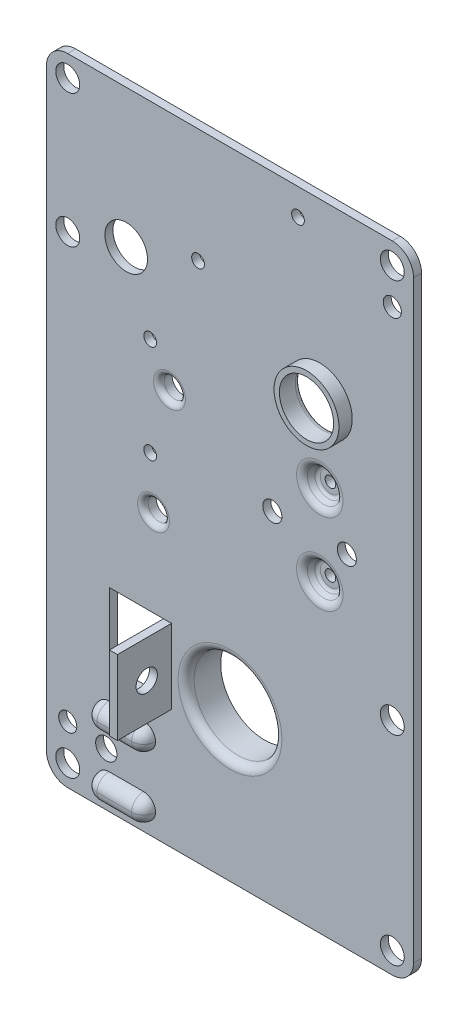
ISO-10303-21;
HEADER;
FILE_DESCRIPTION(('STEP AP214'),'2;1');
FILE_NAME('part.step','',(''),(''),'','','');
FILE_SCHEMA(('AUTOMOTIVE_DESIGN { 1 0 10303 214 1 1 1 1 }'));
ENDSEC;
DATA;
#1=APPLICATION_CONTEXT('core data for automotive mechanical design processes');
#2=APPLICATION_PROTOCOL_DEFINITION('international standard','automotive_design',2000,#1);
#3=PRODUCT_CONTEXT('',#1,'mechanical');
#4=PRODUCT('Part','Part','',(#3));
#5=PRODUCT_RELATED_PRODUCT_CATEGORY('part','',(#4));
#6=PRODUCT_DEFINITION_FORMATION('','',#4);
#7=PRODUCT_DEFINITION_CONTEXT('part definition',#1,'design');
#8=PRODUCT_DEFINITION('design','',#6,#7);
#9=PRODUCT_DEFINITION_SHAPE('','',#8);
#10=(LENGTH_UNIT() NAMED_UNIT(*) SI_UNIT(.MILLI.,.METRE.));
#11=(NAMED_UNIT(*) PLANE_ANGLE_UNIT() SI_UNIT($,.RADIAN.));
#12=(NAMED_UNIT(*) SI_UNIT($,.STERADIAN.) SOLID_ANGLE_UNIT());
#13=UNCERTAINTY_MEASURE_WITH_UNIT(LENGTH_MEASURE(1.E-05),#10,'distance_accuracy_value','');
#14=(GEOMETRIC_REPRESENTATION_CONTEXT(3) GLOBAL_UNCERTAINTY_ASSIGNED_CONTEXT((#13)) GLOBAL_UNIT_ASSIGNED_CONTEXT((#10,
#11,#12)) REPRESENTATION_CONTEXT('',''));
#15=CARTESIAN_POINT('',(0.,0.,0.));
#16=DIRECTION('',(0.,0.,1.));
#17=DIRECTION('',(1.,0.,0.));
#18=AXIS2_PLACEMENT_3D('',#15,#16,#17);
#19=CARTESIAN_POINT('',(30.501199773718,55.7511997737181,30.8));
#20=DIRECTION('',(0.,0.,1.));
#21=DIRECTION('',(1.,0.,0.));
#22=AXIS2_PLACEMENT_3D('',#19,#20,#21);
#23=PLANE('',#22);
#24=CARTESIAN_POINT('',(12.77746533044,54.7541746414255,30.8));
#25=DIRECTION('',(0.,0.,1.));
#26=DIRECTION('',(1.,0.,0.));
#27=AXIS2_PLACEMENT_3D('',#24,#25,#26);
#28=CIRCLE('',#27,1.20000000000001);
#29=CARTESIAN_POINT('',(13.97746533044,54.7541746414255,30.8));
#30=VERTEX_POINT('',#29);
#31=EDGE_CURVE('E900',#30,#30,#28,.T.);
#32=ORIENTED_EDGE('',*,*,#31,.F.);
#33=EDGE_LOOP('',(#32));
#34=FACE_BOUND('',#33,.T.);
#35=CARTESIAN_POINT('',(-6.00417464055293,38.2541746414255,30.8));
#36=DIRECTION('',(0.,0.,1.));
#37=DIRECTION('',(1.,0.,0.));
#38=AXIS2_PLACEMENT_3D('',#35,#36,#37);
#39=CIRCLE('',#38,1.2);
#40=CARTESIAN_POINT('',(-4.80417464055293,38.2541746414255,30.8));
#41=VERTEX_POINT('',#40);
#42=EDGE_CURVE('E897',#41,#41,#39,.T.);
#43=ORIENTED_EDGE('',*,*,#42,.F.);
#44=EDGE_LOOP('',(#43));
#45=FACE_BOUND('',#44,.T.);
#46=CARTESIAN_POINT('',(16.8749999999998,26.9783573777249,30.8));
#47=DIRECTION('',(0.,0.,1.));
#48=DIRECTION('',(1.,0.,0.));
#49=AXIS2_PLACEMENT_3D('',#46,#47,#48);
#50=CIRCLE('',#49,6.0999999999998);
#51=CARTESIAN_POINT('',(22.9749999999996,26.9783573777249,30.8));
#52=VERTEX_POINT('',#51);
#53=EDGE_CURVE('E886',#52,#52,#50,.T.);
#54=ORIENTED_EDGE('',*,*,#53,.F.);
#55=EDGE_LOOP('',(#54));
#56=FACE_BOUND('',#55,.T.);
#57=DIRECTION('',(1.,0.,0.));
#58=VECTOR('',#57,1.);
#59=CARTESIAN_POINT('',(-12.504174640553,-37.2541746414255,30.8));
#60=LINE('',#59,#58);
#61=CARTESIAN_POINT('',(-22.654174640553,-37.2541746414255,30.8));
#62=VERTEX_POINT('',#61);
#63=CARTESIAN_POINT('',(-12.504174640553,-37.2541746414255,30.8));
#64=VERTEX_POINT('',#63);
#65=EDGE_CURVE('E1906',#62,#64,#60,.T.);
#66=ORIENTED_EDGE('',*,*,#65,.F.);
#67=DIRECTION('',(0.,-1.,0.));
#68=VECTOR('',#67,1.);
#69=CARTESIAN_POINT('',(-22.654174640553,-23.2541746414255,30.8));
#70=LINE('',#69,#68);
#71=CARTESIAN_POINT('',(-22.654174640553,-23.2541746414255,30.8));
#72=VERTEX_POINT('',#71);
#73=EDGE_CURVE('E1903',#72,#62,#70,.T.);
#74=ORIENTED_EDGE('',*,*,#73,.F.);
#75=DIRECTION('',(-1.,0.,0.));
#76=VECTOR('',#75,1.);
#77=CARTESIAN_POINT('',(-12.504174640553,-23.2541746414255,30.8));
#78=LINE('',#77,#76);
#79=CARTESIAN_POINT('',(-12.504174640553,-23.2541746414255,30.8));
#80=VERTEX_POINT('',#79);
#81=EDGE_CURVE('E1900',#80,#72,#78,.T.);
#82=ORIENTED_EDGE('',*,*,#81,.F.);
#83=DIRECTION('',(-1.,0.,0.));
#84=VECTOR('',#83,1.);
#85=CARTESIAN_POINT('',(-12.504174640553,-23.2541746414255,30.8));
#86=LINE('',#85,#84);
#87=CARTESIAN_POINT('',(-11.004174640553,-23.2541746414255,30.8));
#88=VERTEX_POINT('',#87);
#89=EDGE_CURVE('E1927',#88,#80,#86,.T.);
#90=ORIENTED_EDGE('',*,*,#89,.F.);
#91=DIRECTION('',(0.,1.,0.));
#92=VECTOR('',#91,1.);
#93=CARTESIAN_POINT('',(-11.004174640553,-23.2541746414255,30.8));
#94=LINE('',#93,#92);
#95=CARTESIAN_POINT('',(-11.004174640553,-37.2541746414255,30.8));
#96=VERTEX_POINT('',#95);
#97=EDGE_CURVE('E1924',#96,#88,#94,.T.);
#98=ORIENTED_EDGE('',*,*,#97,.F.);
#99=DIRECTION('',(1.,0.,0.));
#100=VECTOR('',#99,1.);
#101=CARTESIAN_POINT('',(-12.504174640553,-37.2541746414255,30.8));
#102=LINE('',#101,#100);
#103=EDGE_CURVE('E1922',#64,#96,#102,.T.);
#104=ORIENTED_EDGE('',*,*,#103,.F.);
#105=EDGE_LOOP('',(#66,#74,#82,#90,#98,#104));
#106=FACE_BOUND('',#105,.T.);
#107=CARTESIAN_POINT('',(-22.7541746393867,-55.5041746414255,30.8));
#108=DIRECTION('',(0.,0.,1.));
#109=DIRECTION('',(1.,0.,0.));
#110=AXIS2_PLACEMENT_3D('',#107,#108,#109);
#111=CIRCLE('',#110,2.25);
#112=CARTESIAN_POINT('',(-22.7541746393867,-57.7541746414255,30.8));
#113=VERTEX_POINT('',#112);
#114=CARTESIAN_POINT('',(-25.0041746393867,-55.5041746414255,30.8));
#115=VERTEX_POINT('',#114);
#116=EDGE_CURVE('E748',#113,#115,#111,.F.);
#117=ORIENTED_EDGE('',*,*,#116,.T.);
#118=CARTESIAN_POINT('',(-22.7541746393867,-55.5041746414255,30.8));
#119=DIRECTION('',(0.,0.,1.));
#120=DIRECTION('',(1.,0.,0.));
#121=AXIS2_PLACEMENT_3D('',#118,#119,#120);
#122=CIRCLE('',#121,2.25);
#123=CARTESIAN_POINT('',(-22.7541746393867,-53.2541746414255,30.8));
#124=VERTEX_POINT('',#123);
#125=EDGE_CURVE('E750',#115,#124,#122,.F.);
#126=ORIENTED_EDGE('',*,*,#125,.T.);
#127=DIRECTION('',(-1.,0.,0.));
#128=VECTOR('',#127,1.);
#129=CARTESIAN_POINT('',(-25.0041746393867,-53.2541746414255,30.8));
#130=LINE('',#129,#128);
#131=CARTESIAN_POINT('',(-16.25,-53.2541746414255,30.8));
#132=VERTEX_POINT('',#131);
#133=EDGE_CURVE('E477',#132,#124,#130,.T.);
#134=ORIENTED_EDGE('',*,*,#133,.F.);
#135=CARTESIAN_POINT('',(-16.25,-55.5041746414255,30.8));
#136=DIRECTION('',(0.,0.,1.));
#137=DIRECTION('',(1.,0.,0.));
#138=AXIS2_PLACEMENT_3D('',#135,#136,#137);
#139=CIRCLE('',#138,2.25);
#140=CARTESIAN_POINT('',(-14.,-55.5041746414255,30.8));
#141=VERTEX_POINT('',#140);
#142=EDGE_CURVE('E754',#132,#141,#139,.F.);
#143=ORIENTED_EDGE('',*,*,#142,.T.);
#144=CARTESIAN_POINT('',(-16.25,-55.5041746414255,30.8));
#145=DIRECTION('',(0.,0.,1.));
#146=DIRECTION('',(1.,0.,0.));
#147=AXIS2_PLACEMENT_3D('',#144,#145,#146);
#148=CIRCLE('',#147,2.25);
#149=CARTESIAN_POINT('',(-16.25,-57.7541746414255,30.8));
#150=VERTEX_POINT('',#149);
#151=EDGE_CURVE('E752',#141,#150,#148,.F.);
#152=ORIENTED_EDGE('',*,*,#151,.T.);
#153=DIRECTION('',(1.,0.,0.));
#154=VECTOR('',#153,1.);
#155=CARTESIAN_POINT('',(-25.0041746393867,-57.7541746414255,30.8));
#156=LINE('',#155,#154);
#157=EDGE_CURVE('E474',#113,#150,#156,.T.);
#158=ORIENTED_EDGE('',*,*,#157,.F.);
#159=EDGE_LOOP('',(#117,#126,#134,#143,#152,#158));
#160=FACE_BOUND('',#159,.T.);
#161=CARTESIAN_POINT('',(30.501199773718,55.7511997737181,30.8));
#162=DIRECTION('',(0.,0.,1.));
#163=DIRECTION('',(1.,0.,0.));
#164=AXIS2_PLACEMENT_3D('',#161,#162,#163);
#165=CIRCLE('',#164,3.99999999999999);
#166=CARTESIAN_POINT('',(34.501199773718,55.7511997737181,30.8));
#167=VERTEX_POINT('',#166);
#168=CARTESIAN_POINT('',(30.501199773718,59.7511997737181,30.8));
#169=VERTEX_POINT('',#168);
#170=EDGE_CURVE('E607',#167,#169,#165,.T.);
#171=ORIENTED_EDGE('',*,*,#170,.T.);
#172=DIRECTION('',(-1.,0.,0.));
#173=VECTOR('',#172,1.);
#174=CARTESIAN_POINT('',(30.501199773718,59.7511997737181,30.8));
#175=LINE('',#174,#173);
#176=CARTESIAN_POINT('',(-30.501199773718,59.7511997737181,30.8));
#177=VERTEX_POINT('',#176);
#178=EDGE_CURVE('E610',#169,#177,#175,.T.);
#179=ORIENTED_EDGE('',*,*,#178,.T.);
#180=CARTESIAN_POINT('',(-30.501199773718,55.7511997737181,30.8));
#181=DIRECTION('',(0.,0.,1.));
#182=DIRECTION('',(1.,0.,0.));
#183=AXIS2_PLACEMENT_3D('',#180,#181,#182);
#184=CIRCLE('',#183,4.);
#185=CARTESIAN_POINT('',(-34.501199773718,55.7511997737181,30.8));
#186=VERTEX_POINT('',#185);
#187=EDGE_CURVE('E612',#177,#186,#184,.T.);
#188=ORIENTED_EDGE('',*,*,#187,.T.);
#189=DIRECTION('',(0.,-1.,0.));
#190=VECTOR('',#189,1.);
#191=CARTESIAN_POINT('',(-34.501199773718,-55.7511997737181,30.8));
#192=LINE('',#191,#190);
#193=CARTESIAN_POINT('',(-34.501199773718,-55.7511997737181,30.8));
#194=VERTEX_POINT('',#193);
#195=EDGE_CURVE('E614',#186,#194,#192,.T.);
#196=ORIENTED_EDGE('',*,*,#195,.T.);
#197=CARTESIAN_POINT('',(-30.501199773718,-55.7511997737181,30.8));
#198=DIRECTION('',(0.,0.,1.));
#199=DIRECTION('',(1.,0.,0.));
#200=AXIS2_PLACEMENT_3D('',#197,#198,#199);
#201=CIRCLE('',#200,4.00000000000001);
#202=CARTESIAN_POINT('',(-30.501199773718,-59.7511997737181,30.8));
#203=VERTEX_POINT('',#202);
#204=EDGE_CURVE('E616',#194,#203,#201,.T.);
#205=ORIENTED_EDGE('',*,*,#204,.T.);
#206=DIRECTION('',(1.,0.,0.));
#207=VECTOR('',#206,1.);
#208=CARTESIAN_POINT('',(30.501199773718,-59.7511997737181,30.8));
#209=LINE('',#208,#207);
#210=CARTESIAN_POINT('',(30.501199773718,-59.7511997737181,30.8));
#211=VERTEX_POINT('',#210);
#212=EDGE_CURVE('E618',#203,#211,#209,.T.);
#213=ORIENTED_EDGE('',*,*,#212,.T.);
#214=CARTESIAN_POINT('',(30.501199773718,-55.7511997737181,30.8));
#215=DIRECTION('',(0.,0.,1.));
#216=DIRECTION('',(1.,0.,0.));
#217=AXIS2_PLACEMENT_3D('',#214,#215,#216);
#218=CIRCLE('',#217,4.);
#219=CARTESIAN_POINT('',(34.501199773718,-55.7511997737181,30.8));
#220=VERTEX_POINT('',#219);
#221=EDGE_CURVE('E620',#211,#220,#218,.T.);
#222=ORIENTED_EDGE('',*,*,#221,.T.);
#223=DIRECTION('',(0.,1.,0.));
#224=VECTOR('',#223,1.);
#225=CARTESIAN_POINT('',(34.501199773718,55.7511997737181,30.8));
#226=LINE('',#225,#224);
#227=EDGE_CURVE('E622',#220,#167,#226,.T.);
#228=ORIENTED_EDGE('',*,*,#227,.T.);
#229=EDGE_LOOP('',(#171,#179,#188,#196,#205,#213,#222,#228));
#230=FACE_BOUND('',#229,.T.);
#231=CARTESIAN_POINT('',(-14.3749999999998,-6.8517696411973,30.8));
#232=DIRECTION('',(0.,0.,1.));
#233=DIRECTION('',(1.,0.,0.));
#234=AXIS2_PLACEMENT_3D('',#231,#232,#233);
#235=CIRCLE('',#234,3.);
#236=CARTESIAN_POINT('',(-11.3749999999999,-6.8517696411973,30.8));
#237=VERTEX_POINT('',#236);
#238=EDGE_CURVE('E657',#237,#237,#235,.F.);
#239=ORIENTED_EDGE('',*,*,#238,.T.);
#240=EDGE_LOOP('',(#239));
#241=FACE_BOUND('',#240,.T.);
#242=CARTESIAN_POINT('',(-11.3688610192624,14.5380206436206,30.8));
#243=DIRECTION('',(0.,0.,1.));
#244=DIRECTION('',(1.,0.,0.));
#245=AXIS2_PLACEMENT_3D('',#242,#243,#244);
#246=CIRCLE('',#245,2.99999999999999);
#247=CARTESIAN_POINT('',(-8.36886101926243,14.5380206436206,30.8));
#248=VERTEX_POINT('',#247);
#249=EDGE_CURVE('E660',#248,#248,#246,.F.);
#250=ORIENTED_EDGE('',*,*,#249,.T.);
#251=EDGE_LOOP('',(#250));
#252=FACE_BOUND('',#251,.T.);
#253=CARTESIAN_POINT('',(16.875,-2.52164262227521,30.8));
#254=DIRECTION('',(0.,0.,1.));
#255=DIRECTION('',(1.,0.,0.));
#256=AXIS2_PLACEMENT_3D('',#253,#254,#255);
#257=CIRCLE('',#256,4.36602540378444);
#258=CARTESIAN_POINT('',(21.2410254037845,-2.52164262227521,30.8));
#259=VERTEX_POINT('',#258);
#260=EDGE_CURVE('E703',#259,#259,#257,.F.);
#261=ORIENTED_EDGE('',*,*,#260,.T.);
#262=EDGE_LOOP('',(#261));
#263=FACE_BOUND('',#262,.T.);
#264=CARTESIAN_POINT('',(16.875,12.7283573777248,30.8));
#265=DIRECTION('',(0.,0.,1.));
#266=DIRECTION('',(1.,0.,0.));
#267=AXIS2_PLACEMENT_3D('',#264,#265,#266);
#268=CIRCLE('',#267,4.36602540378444);
#269=CARTESIAN_POINT('',(21.2410254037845,12.7283573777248,30.8));
#270=VERTEX_POINT('',#269);
#271=EDGE_CURVE('E706',#270,#270,#268,.F.);
#272=ORIENTED_EDGE('',*,*,#271,.T.);
#273=EDGE_LOOP('',(#272));
#274=FACE_BOUND('',#273,.T.);
#275=CARTESIAN_POINT('',(30.501199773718,55.7511997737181,30.8));
#276=DIRECTION('',(0.,0.,1.));
#277=DIRECTION('',(1.,0.,0.));
#278=AXIS2_PLACEMENT_3D('',#275,#276,#277);
#279=CIRCLE('',#278,2.25000000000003);
#280=CARTESIAN_POINT('',(32.7511997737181,55.7511997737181,30.8));
#281=VERTEX_POINT('',#280);
#282=EDGE_CURVE('E564',#281,#281,#279,.T.);
#283=ORIENTED_EDGE('',*,*,#282,.F.);
#284=EDGE_LOOP('',(#283));
#285=FACE_BOUND('',#284,.T.);
#286=CARTESIAN_POINT('',(30.5,49.0000000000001,30.8));
#287=DIRECTION('',(0.,0.,1.));
#288=DIRECTION('',(1.,0.,0.));
#289=AXIS2_PLACEMENT_3D('',#286,#287,#288);
#290=CIRCLE('',#289,1.7);
#291=CARTESIAN_POINT('',(32.2,49.0000000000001,30.8));
#292=VERTEX_POINT('',#291);
#293=EDGE_CURVE('E558',#292,#292,#290,.T.);
#294=ORIENTED_EDGE('',*,*,#293,.F.);
#295=EDGE_LOOP('',(#294));
#296=FACE_BOUND('',#295,.T.);
#297=CARTESIAN_POINT('',(-30.501199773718,55.7511997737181,30.8));
#298=DIRECTION('',(0.,0.,1.));
#299=DIRECTION('',(1.,0.,0.));
#300=AXIS2_PLACEMENT_3D('',#297,#298,#299);
#301=CIRCLE('',#300,2.25);
#302=CARTESIAN_POINT('',(-28.251199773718,55.7511997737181,30.8));
#303=VERTEX_POINT('',#302);
#304=EDGE_CURVE('E552',#303,#303,#301,.T.);
#305=ORIENTED_EDGE('',*,*,#304,.F.);
#306=EDGE_LOOP('',(#305));
#307=FACE_BOUND('',#306,.T.);
#308=CARTESIAN_POINT('',(-30.501199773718,30.748800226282,30.8));
#309=DIRECTION('',(0.,0.,1.));
#310=DIRECTION('',(1.,0.,0.));
#311=AXIS2_PLACEMENT_3D('',#308,#309,#310);
#312=CIRCLE('',#311,2.25);
#313=CARTESIAN_POINT('',(-28.251199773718,30.748800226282,30.8));
#314=VERTEX_POINT('',#313);
#315=EDGE_CURVE('E546',#314,#314,#312,.T.);
#316=ORIENTED_EDGE('',*,*,#315,.F.);
#317=EDGE_LOOP('',(#316));
#318=FACE_BOUND('',#317,.T.);
#319=CARTESIAN_POINT('',(-30.5,-49.0000000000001,30.8));
#320=DIRECTION('',(0.,0.,1.));
#321=DIRECTION('',(1.,0.,0.));
#322=AXIS2_PLACEMENT_3D('',#319,#320,#321);
#323=CIRCLE('',#322,1.7);
#324=CARTESIAN_POINT('',(-28.8,-49.0000000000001,30.8));
#325=VERTEX_POINT('',#324);
#326=EDGE_CURVE('E540',#325,#325,#323,.T.);
#327=ORIENTED_EDGE('',*,*,#326,.F.);
#328=EDGE_LOOP('',(#327));
#329=FACE_BOUND('',#328,.T.);
#330=CARTESIAN_POINT('',(-30.501199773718,-55.7511997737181,30.8));
#331=DIRECTION('',(0.,0.,1.));
#332=DIRECTION('',(1.,0.,0.));
#333=AXIS2_PLACEMENT_3D('',#330,#331,#332);
#334=CIRCLE('',#333,2.25);
#335=CARTESIAN_POINT('',(-28.251199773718,-55.7511997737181,30.8));
#336=VERTEX_POINT('',#335);
#337=EDGE_CURVE('E534',#336,#336,#334,.T.);
#338=ORIENTED_EDGE('',*,*,#337,.F.);
#339=EDGE_LOOP('',(#338));
#340=FACE_BOUND('',#339,.T.);
#341=CARTESIAN_POINT('',(30.501199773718,-18.251199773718,30.8));
#342=DIRECTION('',(0.,0.,1.));
#343=DIRECTION('',(1.,0.,0.));
#344=AXIS2_PLACEMENT_3D('',#341,#342,#343);
#345=CIRCLE('',#344,2.24999999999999);
#346=CARTESIAN_POINT('',(32.751199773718,-18.251199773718,30.8));
#347=VERTEX_POINT('',#346);
#348=EDGE_CURVE('E528',#347,#347,#345,.T.);
#349=ORIENTED_EDGE('',*,*,#348,.F.);
#350=EDGE_LOOP('',(#349));
#351=FACE_BOUND('',#350,.T.);
#352=CARTESIAN_POINT('',(30.501199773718,-55.7511997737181,30.8));
#353=DIRECTION('',(0.,0.,1.));
#354=DIRECTION('',(1.,0.,0.));
#355=AXIS2_PLACEMENT_3D('',#352,#353,#354);
#356=CIRCLE('',#355,2.25000000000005);
#357=CARTESIAN_POINT('',(32.7511997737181,-55.7511997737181,30.8));
#358=VERTEX_POINT('',#357);
#359=EDGE_CURVE('E522',#358,#358,#356,.T.);
#360=ORIENTED_EDGE('',*,*,#359,.F.);
#361=EDGE_LOOP('',(#360));
#362=FACE_BOUND('',#361,.T.);
#363=CARTESIAN_POINT('',(-19.5041746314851,33.7541746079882,30.8));
#364=DIRECTION('',(0.,0.,1.));
#365=DIRECTION('',(1.,0.,0.));
#366=AXIS2_PLACEMENT_3D('',#363,#364,#365);
#367=CIRCLE('',#366,4.);
#368=CARTESIAN_POINT('',(-15.5041746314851,33.7541746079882,30.8));
#369=VERTEX_POINT('',#368);
#370=EDGE_CURVE('E516',#369,#369,#367,.T.);
#371=ORIENTED_EDGE('',*,*,#370,.F.);
#372=EDGE_LOOP('',(#371));
#373=FACE_BOUND('',#372,.T.);
#374=CARTESIAN_POINT('',(-15.0041746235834,21.0041746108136,30.8));
#375=DIRECTION('',(0.,0.,1.));
#376=DIRECTION('',(1.,0.,0.));
#377=AXIS2_PLACEMENT_3D('',#374,#375,#376);
#378=CIRCLE('',#377,1.2);
#379=CARTESIAN_POINT('',(-13.8041746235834,21.0041746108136,30.8));
#380=VERTEX_POINT('',#379);
#381=EDGE_CURVE('E510',#380,#380,#378,.T.);
#382=ORIENTED_EDGE('',*,*,#381,.F.);
#383=EDGE_LOOP('',(#382));
#384=FACE_BOUND('',#383,.T.);
#385=CARTESIAN_POINT('',(-15.0041746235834,2.50417461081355,30.8));
#386=DIRECTION('',(0.,0.,1.));
#387=DIRECTION('',(1.,0.,0.));
#388=AXIS2_PLACEMENT_3D('',#385,#386,#387);
#389=CIRCLE('',#388,1.2);
#390=CARTESIAN_POINT('',(-13.8041746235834,2.50417461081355,30.8));
#391=VERTEX_POINT('',#390);
#392=EDGE_CURVE('E504',#391,#391,#389,.T.);
#393=ORIENTED_EDGE('',*,*,#392,.F.);
#394=EDGE_LOOP('',(#393));
#395=FACE_BOUND('',#394,.T.);
#396=CARTESIAN_POINT('',(21.954174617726,4.47835737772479,30.8));
#397=DIRECTION('',(0.,0.,1.));
#398=DIRECTION('',(1.,0.,0.));
#399=AXIS2_PLACEMENT_3D('',#396,#397,#398);
#400=CIRCLE('',#399,1.8);
#401=CARTESIAN_POINT('',(23.754174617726,4.47835737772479,30.8));
#402=VERTEX_POINT('',#401);
#403=EDGE_CURVE('E498',#402,#402,#400,.T.);
#404=ORIENTED_EDGE('',*,*,#403,.F.);
#405=EDGE_LOOP('',(#404));
#406=FACE_BOUND('',#405,.T.);
#407=CARTESIAN_POINT('',(7.954174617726,4.47835737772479,30.8));
#408=DIRECTION('',(0.,0.,1.));
#409=DIRECTION('',(1.,0.,0.));
#410=AXIS2_PLACEMENT_3D('',#407,#408,#409);
#411=CIRCLE('',#410,1.8);
#412=CARTESIAN_POINT('',(9.754174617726,4.47835737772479,30.8));
#413=VERTEX_POINT('',#412);
#414=EDGE_CURVE('E492',#413,#413,#411,.T.);
#415=ORIENTED_EDGE('',*,*,#414,.F.);
#416=EDGE_LOOP('',(#415));
#417=FACE_BOUND('',#416,.T.);
#418=CARTESIAN_POINT('',(-23.2541746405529,-49.7541746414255,30.8));
#419=DIRECTION('',(0.,0.,1.));
#420=DIRECTION('',(1.,0.,0.));
#421=AXIS2_PLACEMENT_3D('',#418,#419,#420);
#422=CIRCLE('',#421,2.00000000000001);
#423=CARTESIAN_POINT('',(-21.2541746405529,-49.7541746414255,30.8));
#424=VERTEX_POINT('',#423);
#425=EDGE_CURVE('E486',#424,#424,#422,.T.);
#426=ORIENTED_EDGE('',*,*,#425,.F.);
#427=EDGE_LOOP('',(#426));
#428=FACE_BOUND('',#427,.T.);
#429=CARTESIAN_POINT('',(-16.25,-44.0041746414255,30.8));
#430=DIRECTION('',(0.,0.,1.));
#431=DIRECTION('',(1.,0.,0.));
#432=AXIS2_PLACEMENT_3D('',#429,#430,#431);
#433=CIRCLE('',#432,2.25);
#434=CARTESIAN_POINT('',(-16.25,-41.7541746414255,30.8));
#435=VERTEX_POINT('',#434);
#436=CARTESIAN_POINT('',(-14.,-44.0041746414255,30.8));
#437=VERTEX_POINT('',#436);
#438=EDGE_CURVE('E756',#435,#437,#433,.F.);
#439=ORIENTED_EDGE('',*,*,#438,.T.);
#440=CARTESIAN_POINT('',(-16.25,-44.0041746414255,30.8));
#441=DIRECTION('',(0.,0.,1.));
#442=DIRECTION('',(1.,0.,0.));
#443=AXIS2_PLACEMENT_3D('',#440,#441,#442);
#444=CIRCLE('',#443,2.25);
#445=CARTESIAN_POINT('',(-16.25,-46.2541746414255,30.8));
#446=VERTEX_POINT('',#445);
#447=EDGE_CURVE('E758',#437,#446,#444,.F.);
#448=ORIENTED_EDGE('',*,*,#447,.T.);
#449=DIRECTION('',(1.,0.,0.));
#450=VECTOR('',#449,1.);
#451=CARTESIAN_POINT('',(-14.,-46.2541746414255,30.8));
#452=LINE('',#451,#450);
#453=CARTESIAN_POINT('',(-22.7541746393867,-46.2541746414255,30.8));
#454=VERTEX_POINT('',#453);
#455=EDGE_CURVE('E483',#454,#446,#452,.T.);
#456=ORIENTED_EDGE('',*,*,#455,.F.);
#457=CARTESIAN_POINT('',(-22.7541746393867,-44.0041746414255,30.8));
#458=DIRECTION('',(0.,0.,1.));
#459=DIRECTION('',(1.,0.,0.));
#460=AXIS2_PLACEMENT_3D('',#457,#458,#459);
#461=CIRCLE('',#460,2.25);
#462=CARTESIAN_POINT('',(-25.0041746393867,-44.0041746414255,30.8));
#463=VERTEX_POINT('',#462);
#464=EDGE_CURVE('E744',#454,#463,#461,.F.);
#465=ORIENTED_EDGE('',*,*,#464,.T.);
#466=CARTESIAN_POINT('',(-22.7541746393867,-44.0041746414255,30.8));
#467=DIRECTION('',(0.,0.,1.));
#468=DIRECTION('',(1.,0.,0.));
#469=AXIS2_PLACEMENT_3D('',#466,#467,#468);
#470=CIRCLE('',#469,2.25);
#471=CARTESIAN_POINT('',(-22.7541746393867,-41.7541746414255,30.8));
#472=VERTEX_POINT('',#471);
#473=EDGE_CURVE('E746',#463,#472,#470,.F.);
#474=ORIENTED_EDGE('',*,*,#473,.T.);
#475=DIRECTION('',(-1.,0.,0.));
#476=VECTOR('',#475,1.);
#477=CARTESIAN_POINT('',(-14.,-41.7541746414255,30.8));
#478=LINE('',#477,#476);
#479=EDGE_CURVE('E480',#435,#472,#478,.T.);
#480=ORIENTED_EDGE('',*,*,#479,.F.);
#481=EDGE_LOOP('',(#439,#448,#456,#465,#474,#480));
#482=FACE_BOUND('',#481,.T.);
#483=CARTESIAN_POINT('',(0.,-31.75,30.8));
#484=DIRECTION('',(0.,0.,1.));
#485=DIRECTION('',(1.,0.,0.));
#486=AXIS2_PLACEMENT_3D('',#483,#484,#485);
#487=CIRCLE('',#486,9.75);
#488=CARTESIAN_POINT('',(9.75000000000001,-31.75,30.8));
#489=VERTEX_POINT('',#488);
#490=EDGE_CURVE('E866',#489,#489,#487,.F.);
#491=ORIENTED_EDGE('',*,*,#490,.T.);
#492=EDGE_LOOP('',(#491));
#493=FACE_BOUND('',#492,.T.);
#494=ADVANCED_FACE('F29',(#34,#45,#56,#106,#160,#230,#241,#252,#263,#274,#285,#296,#307,#318,
#329,#340,#351,#362,#373,#384,#395,#406,#417,#428,#482,#493),#23,.T.);
#495=CARTESIAN_POINT('',(30.501199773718,55.7511997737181,29.3));
#496=DIRECTION('',(0.,0.,1.));
#497=DIRECTION('',(1.,0.,0.));
#498=AXIS2_PLACEMENT_3D('',#495,#496,#497);
#499=PLANE('',#498);
#500=CARTESIAN_POINT('',(12.77746533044,54.7541746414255,29.3));
#501=DIRECTION('',(0.,0.,1.));
#502=DIRECTION('',(1.,0.,0.));
#503=AXIS2_PLACEMENT_3D('',#500,#501,#502);
#504=CIRCLE('',#503,1.20000000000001);
#505=CARTESIAN_POINT('',(13.97746533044,54.7541746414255,29.3));
#506=VERTEX_POINT('',#505);
#507=EDGE_CURVE('E898',#506,#506,#504,.T.);
#508=ORIENTED_EDGE('',*,*,#507,.T.);
#509=EDGE_LOOP('',(#508));
#510=FACE_BOUND('',#509,.T.);
#511=CARTESIAN_POINT('',(-6.00417464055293,38.2541746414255,29.3));
#512=DIRECTION('',(0.,0.,1.));
#513=DIRECTION('',(1.,0.,0.));
#514=AXIS2_PLACEMENT_3D('',#511,#512,#513);
#515=CIRCLE('',#514,1.2);
#516=CARTESIAN_POINT('',(-4.80417464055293,38.2541746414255,29.3));
#517=VERTEX_POINT('',#516);
#518=EDGE_CURVE('E893',#517,#517,#515,.T.);
#519=ORIENTED_EDGE('',*,*,#518,.T.);
#520=EDGE_LOOP('',(#519));
#521=FACE_BOUND('',#520,.T.);
#522=CARTESIAN_POINT('',(16.8749999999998,26.9783573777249,29.3));
#523=DIRECTION('',(0.,0.,1.));
#524=DIRECTION('',(1.,0.,0.));
#525=AXIS2_PLACEMENT_3D('',#522,#523,#524);
#526=CIRCLE('',#525,6.1);
#527=CARTESIAN_POINT('',(22.9749999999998,26.9783573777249,29.3));
#528=VERTEX_POINT('',#527);
#529=EDGE_CURVE('E887',#528,#528,#526,.T.);
#530=ORIENTED_EDGE('',*,*,#529,.T.);
#531=EDGE_LOOP('',(#530));
#532=FACE_BOUND('',#531,.T.);
#533=DIRECTION('',(0.,1.,0.));
#534=VECTOR('',#533,1.);
#535=CARTESIAN_POINT('',(-11.504174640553,55.7511997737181,29.3));
#536=LINE('',#535,#534);
#537=CARTESIAN_POINT('',(-11.504174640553,-37.2541746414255,29.3));
#538=VERTEX_POINT('',#537);
#539=CARTESIAN_POINT('',(-11.504174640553,-23.2541746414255,29.3));
#540=VERTEX_POINT('',#539);
#541=EDGE_CURVE('E877',#538,#540,#536,.T.);
#542=ORIENTED_EDGE('',*,*,#541,.T.);
#543=DIRECTION('',(-1.,0.,0.));
#544=VECTOR('',#543,1.);
#545=CARTESIAN_POINT('',(30.501199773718,-23.2541746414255,29.3));
#546=LINE('',#545,#544);
#547=CARTESIAN_POINT('',(-22.654174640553,-23.2541746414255,29.3));
#548=VERTEX_POINT('',#547);
#549=EDGE_CURVE('E1912',#540,#548,#546,.T.);
#550=ORIENTED_EDGE('',*,*,#549,.T.);
#551=DIRECTION('',(0.,-1.,0.));
#552=VECTOR('',#551,1.);
#553=CARTESIAN_POINT('',(-22.654174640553,55.7511997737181,29.3));
#554=LINE('',#553,#552);
#555=CARTESIAN_POINT('',(-22.654174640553,-37.2541746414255,29.3));
#556=VERTEX_POINT('',#555);
#557=EDGE_CURVE('E874',#548,#556,#554,.T.);
#558=ORIENTED_EDGE('',*,*,#557,.T.);
#559=DIRECTION('',(1.,0.,0.));
#560=VECTOR('',#559,1.);
#561=CARTESIAN_POINT('',(30.5011997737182,-37.2541746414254,29.3));
#562=LINE('',#561,#560);
#563=EDGE_CURVE('E1920',#556,#538,#562,.T.);
#564=ORIENTED_EDGE('',*,*,#563,.T.);
#565=EDGE_LOOP('',(#542,#550,#558,#564));
#566=FACE_BOUND('',#565,.T.);
#567=CARTESIAN_POINT('',(16.875,-2.52164262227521,29.3));
#568=DIRECTION('',(0.,0.,1.));
#569=DIRECTION('',(1.,0.,0.));
#570=AXIS2_PLACEMENT_3D('',#567,#568,#569);
#571=CIRCLE('',#570,4.);
#572=CARTESIAN_POINT('',(20.875,-2.52164262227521,29.3));
#573=VERTEX_POINT('',#572);
#574=EDGE_CURVE('E669',#573,#573,#571,.F.);
#575=ORIENTED_EDGE('',*,*,#574,.F.);
#576=EDGE_LOOP('',(#575));
#577=FACE_BOUND('',#576,.T.);
#578=CARTESIAN_POINT('',(-14.3749999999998,-6.8517696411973,29.3));
#579=DIRECTION('',(0.,0.,1.));
#580=DIRECTION('',(1.,0.,0.));
#581=AXIS2_PLACEMENT_3D('',#578,#579,#580);
#582=CIRCLE('',#581,3.);
#583=CARTESIAN_POINT('',(-11.3749999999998,-6.8517696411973,29.3));
#584=VERTEX_POINT('',#583);
#585=EDGE_CURVE('E651',#584,#584,#582,.F.);
#586=ORIENTED_EDGE('',*,*,#585,.F.);
#587=EDGE_LOOP('',(#586));
#588=FACE_BOUND('',#587,.T.);
#589=CARTESIAN_POINT('',(30.501199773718,55.7511997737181,29.3));
#590=DIRECTION('',(0.,0.,1.));
#591=DIRECTION('',(1.,0.,0.));
#592=AXIS2_PLACEMENT_3D('',#589,#590,#591);
#593=CIRCLE('',#592,3.99999999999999);
#594=CARTESIAN_POINT('',(34.501199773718,55.7511997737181,29.3));
#595=VERTEX_POINT('',#594);
#596=CARTESIAN_POINT('',(30.501199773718,59.7511997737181,29.3));
#597=VERTEX_POINT('',#596);
#598=EDGE_CURVE('E590',#595,#597,#593,.T.);
#599=ORIENTED_EDGE('',*,*,#598,.F.);
#600=DIRECTION('',(0.,1.,0.));
#601=VECTOR('',#600,1.);
#602=CARTESIAN_POINT('',(34.501199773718,55.7511997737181,29.3));
#603=LINE('',#602,#601);
#604=CARTESIAN_POINT('',(34.501199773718,-55.7511997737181,29.3));
#605=VERTEX_POINT('',#604);
#606=EDGE_CURVE('E605',#605,#595,#603,.T.);
#607=ORIENTED_EDGE('',*,*,#606,.F.);
#608=CARTESIAN_POINT('',(30.501199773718,-55.7511997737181,29.3));
#609=DIRECTION('',(0.,0.,1.));
#610=DIRECTION('',(1.,0.,0.));
#611=AXIS2_PLACEMENT_3D('',#608,#609,#610);
#612=CIRCLE('',#611,4.);
#613=CARTESIAN_POINT('',(30.501199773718,-59.7511997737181,29.3));
#614=VERTEX_POINT('',#613);
#615=EDGE_CURVE('E603',#614,#605,#612,.T.);
#616=ORIENTED_EDGE('',*,*,#615,.F.);
#617=DIRECTION('',(1.,0.,0.));
#618=VECTOR('',#617,1.);
#619=CARTESIAN_POINT('',(30.501199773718,-59.7511997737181,29.3));
#620=LINE('',#619,#618);
#621=CARTESIAN_POINT('',(-30.501199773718,-59.7511997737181,29.3));
#622=VERTEX_POINT('',#621);
#623=EDGE_CURVE('E601',#622,#614,#620,.T.);
#624=ORIENTED_EDGE('',*,*,#623,.F.);
#625=CARTESIAN_POINT('',(-30.501199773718,-55.7511997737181,29.3));
#626=DIRECTION('',(0.,0.,1.));
#627=DIRECTION('',(1.,0.,0.));
#628=AXIS2_PLACEMENT_3D('',#625,#626,#627);
#629=CIRCLE('',#628,4.00000000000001);
#630=CARTESIAN_POINT('',(-34.501199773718,-55.7511997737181,29.3));
#631=VERTEX_POINT('',#630);
#632=EDGE_CURVE('E599',#631,#622,#629,.T.);
#633=ORIENTED_EDGE('',*,*,#632,.F.);
#634=DIRECTION('',(0.,-1.,0.));
#635=VECTOR('',#634,1.);
#636=CARTESIAN_POINT('',(-34.501199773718,-55.7511997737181,29.3));
#637=LINE('',#636,#635);
#638=CARTESIAN_POINT('',(-34.501199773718,55.7511997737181,29.3));
#639=VERTEX_POINT('',#638);
#640=EDGE_CURVE('E597',#639,#631,#637,.T.);
#641=ORIENTED_EDGE('',*,*,#640,.F.);
#642=CARTESIAN_POINT('',(-30.501199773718,55.7511997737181,29.3));
#643=DIRECTION('',(0.,0.,1.));
#644=DIRECTION('',(1.,0.,0.));
#645=AXIS2_PLACEMENT_3D('',#642,#643,#644);
#646=CIRCLE('',#645,4.);
#647=CARTESIAN_POINT('',(-30.501199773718,59.7511997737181,29.3));
#648=VERTEX_POINT('',#647);
#649=EDGE_CURVE('E595',#648,#639,#646,.T.);
#650=ORIENTED_EDGE('',*,*,#649,.F.);
#651=DIRECTION('',(-1.,0.,0.));
#652=VECTOR('',#651,1.);
#653=CARTESIAN_POINT('',(30.501199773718,59.7511997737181,29.3));
#654=LINE('',#653,#652);
#655=EDGE_CURVE('E593',#597,#648,#654,.T.);
#656=ORIENTED_EDGE('',*,*,#655,.F.);
#657=EDGE_LOOP('',(#599,#607,#616,#624,#633,#641,#650,#656));
#658=FACE_BOUND('',#657,.T.);
#659=CARTESIAN_POINT('',(-11.3688610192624,14.5380206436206,29.3));
#660=DIRECTION('',(0.,0.,1.));
#661=DIRECTION('',(1.,0.,0.));
#662=AXIS2_PLACEMENT_3D('',#659,#660,#661);
#663=CIRCLE('',#662,3.);
#664=CARTESIAN_POINT('',(-8.36886101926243,14.5380206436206,29.3));
#665=VERTEX_POINT('',#664);
#666=EDGE_CURVE('E648',#665,#665,#663,.F.);
#667=ORIENTED_EDGE('',*,*,#666,.F.);
#668=EDGE_LOOP('',(#667));
#669=FACE_BOUND('',#668,.T.);
#670=CARTESIAN_POINT('',(16.875,12.7283573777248,29.3));
#671=DIRECTION('',(0.,0.,1.));
#672=DIRECTION('',(1.,0.,0.));
#673=AXIS2_PLACEMENT_3D('',#670,#671,#672);
#674=CIRCLE('',#673,4.);
#675=CARTESIAN_POINT('',(20.875,12.7283573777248,29.3));
#676=VERTEX_POINT('',#675);
#677=EDGE_CURVE('E666',#676,#676,#674,.F.);
#678=ORIENTED_EDGE('',*,*,#677,.F.);
#679=EDGE_LOOP('',(#678));
#680=FACE_BOUND('',#679,.T.);
#681=CARTESIAN_POINT('',(30.501199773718,55.7511997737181,29.3));
#682=DIRECTION('',(0.,0.,1.));
#683=DIRECTION('',(1.,0.,0.));
#684=AXIS2_PLACEMENT_3D('',#681,#682,#683);
#685=CIRCLE('',#684,2.25000000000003);
#686=CARTESIAN_POINT('',(32.7511997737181,55.7511997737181,29.3));
#687=VERTEX_POINT('',#686);
#688=EDGE_CURVE('E567',#687,#687,#685,.T.);
#689=ORIENTED_EDGE('',*,*,#688,.T.);
#690=EDGE_LOOP('',(#689));
#691=FACE_BOUND('',#690,.T.);
#692=CARTESIAN_POINT('',(30.5,49.0000000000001,29.3));
#693=DIRECTION('',(0.,0.,1.));
#694=DIRECTION('',(1.,0.,0.));
#695=AXIS2_PLACEMENT_3D('',#692,#693,#694);
#696=CIRCLE('',#695,1.7);
#697=CARTESIAN_POINT('',(32.2,49.0000000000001,29.3));
#698=VERTEX_POINT('',#697);
#699=EDGE_CURVE('E561',#698,#698,#696,.T.);
#700=ORIENTED_EDGE('',*,*,#699,.T.);
#701=EDGE_LOOP('',(#700));
#702=FACE_BOUND('',#701,.T.);
#703=CARTESIAN_POINT('',(-30.501199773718,55.7511997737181,29.3));
#704=DIRECTION('',(0.,0.,1.));
#705=DIRECTION('',(1.,0.,0.));
#706=AXIS2_PLACEMENT_3D('',#703,#704,#705);
#707=CIRCLE('',#706,2.25);
#708=CARTESIAN_POINT('',(-28.251199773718,55.7511997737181,29.3));
#709=VERTEX_POINT('',#708);
#710=EDGE_CURVE('E555',#709,#709,#707,.T.);
#711=ORIENTED_EDGE('',*,*,#710,.T.);
#712=EDGE_LOOP('',(#711));
#713=FACE_BOUND('',#712,.T.);
#714=CARTESIAN_POINT('',(-30.501199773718,30.748800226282,29.3));
#715=DIRECTION('',(0.,0.,1.));
#716=DIRECTION('',(1.,0.,0.));
#717=AXIS2_PLACEMENT_3D('',#714,#715,#716);
#718=CIRCLE('',#717,2.25);
#719=CARTESIAN_POINT('',(-28.251199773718,30.748800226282,29.3));
#720=VERTEX_POINT('',#719);
#721=EDGE_CURVE('E549',#720,#720,#718,.T.);
#722=ORIENTED_EDGE('',*,*,#721,.T.);
#723=EDGE_LOOP('',(#722));
#724=FACE_BOUND('',#723,.T.);
#725=CARTESIAN_POINT('',(-30.5,-49.0000000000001,29.3));
#726=DIRECTION('',(0.,0.,1.));
#727=DIRECTION('',(1.,0.,0.));
#728=AXIS2_PLACEMENT_3D('',#725,#726,#727);
#729=CIRCLE('',#728,1.7);
#730=CARTESIAN_POINT('',(-28.8,-49.0000000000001,29.3));
#731=VERTEX_POINT('',#730);
#732=EDGE_CURVE('E543',#731,#731,#729,.T.);
#733=ORIENTED_EDGE('',*,*,#732,.T.);
#734=EDGE_LOOP('',(#733));
#735=FACE_BOUND('',#734,.T.);
#736=CARTESIAN_POINT('',(-30.501199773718,-55.7511997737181,29.3));
#737=DIRECTION('',(0.,0.,1.));
#738=DIRECTION('',(1.,0.,0.));
#739=AXIS2_PLACEMENT_3D('',#736,#737,#738);
#740=CIRCLE('',#739,2.25);
#741=CARTESIAN_POINT('',(-28.251199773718,-55.7511997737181,29.3));
#742=VERTEX_POINT('',#741);
#743=EDGE_CURVE('E537',#742,#742,#740,.T.);
#744=ORIENTED_EDGE('',*,*,#743,.T.);
#745=EDGE_LOOP('',(#744));
#746=FACE_BOUND('',#745,.T.);
#747=CARTESIAN_POINT('',(30.501199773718,-18.251199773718,29.3));
#748=DIRECTION('',(0.,0.,1.));
#749=DIRECTION('',(1.,0.,0.));
#750=AXIS2_PLACEMENT_3D('',#747,#748,#749);
#751=CIRCLE('',#750,2.24999999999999);
#752=CARTESIAN_POINT('',(32.751199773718,-18.251199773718,29.3));
#753=VERTEX_POINT('',#752);
#754=EDGE_CURVE('E531',#753,#753,#751,.T.);
#755=ORIENTED_EDGE('',*,*,#754,.T.);
#756=EDGE_LOOP('',(#755));
#757=FACE_BOUND('',#756,.T.);
#758=CARTESIAN_POINT('',(30.501199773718,-55.7511997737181,29.3));
#759=DIRECTION('',(0.,0.,1.));
#760=DIRECTION('',(1.,0.,0.));
#761=AXIS2_PLACEMENT_3D('',#758,#759,#760);
#762=CIRCLE('',#761,2.25000000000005);
#763=CARTESIAN_POINT('',(32.7511997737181,-55.7511997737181,29.3));
#764=VERTEX_POINT('',#763);
#765=EDGE_CURVE('E525',#764,#764,#762,.T.);
#766=ORIENTED_EDGE('',*,*,#765,.T.);
#767=EDGE_LOOP('',(#766));
#768=FACE_BOUND('',#767,.T.);
#769=CARTESIAN_POINT('',(-19.5041746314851,33.7541746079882,29.3));
#770=DIRECTION('',(0.,0.,1.));
#771=DIRECTION('',(1.,0.,0.));
#772=AXIS2_PLACEMENT_3D('',#769,#770,#771);
#773=CIRCLE('',#772,4.);
#774=CARTESIAN_POINT('',(-15.5041746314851,33.7541746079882,29.3));
#775=VERTEX_POINT('',#774);
#776=EDGE_CURVE('E519',#775,#775,#773,.T.);
#777=ORIENTED_EDGE('',*,*,#776,.T.);
#778=EDGE_LOOP('',(#777));
#779=FACE_BOUND('',#778,.T.);
#780=CARTESIAN_POINT('',(-15.0041746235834,21.0041746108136,29.3));
#781=DIRECTION('',(0.,0.,1.));
#782=DIRECTION('',(1.,0.,0.));
#783=AXIS2_PLACEMENT_3D('',#780,#781,#782);
#784=CIRCLE('',#783,1.2);
#785=CARTESIAN_POINT('',(-13.8041746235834,21.0041746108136,29.3));
#786=VERTEX_POINT('',#785);
#787=EDGE_CURVE('E513',#786,#786,#784,.T.);
#788=ORIENTED_EDGE('',*,*,#787,.T.);
#789=EDGE_LOOP('',(#788));
#790=FACE_BOUND('',#789,.T.);
#791=CARTESIAN_POINT('',(-15.0041746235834,2.50417461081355,29.3));
#792=DIRECTION('',(0.,0.,1.));
#793=DIRECTION('',(1.,0.,0.));
#794=AXIS2_PLACEMENT_3D('',#791,#792,#793);
#795=CIRCLE('',#794,1.2);
#796=CARTESIAN_POINT('',(-13.8041746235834,2.50417461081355,29.3));
#797=VERTEX_POINT('',#796);
#798=EDGE_CURVE('E507',#797,#797,#795,.T.);
#799=ORIENTED_EDGE('',*,*,#798,.T.);
#800=EDGE_LOOP('',(#799));
#801=FACE_BOUND('',#800,.T.);
#802=CARTESIAN_POINT('',(21.954174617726,4.47835737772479,29.3));
#803=DIRECTION('',(0.,0.,1.));
#804=DIRECTION('',(1.,0.,0.));
#805=AXIS2_PLACEMENT_3D('',#802,#803,#804);
#806=CIRCLE('',#805,1.8);
#807=CARTESIAN_POINT('',(23.754174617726,4.47835737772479,29.3));
#808=VERTEX_POINT('',#807);
#809=EDGE_CURVE('E501',#808,#808,#806,.T.);
#810=ORIENTED_EDGE('',*,*,#809,.T.);
#811=EDGE_LOOP('',(#810));
#812=FACE_BOUND('',#811,.T.);
#813=CARTESIAN_POINT('',(7.954174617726,4.47835737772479,29.3));
#814=DIRECTION('',(0.,0.,1.));
#815=DIRECTION('',(1.,0.,0.));
#816=AXIS2_PLACEMENT_3D('',#813,#814,#815);
#817=CIRCLE('',#816,1.8);
#818=CARTESIAN_POINT('',(9.754174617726,4.47835737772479,29.3));
#819=VERTEX_POINT('',#818);
#820=EDGE_CURVE('E495',#819,#819,#817,.T.);
#821=ORIENTED_EDGE('',*,*,#820,.T.);
#822=EDGE_LOOP('',(#821));
#823=FACE_BOUND('',#822,.T.);
#824=CARTESIAN_POINT('',(-23.2541746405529,-49.7541746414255,29.3));
#825=DIRECTION('',(0.,0.,1.));
#826=DIRECTION('',(1.,0.,0.));
#827=AXIS2_PLACEMENT_3D('',#824,#825,#826);
#828=CIRCLE('',#827,2.00000000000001);
#829=CARTESIAN_POINT('',(-21.2541746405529,-49.7541746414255,29.3));
#830=VERTEX_POINT('',#829);
#831=EDGE_CURVE('E489',#830,#830,#828,.T.);
#832=ORIENTED_EDGE('',*,*,#831,.T.);
#833=EDGE_LOOP('',(#832));
#834=FACE_BOUND('',#833,.T.);
#835=DIRECTION('',(1.,0.,0.));
#836=VECTOR('',#835,1.);
#837=CARTESIAN_POINT('',(30.501199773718,-53.5041746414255,29.3));
#838=LINE('',#837,#836);
#839=CARTESIAN_POINT('',(-16.7520873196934,-53.5041746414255,29.3));
#840=VERTEX_POINT('',#839);
#841=CARTESIAN_POINT('',(-22.2520873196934,-53.5041746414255,29.3));
#842=VERTEX_POINT('',#841);
#843=EDGE_CURVE('E814',#840,#842,#838,.F.);
#844=ORIENTED_EDGE('',*,*,#843,.T.);
#845=CARTESIAN_POINT('',(-22.2520873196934,-55.5041746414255,29.3));
#846=DIRECTION('',(0.,0.,1.));
#847=DIRECTION('',(1.,0.,0.));
#848=AXIS2_PLACEMENT_3D('',#845,#846,#847);
#849=CIRCLE('',#848,2.);
#850=CARTESIAN_POINT('',(-24.2520873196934,-55.5041746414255,29.3));
#851=VERTEX_POINT('',#850);
#852=EDGE_CURVE('E818',#842,#851,#849,.T.);
#853=ORIENTED_EDGE('',*,*,#852,.T.);
#854=CARTESIAN_POINT('',(-22.2520873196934,-55.5041746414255,29.3));
#855=DIRECTION('',(0.,0.,1.));
#856=DIRECTION('',(1.,0.,0.));
#857=AXIS2_PLACEMENT_3D('',#854,#855,#856);
#858=CIRCLE('',#857,2.);
#859=CARTESIAN_POINT('',(-22.2520873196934,-57.5041746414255,29.3));
#860=VERTEX_POINT('',#859);
#861=EDGE_CURVE('E816',#851,#860,#858,.T.);
#862=ORIENTED_EDGE('',*,*,#861,.T.);
#863=DIRECTION('',(-1.,0.,0.));
#864=VECTOR('',#863,1.);
#865=CARTESIAN_POINT('',(30.501199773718,-57.5041746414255,29.3));
#866=LINE('',#865,#864);
#867=CARTESIAN_POINT('',(-16.7520873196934,-57.5041746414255,29.3));
#868=VERTEX_POINT('',#867);
#869=EDGE_CURVE('E808',#860,#868,#866,.F.);
#870=ORIENTED_EDGE('',*,*,#869,.T.);
#871=CARTESIAN_POINT('',(-16.7520873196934,-55.5041746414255,29.3));
#872=DIRECTION('',(0.,0.,1.));
#873=DIRECTION('',(1.,0.,0.));
#874=AXIS2_PLACEMENT_3D('',#871,#872,#873);
#875=CIRCLE('',#874,2.);
#876=CARTESIAN_POINT('',(-14.7520873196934,-55.5041746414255,29.3));
#877=VERTEX_POINT('',#876);
#878=EDGE_CURVE('E810',#868,#877,#875,.T.);
#879=ORIENTED_EDGE('',*,*,#878,.T.);
#880=CARTESIAN_POINT('',(-16.7520873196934,-55.5041746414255,29.3));
#881=DIRECTION('',(0.,0.,1.));
#882=DIRECTION('',(1.,0.,0.));
#883=AXIS2_PLACEMENT_3D('',#880,#881,#882);
#884=CIRCLE('',#883,2.);
#885=EDGE_CURVE('E812',#877,#840,#884,.T.);
#886=ORIENTED_EDGE('',*,*,#885,.T.);
#887=EDGE_LOOP('',(#844,#853,#862,#870,#879,#886));
#888=FACE_BOUND('',#887,.T.);
#889=CARTESIAN_POINT('',(-16.7520873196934,-44.0041746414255,29.3));
#890=DIRECTION('',(0.,0.,1.));
#891=DIRECTION('',(1.,0.,0.));
#892=AXIS2_PLACEMENT_3D('',#889,#890,#891);
#893=CIRCLE('',#892,2.);
#894=CARTESIAN_POINT('',(-16.7520873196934,-46.0041746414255,29.3));
#895=VERTEX_POINT('',#894);
#896=CARTESIAN_POINT('',(-14.7520873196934,-44.0041746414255,29.3));
#897=VERTEX_POINT('',#896);
#898=EDGE_CURVE('E830',#895,#897,#893,.T.);
#899=ORIENTED_EDGE('',*,*,#898,.T.);
#900=CARTESIAN_POINT('',(-16.7520873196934,-44.0041746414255,29.3));
#901=DIRECTION('',(0.,0.,1.));
#902=DIRECTION('',(1.,0.,0.));
#903=AXIS2_PLACEMENT_3D('',#900,#901,#902);
#904=CIRCLE('',#903,2.);
#905=CARTESIAN_POINT('',(-16.7520873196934,-42.0041746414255,29.3));
#906=VERTEX_POINT('',#905);
#907=EDGE_CURVE('E832',#897,#906,#904,.T.);
#908=ORIENTED_EDGE('',*,*,#907,.T.);
#909=DIRECTION('',(1.,0.,0.));
#910=VECTOR('',#909,1.);
#911=CARTESIAN_POINT('',(30.501199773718,-42.0041746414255,29.3));
#912=LINE('',#911,#910);
#913=CARTESIAN_POINT('',(-22.2520873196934,-42.0041746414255,29.3));
#914=VERTEX_POINT('',#913);
#915=EDGE_CURVE('E823',#906,#914,#912,.F.);
#916=ORIENTED_EDGE('',*,*,#915,.T.);
#917=CARTESIAN_POINT('',(-22.2520873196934,-44.0041746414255,29.3));
#918=DIRECTION('',(0.,0.,1.));
#919=DIRECTION('',(1.,0.,0.));
#920=AXIS2_PLACEMENT_3D('',#917,#918,#919);
#921=CIRCLE('',#920,2.);
#922=CARTESIAN_POINT('',(-24.2520873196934,-44.0041746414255,29.3));
#923=VERTEX_POINT('',#922);
#924=EDGE_CURVE('E821',#914,#923,#921,.T.);
#925=ORIENTED_EDGE('',*,*,#924,.T.);
#926=CARTESIAN_POINT('',(-22.2520873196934,-44.0041746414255,29.3));
#927=DIRECTION('',(0.,0.,1.));
#928=DIRECTION('',(1.,0.,0.));
#929=AXIS2_PLACEMENT_3D('',#926,#927,#928);
#930=CIRCLE('',#929,2.);
#931=CARTESIAN_POINT('',(-22.2520873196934,-46.0041746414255,29.3));
#932=VERTEX_POINT('',#931);
#933=EDGE_CURVE('E825',#923,#932,#930,.T.);
#934=ORIENTED_EDGE('',*,*,#933,.T.);
#935=DIRECTION('',(-1.,0.,0.));
#936=VECTOR('',#935,1.);
#937=CARTESIAN_POINT('',(30.501199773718,-46.0041746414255,29.3));
#938=LINE('',#937,#936);
#939=EDGE_CURVE('E828',#932,#895,#938,.F.);
#940=ORIENTED_EDGE('',*,*,#939,.T.);
#941=EDGE_LOOP('',(#899,#908,#916,#925,#934,#940));
#942=FACE_BOUND('',#941,.T.);
#943=CARTESIAN_POINT('',(0.,-31.75,29.3));
#944=DIRECTION('',(0.,0.,1.));
#945=DIRECTION('',(1.,0.,0.));
#946=AXIS2_PLACEMENT_3D('',#943,#944,#945);
#947=CIRCLE('',#946,9.75000000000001);
#948=CARTESIAN_POINT('',(9.75000000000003,-31.75,29.3));
#949=VERTEX_POINT('',#948);
#950=EDGE_CURVE('E860',#949,#949,#947,.F.);
#951=ORIENTED_EDGE('',*,*,#950,.F.);
#952=EDGE_LOOP('',(#951));
#953=FACE_BOUND('',#952,.T.);
#954=ADVANCED_FACE('F985',(#510,#521,#532,#566,#577,#588,#658,#669,#680,#691,#702,#713,#724,
#735,#746,#757,#768,#779,#790,#801,#812,#823,#834,#888,#942,#953),#499,.F.);
#955=CARTESIAN_POINT('',(16.875,-2.52164262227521,27.3));
#956=DIRECTION('',(0.,0.,-1.));
#957=DIRECTION('',(-1.,0.,0.));
#958=AXIS2_PLACEMENT_3D('',#955,#956,#957);
#959=PLANE('',#958);
#960=CARTESIAN_POINT('',(16.875,-2.52164262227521,27.3));
#961=DIRECTION('',(0.,0.,-1.));
#962=DIRECTION('',(-1.,0.,0.));
#963=AXIS2_PLACEMENT_3D('',#960,#961,#962);
#964=CIRCLE('',#963,2.26794919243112);
#965=CARTESIAN_POINT('',(14.6070508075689,-2.52164262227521,27.3));
#966=VERTEX_POINT('',#965);
#967=EDGE_CURVE('E694',#966,#966,#964,.T.);
#968=ORIENTED_EDGE('',*,*,#967,.T.);
#969=EDGE_LOOP('',(#968));
#970=FACE_BOUND('',#969,.T.);
#971=CARTESIAN_POINT('',(16.875,-2.52164262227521,27.3));
#972=DIRECTION('',(0.,0.,-1.));
#973=DIRECTION('',(-1.,0.,0.));
#974=AXIS2_PLACEMENT_3D('',#971,#972,#973);
#975=CIRCLE('',#974,1.85);
#976=CARTESIAN_POINT('',(15.025,-2.52164262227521,27.3));
#977=VERTEX_POINT('',#976);
#978=EDGE_CURVE('E685',#977,#977,#975,.F.);
#979=ORIENTED_EDGE('',*,*,#978,.T.);
#980=EDGE_LOOP('',(#979));
#981=FACE_BOUND('',#980,.T.);
#982=ADVANCED_FACE('F991',(#970,#981),#959,.T.);
#983=CARTESIAN_POINT('',(16.875,12.7283573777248,20.8));
#984=DIRECTION('',(0.,0.,1.));
#985=DIRECTION('',(1.,0.,0.));
#986=AXIS2_PLACEMENT_3D('',#983,#984,#985);
#987=CYLINDRICAL_SURFACE('',#986,1.);
#988=CARTESIAN_POINT('',(16.875,12.7283573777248,26.8));
#989=DIRECTION('',(0.,0.,-1.));
#990=DIRECTION('',(-1.,0.,0.));
#991=AXIS2_PLACEMENT_3D('',#988,#989,#990);
#992=CIRCLE('',#991,1.);
#993=CARTESIAN_POINT('',(15.875,12.7283573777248,26.8));
#994=VERTEX_POINT('',#993);
#995=EDGE_CURVE('E578',#994,#994,#992,.T.);
#996=ORIENTED_EDGE('',*,*,#995,.T.);
#997=EDGE_LOOP('',(#996));
#998=FACE_BOUND('',#997,.T.);
#999=CARTESIAN_POINT('',(16.875,12.7283573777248,28.8));
#1000=DIRECTION('',(0.,0.,1.));
#1001=DIRECTION('',(1.,0.,0.));
#1002=AXIS2_PLACEMENT_3D('',#999,#1000,#1001);
#1003=CIRCLE('',#1002,1.);
#1004=CARTESIAN_POINT('',(17.875,12.7283573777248,28.8));
#1005=VERTEX_POINT('',#1004);
#1006=EDGE_CURVE('E577',#1005,#1005,#1003,.F.);
#1007=ORIENTED_EDGE('',*,*,#1006,.F.);
#1008=EDGE_LOOP('',(#1007));
#1009=FACE_BOUND('',#1008,.T.);
#1010=ADVANCED_FACE('F1199',(#998,#1009),#987,.F.);
#1011=CARTESIAN_POINT('',(16.875,12.7283573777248,27.3));
#1012=DIRECTION('',(0.,0.,-1.));
#1013=DIRECTION('',(-1.,0.,0.));
#1014=AXIS2_PLACEMENT_3D('',#1011,#1012,#1013);
#1015=PLANE('',#1014);
#1016=CARTESIAN_POINT('',(16.875,12.7283573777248,27.3));
#1017=DIRECTION('',(0.,0.,-1.));
#1018=DIRECTION('',(-1.,0.,0.));
#1019=AXIS2_PLACEMENT_3D('',#1016,#1017,#1018);
#1020=CIRCLE('',#1019,2.26794919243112);
#1021=CARTESIAN_POINT('',(14.6070508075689,12.7283573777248,27.3));
#1022=VERTEX_POINT('',#1021);
#1023=EDGE_CURVE('E688',#1022,#1022,#1020,.T.);
#1024=ORIENTED_EDGE('',*,*,#1023,.T.);
#1025=EDGE_LOOP('',(#1024));
#1026=FACE_BOUND('',#1025,.T.);
#1027=CARTESIAN_POINT('',(16.875,12.7283573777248,27.3));
#1028=DIRECTION('',(0.,0.,-1.));
#1029=DIRECTION('',(-1.,0.,0.));
#1030=AXIS2_PLACEMENT_3D('',#1027,#1028,#1029);
#1031=CIRCLE('',#1030,1.85);
#1032=CARTESIAN_POINT('',(15.025,12.7283573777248,27.3));
#1033=VERTEX_POINT('',#1032);
#1034=EDGE_CURVE('E679',#1033,#1033,#1031,.F.);
#1035=ORIENTED_EDGE('',*,*,#1034,.T.);
#1036=EDGE_LOOP('',(#1035));
#1037=FACE_BOUND('',#1036,.T.);
#1038=ADVANCED_FACE('F1028',(#1026,#1037),#1015,.T.);
#1039=CARTESIAN_POINT('',(30.501199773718,55.7511997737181,30.8));
#1040=DIRECTION('',(0.,0.,-1.));
#1041=DIRECTION('',(-1.,0.,0.));
#1042=AXIS2_PLACEMENT_3D('',#1039,#1040,#1041);
#1043=CYLINDRICAL_SURFACE('',#1042,3.99999999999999);
#1044=ORIENTED_EDGE('',*,*,#598,.T.);
#1045=DIRECTION('',(0.,0.,-1.));
#1046=VECTOR('',#1045,1.);
#1047=CARTESIAN_POINT('',(30.501199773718,59.7511997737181,30.8));
#1048=LINE('',#1047,#1046);
#1049=EDGE_CURVE('E645',#169,#597,#1048,.T.);
#1050=ORIENTED_EDGE('',*,*,#1049,.F.);
#1051=ORIENTED_EDGE('',*,*,#170,.F.);
#1052=DIRECTION('',(0.,0.,-1.));
#1053=VECTOR('',#1052,1.);
#1054=CARTESIAN_POINT('',(34.501199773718,55.7511997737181,30.8));
#1055=LINE('',#1054,#1053);
#1056=EDGE_CURVE('E624',#167,#595,#1055,.T.);
#1057=ORIENTED_EDGE('',*,*,#1056,.T.);
#1058=EDGE_LOOP('',(#1044,#1050,#1051,#1057));
#1059=FACE_BOUND('',#1058,.T.);
#1060=ADVANCED_FACE('F31',(#1059),#1043,.T.);
#1061=CARTESIAN_POINT('',(30.501199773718,59.7511997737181,30.8));
#1062=DIRECTION('',(0.,-1.,0.));
#1063=DIRECTION('',(1.,0.,0.));
#1064=AXIS2_PLACEMENT_3D('',#1061,#1062,#1063);
#1065=PLANE('',#1064);
#1066=ORIENTED_EDGE('',*,*,#655,.T.);
#1067=DIRECTION('',(0.,0.,-1.));
#1068=VECTOR('',#1067,1.);
#1069=CARTESIAN_POINT('',(-30.501199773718,59.7511997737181,30.8));
#1070=LINE('',#1069,#1068);
#1071=EDGE_CURVE('E642',#177,#648,#1070,.T.);
#1072=ORIENTED_EDGE('',*,*,#1071,.F.);
#1073=ORIENTED_EDGE('',*,*,#178,.F.);
#1074=ORIENTED_EDGE('',*,*,#1049,.T.);
#1075=EDGE_LOOP('',(#1066,#1072,#1073,#1074));
#1076=FACE_BOUND('',#1075,.T.);
#1077=ADVANCED_FACE('F1021',(#1076),#1065,.F.);
#1078=CARTESIAN_POINT('',(-30.501199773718,55.7511997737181,30.8));
#1079=DIRECTION('',(0.,0.,-1.));
#1080=DIRECTION('',(-1.,0.,0.));
#1081=AXIS2_PLACEMENT_3D('',#1078,#1079,#1080);
#1082=CYLINDRICAL_SURFACE('',#1081,4.);
#1083=ORIENTED_EDGE('',*,*,#649,.T.);
#1084=DIRECTION('',(0.,0.,-1.));
#1085=VECTOR('',#1084,1.);
#1086=CARTESIAN_POINT('',(-34.501199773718,55.7511997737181,30.8));
#1087=LINE('',#1086,#1085);
#1088=EDGE_CURVE('E639',#186,#639,#1087,.T.);
#1089=ORIENTED_EDGE('',*,*,#1088,.F.);
#1090=ORIENTED_EDGE('',*,*,#187,.F.);
#1091=ORIENTED_EDGE('',*,*,#1071,.T.);
#1092=EDGE_LOOP('',(#1083,#1089,#1090,#1091));
#1093=FACE_BOUND('',#1092,.T.);
#1094=ADVANCED_FACE('F1018',(#1093),#1082,.T.);
#1095=CARTESIAN_POINT('',(-34.501199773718,-55.7511997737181,30.8));
#1096=DIRECTION('',(1.,0.,0.));
#1097=DIRECTION('',(0.,1.,0.));
#1098=AXIS2_PLACEMENT_3D('',#1095,#1096,#1097);
#1099=PLANE('',#1098);
#1100=ORIENTED_EDGE('',*,*,#640,.T.);
#1101=DIRECTION('',(0.,0.,-1.));
#1102=VECTOR('',#1101,1.);
#1103=CARTESIAN_POINT('',(-34.501199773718,-55.7511997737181,30.8));
#1104=LINE('',#1103,#1102);
#1105=EDGE_CURVE('E636',#194,#631,#1104,.T.);
#1106=ORIENTED_EDGE('',*,*,#1105,.F.);
#1107=ORIENTED_EDGE('',*,*,#195,.F.);
#1108=ORIENTED_EDGE('',*,*,#1088,.T.);
#1109=EDGE_LOOP('',(#1100,#1106,#1107,#1108));
#1110=FACE_BOUND('',#1109,.T.);
#1111=ADVANCED_FACE('F1014',(#1110),#1099,.F.);
#1112=CARTESIAN_POINT('',(-30.501199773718,-55.7511997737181,30.8));
#1113=DIRECTION('',(0.,0.,-1.));
#1114=DIRECTION('',(-1.,0.,0.));
#1115=AXIS2_PLACEMENT_3D('',#1112,#1113,#1114);
#1116=CYLINDRICAL_SURFACE('',#1115,4.00000000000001);
#1117=ORIENTED_EDGE('',*,*,#632,.T.);
#1118=DIRECTION('',(0.,0.,-1.));
#1119=VECTOR('',#1118,1.);
#1120=CARTESIAN_POINT('',(-30.501199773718,-59.7511997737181,30.8));
#1121=LINE('',#1120,#1119);
#1122=EDGE_CURVE('E633',#203,#622,#1121,.T.);
#1123=ORIENTED_EDGE('',*,*,#1122,.F.);
#1124=ORIENTED_EDGE('',*,*,#204,.F.);
#1125=ORIENTED_EDGE('',*,*,#1105,.T.);
#1126=EDGE_LOOP('',(#1117,#1123,#1124,#1125));
#1127=FACE_BOUND('',#1126,.T.);
#1128=ADVANCED_FACE('F1010',(#1127),#1116,.T.);
#1129=CARTESIAN_POINT('',(30.501199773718,-59.7511997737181,30.8));
#1130=DIRECTION('',(0.,1.,0.));
#1131=DIRECTION('',(-1.,0.,0.));
#1132=AXIS2_PLACEMENT_3D('',#1129,#1130,#1131);
#1133=PLANE('',#1132);
#1134=ORIENTED_EDGE('',*,*,#623,.T.);
#1135=DIRECTION('',(0.,0.,-1.));
#1136=VECTOR('',#1135,1.);
#1137=CARTESIAN_POINT('',(30.501199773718,-59.7511997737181,30.8));
#1138=LINE('',#1137,#1136);
#1139=EDGE_CURVE('E630',#211,#614,#1138,.T.);
#1140=ORIENTED_EDGE('',*,*,#1139,.F.);
#1141=ORIENTED_EDGE('',*,*,#212,.F.);
#1142=ORIENTED_EDGE('',*,*,#1122,.T.);
#1143=EDGE_LOOP('',(#1134,#1140,#1141,#1142));
#1144=FACE_BOUND('',#1143,.T.);
#1145=ADVANCED_FACE('F1006',(#1144),#1133,.F.);
#1146=CARTESIAN_POINT('',(30.501199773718,-55.7511997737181,30.8));
#1147=DIRECTION('',(0.,0.,-1.));
#1148=DIRECTION('',(-1.,0.,0.));
#1149=AXIS2_PLACEMENT_3D('',#1146,#1147,#1148);
#1150=CYLINDRICAL_SURFACE('',#1149,4.);
#1151=ORIENTED_EDGE('',*,*,#615,.T.);
#1152=DIRECTION('',(0.,0.,-1.));
#1153=VECTOR('',#1152,1.);
#1154=CARTESIAN_POINT('',(34.501199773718,-55.7511997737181,30.8));
#1155=LINE('',#1154,#1153);
#1156=EDGE_CURVE('E627',#220,#605,#1155,.T.);
#1157=ORIENTED_EDGE('',*,*,#1156,.F.);
#1158=ORIENTED_EDGE('',*,*,#221,.F.);
#1159=ORIENTED_EDGE('',*,*,#1139,.T.);
#1160=EDGE_LOOP('',(#1151,#1157,#1158,#1159));
#1161=FACE_BOUND('',#1160,.T.);
#1162=ADVANCED_FACE('F1002',(#1161),#1150,.T.);
#1163=CARTESIAN_POINT('',(34.501199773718,55.7511997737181,30.8));
#1164=DIRECTION('',(-1.,0.,0.));
#1165=DIRECTION('',(0.,-1.,0.));
#1166=AXIS2_PLACEMENT_3D('',#1163,#1164,#1165);
#1167=PLANE('',#1166);
#1168=ORIENTED_EDGE('',*,*,#606,.T.);
#1169=ORIENTED_EDGE('',*,*,#1056,.F.);
#1170=ORIENTED_EDGE('',*,*,#227,.F.);
#1171=ORIENTED_EDGE('',*,*,#1156,.T.);
#1172=EDGE_LOOP('',(#1168,#1169,#1170,#1171));
#1173=FACE_BOUND('',#1172,.T.);
#1174=ADVANCED_FACE('F998',(#1173),#1167,.F.);
#1175=CARTESIAN_POINT('',(-11.3688610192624,14.5380206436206,29.3));
#1176=DIRECTION('',(0.,0.,1.));
#1177=DIRECTION('',(-1.,0.,0.));
#1178=AXIS2_PLACEMENT_3D('',#1175,#1176,#1177);
#1179=CONICAL_SURFACE('',#1178,3.,0.78539816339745);
#1180=CARTESIAN_POINT('',(-11.3688610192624,14.5380206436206,28.3));
#1181=DIRECTION('',(0.,0.,-1.));
#1182=DIRECTION('',(-1.,0.,0.));
#1183=AXIS2_PLACEMENT_3D('',#1180,#1181,#1182);
#1184=CIRCLE('',#1183,1.99999999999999);
#1185=CARTESIAN_POINT('',(-13.3688610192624,14.5380206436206,28.3));
#1186=VERTEX_POINT('',#1185);
#1187=EDGE_CURVE('E587',#1186,#1186,#1184,.T.);
#1188=ORIENTED_EDGE('',*,*,#1187,.F.);
#1189=EDGE_LOOP('',(#1188));
#1190=FACE_BOUND('',#1189,.T.);
#1191=ORIENTED_EDGE('',*,*,#666,.T.);
#1192=EDGE_LOOP('',(#1191));
#1193=FACE_BOUND('',#1192,.T.);
#1194=ADVANCED_FACE('F1001',(#1190,#1193),#1179,.T.);
#1195=CARTESIAN_POINT('',(-11.3688610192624,14.5380206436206,38.3));
#1196=DIRECTION('',(0.,0.,-1.));
#1197=DIRECTION('',(-1.,0.,0.));
#1198=AXIS2_PLACEMENT_3D('',#1195,#1196,#1197);
#1199=CYLINDRICAL_SURFACE('',#1198,1.99999999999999);
#1200=CARTESIAN_POINT('',(-11.3688610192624,14.5380206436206,29.8));
#1201=DIRECTION('',(0.,0.,1.));
#1202=DIRECTION('',(1.,0.,0.));
#1203=AXIS2_PLACEMENT_3D('',#1200,#1201,#1202);
#1204=CIRCLE('',#1203,1.99999999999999);
#1205=CARTESIAN_POINT('',(-9.36886101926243,14.5380206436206,29.8));
#1206=VERTEX_POINT('',#1205);
#1207=EDGE_CURVE('E654',#1206,#1206,#1204,.T.);
#1208=ORIENTED_EDGE('',*,*,#1207,.T.);
#1209=EDGE_LOOP('',(#1208));
#1210=FACE_BOUND('',#1209,.T.);
#1211=ORIENTED_EDGE('',*,*,#1187,.T.);
#1212=EDGE_LOOP('',(#1211));
#1213=FACE_BOUND('',#1212,.T.);
#1214=ADVANCED_FACE('F1245',(#1210,#1213),#1199,.F.);
#1215=CARTESIAN_POINT('',(-14.3749999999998,-6.8517696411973,29.3));
#1216=DIRECTION('',(0.,0.,1.));
#1217=DIRECTION('',(-1.,0.,0.));
#1218=AXIS2_PLACEMENT_3D('',#1215,#1216,#1217);
#1219=CONICAL_SURFACE('',#1218,3.,0.78539816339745);
#1220=CARTESIAN_POINT('',(-14.3749999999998,-6.8517696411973,28.3));
#1221=DIRECTION('',(0.,0.,-1.));
#1222=DIRECTION('',(-1.,0.,0.));
#1223=AXIS2_PLACEMENT_3D('',#1220,#1221,#1222);
#1224=CIRCLE('',#1223,2.);
#1225=CARTESIAN_POINT('',(-16.3749999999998,-6.8517696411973,28.3));
#1226=VERTEX_POINT('',#1225);
#1227=EDGE_CURVE('E584',#1226,#1226,#1224,.T.);
#1228=ORIENTED_EDGE('',*,*,#1227,.F.);
#1229=EDGE_LOOP('',(#1228));
#1230=FACE_BOUND('',#1229,.T.);
#1231=ORIENTED_EDGE('',*,*,#585,.T.);
#1232=EDGE_LOOP('',(#1231));
#1233=FACE_BOUND('',#1232,.T.);
#1234=ADVANCED_FACE('F1241',(#1230,#1233),#1219,.T.);
#1235=CARTESIAN_POINT('',(-14.3749999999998,-6.8517696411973,30.8));
#1236=DIRECTION('',(0.,0.,-1.));
#1237=DIRECTION('',(-1.,0.,0.));
#1238=AXIS2_PLACEMENT_3D('',#1235,#1236,#1237);
#1239=CYLINDRICAL_SURFACE('',#1238,2.);
#1240=CARTESIAN_POINT('',(-14.3749999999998,-6.8517696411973,29.8));
#1241=DIRECTION('',(0.,0.,1.));
#1242=DIRECTION('',(1.,0.,0.));
#1243=AXIS2_PLACEMENT_3D('',#1240,#1241,#1242);
#1244=CIRCLE('',#1243,2.);
#1245=CARTESIAN_POINT('',(-12.3749999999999,-6.8517696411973,29.8));
#1246=VERTEX_POINT('',#1245);
#1247=EDGE_CURVE('E663',#1246,#1246,#1244,.T.);
#1248=ORIENTED_EDGE('',*,*,#1247,.T.);
#1249=EDGE_LOOP('',(#1248));
#1250=FACE_BOUND('',#1249,.T.);
#1251=ORIENTED_EDGE('',*,*,#1227,.T.);
#1252=EDGE_LOOP('',(#1251));
#1253=FACE_BOUND('',#1252,.T.);
#1254=ADVANCED_FACE('F1237',(#1250,#1253),#1239,.F.);
#1255=CARTESIAN_POINT('',(-11.3688610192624,14.5380206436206,29.8));
#1256=DIRECTION('',(0.,0.,1.));
#1257=DIRECTION('',(1.,0.,0.));
#1258=AXIS2_PLACEMENT_3D('',#1255,#1256,#1257);
#1259=TOROIDAL_SURFACE('',#1258,2.99999999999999,1.);
#1260=ORIENTED_EDGE('',*,*,#249,.F.);
#1261=EDGE_LOOP('',(#1260));
#1262=FACE_BOUND('',#1261,.T.);
#1263=ORIENTED_EDGE('',*,*,#1207,.F.);
#1264=EDGE_LOOP('',(#1263));
#1265=FACE_BOUND('',#1264,.T.);
#1266=ADVANCED_FACE('F1233',(#1262,#1265),#1259,.T.);
#1267=CARTESIAN_POINT('',(-14.3749999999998,-6.8517696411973,29.8));
#1268=DIRECTION('',(0.,0.,1.));
#1269=DIRECTION('',(1.,0.,0.));
#1270=AXIS2_PLACEMENT_3D('',#1267,#1268,#1269);
#1271=TOROIDAL_SURFACE('',#1270,3.,1.);
#1272=ORIENTED_EDGE('',*,*,#1247,.F.);
#1273=EDGE_LOOP('',(#1272));
#1274=FACE_BOUND('',#1273,.T.);
#1275=ORIENTED_EDGE('',*,*,#238,.F.);
#1276=EDGE_LOOP('',(#1275));
#1277=FACE_BOUND('',#1276,.T.);
#1278=ADVANCED_FACE('F1229',(#1274,#1277),#1271,.T.);
#1279=CARTESIAN_POINT('',(16.875,12.7283573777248,29.3));
#1280=DIRECTION('',(0.,0.,1.));
#1281=DIRECTION('',(-1.,0.,0.));
#1282=AXIS2_PLACEMENT_3D('',#1279,#1280,#1281);
#1283=CONICAL_SURFACE('',#1282,4.,0.5235987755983);
#1284=CARTESIAN_POINT('',(16.875,12.7283573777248,27.8));
#1285=DIRECTION('',(0.,0.,1.));
#1286=DIRECTION('',(1.,0.,0.));
#1287=AXIS2_PLACEMENT_3D('',#1284,#1285,#1286);
#1288=CIRCLE('',#1287,3.13397459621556);
#1289=CARTESIAN_POINT('',(20.0089745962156,12.7283573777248,27.8));
#1290=VERTEX_POINT('',#1289);
#1291=EDGE_CURVE('E691',#1290,#1290,#1288,.T.);
#1292=ORIENTED_EDGE('',*,*,#1291,.T.);
#1293=EDGE_LOOP('',(#1292));
#1294=FACE_BOUND('',#1293,.T.);
#1295=ORIENTED_EDGE('',*,*,#677,.T.);
#1296=EDGE_LOOP('',(#1295));
#1297=FACE_BOUND('',#1296,.T.);
#1298=ADVANCED_FACE('F1216',(#1294,#1297),#1283,.T.);
#1299=CARTESIAN_POINT('',(16.875,12.7283573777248,26.8));
#1300=DIRECTION('',(0.,0.,-1.));
#1301=DIRECTION('',(-1.,0.,0.));
#1302=AXIS2_PLACEMENT_3D('',#1299,#1300,#1301);
#1303=PLANE('',#1302);
#1304=CARTESIAN_POINT('',(16.875,12.7283573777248,26.8));
#1305=DIRECTION('',(0.,0.,-1.));
#1306=DIRECTION('',(-1.,0.,0.));
#1307=AXIS2_PLACEMENT_3D('',#1304,#1305,#1306);
#1308=CIRCLE('',#1307,1.6);
#1309=CARTESIAN_POINT('',(15.275,12.7283573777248,26.8));
#1310=VERTEX_POINT('',#1309);
#1311=EDGE_CURVE('E581',#1310,#1310,#1308,.T.);
#1312=ORIENTED_EDGE('',*,*,#1311,.T.);
#1313=EDGE_LOOP('',(#1312));
#1314=FACE_BOUND('',#1313,.T.);
#1315=ORIENTED_EDGE('',*,*,#995,.F.);
#1316=EDGE_LOOP('',(#1315));
#1317=FACE_BOUND('',#1316,.T.);
#1318=ADVANCED_FACE('F1213',(#1314,#1317),#1303,.T.);
#1319=CARTESIAN_POINT('',(16.875,12.7283573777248,26.8));
#1320=DIRECTION('',(0.,0.,1.));
#1321=DIRECTION('',(1.,0.,0.));
#1322=AXIS2_PLACEMENT_3D('',#1319,#1320,#1321);
#1323=CYLINDRICAL_SURFACE('',#1322,1.6);
#1324=CARTESIAN_POINT('',(16.875,12.7283573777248,27.05));
#1325=DIRECTION('',(0.,0.,-1.));
#1326=DIRECTION('',(-1.,0.,0.));
#1327=AXIS2_PLACEMENT_3D('',#1324,#1325,#1326);
#1328=CIRCLE('',#1327,1.6);
#1329=CARTESIAN_POINT('',(15.275,12.7283573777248,27.05));
#1330=VERTEX_POINT('',#1329);
#1331=EDGE_CURVE('E674',#1330,#1330,#1328,.T.);
#1332=ORIENTED_EDGE('',*,*,#1331,.T.);
#1333=EDGE_LOOP('',(#1332));
#1334=FACE_BOUND('',#1333,.T.);
#1335=ORIENTED_EDGE('',*,*,#1311,.F.);
#1336=EDGE_LOOP('',(#1335));
#1337=FACE_BOUND('',#1336,.T.);
#1338=ADVANCED_FACE('F1208',(#1334,#1337),#1323,.T.);
#1339=CARTESIAN_POINT('',(16.875,12.7283573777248,28.8));
#1340=DIRECTION('',(0.,0.,1.));
#1341=DIRECTION('',(1.,0.,0.));
#1342=AXIS2_PLACEMENT_3D('',#1339,#1340,#1341);
#1343=PLANE('',#1342);
#1344=CARTESIAN_POINT('',(16.875,12.7283573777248,28.8));
#1345=DIRECTION('',(0.,0.,1.));
#1346=DIRECTION('',(1.,0.,0.));
#1347=AXIS2_PLACEMENT_3D('',#1344,#1345,#1346);
#1348=CIRCLE('',#1347,1.91228675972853);
#1349=CARTESIAN_POINT('',(18.7872867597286,12.7283573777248,28.8));
#1350=VERTEX_POINT('',#1349);
#1351=EDGE_CURVE('E712',#1350,#1350,#1348,.T.);
#1352=ORIENTED_EDGE('',*,*,#1351,.T.);
#1353=EDGE_LOOP('',(#1352));
#1354=FACE_BOUND('',#1353,.T.);
#1355=ORIENTED_EDGE('',*,*,#1006,.T.);
#1356=EDGE_LOOP('',(#1355));
#1357=FACE_BOUND('',#1356,.T.);
#1358=ADVANCED_FACE('F1205',(#1354,#1357),#1343,.T.);
#1359=CARTESIAN_POINT('',(16.875,12.7283573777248,30.8));
#1360=DIRECTION('',(0.,0.,1.));
#1361=DIRECTION('',(1.,0.,0.));
#1362=AXIS2_PLACEMENT_3D('',#1359,#1360,#1361);
#1363=CONICAL_SURFACE('',#1362,3.5,0.5235987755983);
#1364=CARTESIAN_POINT('',(16.875,12.7283573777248,29.175));
#1365=DIRECTION('',(0.,0.,-1.));
#1366=DIRECTION('',(-1.,0.,0.));
#1367=AXIS2_PLACEMENT_3D('',#1364,#1365,#1366);
#1368=CIRCLE('',#1367,2.56180581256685);
#1369=CARTESIAN_POINT('',(14.3131941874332,12.7283573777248,29.175));
#1370=VERTEX_POINT('',#1369);
#1371=EDGE_CURVE('E715',#1370,#1370,#1368,.T.);
#1372=ORIENTED_EDGE('',*,*,#1371,.T.);
#1373=EDGE_LOOP('',(#1372));
#1374=FACE_BOUND('',#1373,.T.);
#1375=CARTESIAN_POINT('',(16.875,12.7283573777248,30.05));
#1376=DIRECTION('',(0.,0.,1.));
#1377=DIRECTION('',(1.,0.,0.));
#1378=AXIS2_PLACEMENT_3D('',#1375,#1376,#1377);
#1379=CIRCLE('',#1378,3.06698729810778);
#1380=CARTESIAN_POINT('',(19.9419872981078,12.7283573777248,30.05));
#1381=VERTEX_POINT('',#1380);
#1382=EDGE_CURVE('E700',#1381,#1381,#1379,.T.);
#1383=ORIENTED_EDGE('',*,*,#1382,.T.);
#1384=EDGE_LOOP('',(#1383));
#1385=FACE_BOUND('',#1384,.T.);
#1386=ADVANCED_FACE('F1203',(#1374,#1385),#1363,.F.);
#1387=CARTESIAN_POINT('',(16.875,-2.52164262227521,29.3));
#1388=DIRECTION('',(0.,0.,1.));
#1389=DIRECTION('',(-1.,0.,0.));
#1390=AXIS2_PLACEMENT_3D('',#1387,#1388,#1389);
#1391=CONICAL_SURFACE('',#1390,4.,0.5235987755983);
#1392=CARTESIAN_POINT('',(16.875,-2.52164262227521,27.8));
#1393=DIRECTION('',(0.,0.,1.));
#1394=DIRECTION('',(1.,0.,0.));
#1395=AXIS2_PLACEMENT_3D('',#1392,#1393,#1394);
#1396=CIRCLE('',#1395,3.13397459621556);
#1397=CARTESIAN_POINT('',(20.0089745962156,-2.52164262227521,27.8));
#1398=VERTEX_POINT('',#1397);
#1399=EDGE_CURVE('E697',#1398,#1398,#1396,.T.);
#1400=ORIENTED_EDGE('',*,*,#1399,.T.);
#1401=EDGE_LOOP('',(#1400));
#1402=FACE_BOUND('',#1401,.T.);
#1403=ORIENTED_EDGE('',*,*,#574,.T.);
#1404=EDGE_LOOP('',(#1403));
#1405=FACE_BOUND('',#1404,.T.);
#1406=ADVANCED_FACE('F1192',(#1402,#1405),#1391,.T.);
#1407=CARTESIAN_POINT('',(16.875,-2.52164262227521,26.8));
#1408=DIRECTION('',(0.,0.,-1.));
#1409=DIRECTION('',(-1.,0.,0.));
#1410=AXIS2_PLACEMENT_3D('',#1407,#1408,#1409);
#1411=PLANE('',#1410);
#1412=CARTESIAN_POINT('',(16.875,-2.52164262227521,26.8));
#1413=DIRECTION('',(0.,0.,-1.));
#1414=DIRECTION('',(-1.,0.,0.));
#1415=AXIS2_PLACEMENT_3D('',#1412,#1413,#1414);
#1416=CIRCLE('',#1415,1.6);
#1417=CARTESIAN_POINT('',(15.275,-2.52164262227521,26.8));
#1418=VERTEX_POINT('',#1417);
#1419=EDGE_CURVE('E574',#1418,#1418,#1416,.T.);
#1420=ORIENTED_EDGE('',*,*,#1419,.T.);
#1421=EDGE_LOOP('',(#1420));
#1422=FACE_BOUND('',#1421,.T.);
#1423=CARTESIAN_POINT('',(16.875,-2.52164262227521,26.8));
#1424=DIRECTION('',(0.,0.,-1.));
#1425=DIRECTION('',(-1.,0.,0.));
#1426=AXIS2_PLACEMENT_3D('',#1423,#1424,#1425);
#1427=CIRCLE('',#1426,1.);
#1428=CARTESIAN_POINT('',(15.875,-2.52164262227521,26.8));
#1429=VERTEX_POINT('',#1428);
#1430=EDGE_CURVE('E571',#1429,#1429,#1427,.T.);
#1431=ORIENTED_EDGE('',*,*,#1430,.F.);
#1432=EDGE_LOOP('',(#1431));
#1433=FACE_BOUND('',#1432,.T.);
#1434=ADVANCED_FACE('F1189',(#1422,#1433),#1411,.T.);
#1435=CARTESIAN_POINT('',(16.875,-2.52164262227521,26.8));
#1436=DIRECTION('',(0.,0.,1.));
#1437=DIRECTION('',(1.,0.,0.));
#1438=AXIS2_PLACEMENT_3D('',#1435,#1436,#1437);
#1439=CYLINDRICAL_SURFACE('',#1438,1.6);
#1440=CARTESIAN_POINT('',(16.875,-2.52164262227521,27.05));
#1441=DIRECTION('',(0.,0.,-1.));
#1442=DIRECTION('',(-1.,0.,0.));
#1443=AXIS2_PLACEMENT_3D('',#1440,#1441,#1442);
#1444=CIRCLE('',#1443,1.6);
#1445=CARTESIAN_POINT('',(15.275,-2.52164262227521,27.05));
#1446=VERTEX_POINT('',#1445);
#1447=EDGE_CURVE('E682',#1446,#1446,#1444,.T.);
#1448=ORIENTED_EDGE('',*,*,#1447,.T.);
#1449=EDGE_LOOP('',(#1448));
#1450=FACE_BOUND('',#1449,.T.);
#1451=ORIENTED_EDGE('',*,*,#1419,.F.);
#1452=EDGE_LOOP('',(#1451));
#1453=FACE_BOUND('',#1452,.T.);
#1454=ADVANCED_FACE('F1187',(#1450,#1453),#1439,.T.);
#1455=CARTESIAN_POINT('',(16.875,-2.52164262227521,26.8));
#1456=DIRECTION('',(0.,0.,1.));
#1457=DIRECTION('',(1.,0.,0.));
#1458=AXIS2_PLACEMENT_3D('',#1455,#1456,#1457);
#1459=CYLINDRICAL_SURFACE('',#1458,1.);
#1460=ORIENTED_EDGE('',*,*,#1430,.T.);
#1461=EDGE_LOOP('',(#1460));
#1462=FACE_BOUND('',#1461,.T.);
#1463=CARTESIAN_POINT('',(16.875,-2.52164262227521,28.8));
#1464=DIRECTION('',(0.,0.,1.));
#1465=DIRECTION('',(1.,0.,0.));
#1466=AXIS2_PLACEMENT_3D('',#1463,#1464,#1465);
#1467=CIRCLE('',#1466,1.);
#1468=CARTESIAN_POINT('',(17.875,-2.52164262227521,28.8));
#1469=VERTEX_POINT('',#1468);
#1470=EDGE_CURVE('E570',#1469,#1469,#1467,.T.);
#1471=ORIENTED_EDGE('',*,*,#1470,.T.);
#1472=EDGE_LOOP('',(#1471));
#1473=FACE_BOUND('',#1472,.T.);
#1474=ADVANCED_FACE('F1183',(#1462,#1473),#1459,.F.);
#1475=CARTESIAN_POINT('',(16.875,-2.52164262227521,30.8));
#1476=DIRECTION('',(0.,0.,1.));
#1477=DIRECTION('',(1.,0.,0.));
#1478=AXIS2_PLACEMENT_3D('',#1475,#1476,#1477);
#1479=CONICAL_SURFACE('',#1478,3.5,0.5235987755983);
#1480=CARTESIAN_POINT('',(16.875,-2.52164262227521,29.175));
#1481=DIRECTION('',(0.,0.,-1.));
#1482=DIRECTION('',(-1.,0.,0.));
#1483=AXIS2_PLACEMENT_3D('',#1480,#1481,#1482);
#1484=CIRCLE('',#1483,2.56180581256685);
#1485=CARTESIAN_POINT('',(14.3131941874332,-2.52164262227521,29.175));
#1486=VERTEX_POINT('',#1485);
#1487=EDGE_CURVE('E721',#1486,#1486,#1484,.T.);
#1488=ORIENTED_EDGE('',*,*,#1487,.T.);
#1489=EDGE_LOOP('',(#1488));
#1490=FACE_BOUND('',#1489,.T.);
#1491=CARTESIAN_POINT('',(16.875,-2.52164262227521,30.05));
#1492=DIRECTION('',(0.,0.,1.));
#1493=DIRECTION('',(1.,0.,0.));
#1494=AXIS2_PLACEMENT_3D('',#1491,#1492,#1493);
#1495=CIRCLE('',#1494,3.06698729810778);
#1496=CARTESIAN_POINT('',(19.9419872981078,-2.52164262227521,30.05));
#1497=VERTEX_POINT('',#1496);
#1498=EDGE_CURVE('E709',#1497,#1497,#1495,.T.);
#1499=ORIENTED_EDGE('',*,*,#1498,.T.);
#1500=EDGE_LOOP('',(#1499));
#1501=FACE_BOUND('',#1500,.T.);
#1502=ADVANCED_FACE('F1179',(#1490,#1501),#1479,.F.);
#1503=CARTESIAN_POINT('',(16.875,-2.52164262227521,28.8));
#1504=DIRECTION('',(0.,0.,1.));
#1505=DIRECTION('',(1.,0.,0.));
#1506=AXIS2_PLACEMENT_3D('',#1503,#1504,#1505);
#1507=PLANE('',#1506);
#1508=CARTESIAN_POINT('',(16.875,-2.52164262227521,28.8));
#1509=DIRECTION('',(0.,0.,1.));
#1510=DIRECTION('',(1.,0.,0.));
#1511=AXIS2_PLACEMENT_3D('',#1508,#1509,#1510);
#1512=CIRCLE('',#1511,1.91228675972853);
#1513=CARTESIAN_POINT('',(18.7872867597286,-2.52164262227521,28.8));
#1514=VERTEX_POINT('',#1513);
#1515=EDGE_CURVE('E718',#1514,#1514,#1512,.T.);
#1516=ORIENTED_EDGE('',*,*,#1515,.T.);
#1517=EDGE_LOOP('',(#1516));
#1518=FACE_BOUND('',#1517,.T.);
#1519=ORIENTED_EDGE('',*,*,#1470,.F.);
#1520=EDGE_LOOP('',(#1519));
#1521=FACE_BOUND('',#1520,.T.);
#1522=ADVANCED_FACE('F1175',(#1518,#1521),#1507,.T.);
#1523=CARTESIAN_POINT('',(16.875,12.7283573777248,27.05));
#1524=DIRECTION('',(0.,0.,-1.));
#1525=DIRECTION('',(-1.,0.,0.));
#1526=AXIS2_PLACEMENT_3D('',#1523,#1524,#1525);
#1527=TOROIDAL_SURFACE('',#1526,1.85,0.25);
#1528=ORIENTED_EDGE('',*,*,#1034,.F.);
#1529=EDGE_LOOP('',(#1528));
#1530=FACE_BOUND('',#1529,.T.);
#1531=ORIENTED_EDGE('',*,*,#1331,.F.);
#1532=EDGE_LOOP('',(#1531));
#1533=FACE_BOUND('',#1532,.T.);
#1534=ADVANCED_FACE('F1171',(#1530,#1533),#1527,.F.);
#1535=CARTESIAN_POINT('',(16.875,-2.52164262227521,27.05));
#1536=DIRECTION('',(0.,0.,-1.));
#1537=DIRECTION('',(-1.,0.,0.));
#1538=AXIS2_PLACEMENT_3D('',#1535,#1536,#1537);
#1539=TOROIDAL_SURFACE('',#1538,1.85,0.25);
#1540=ORIENTED_EDGE('',*,*,#978,.F.);
#1541=EDGE_LOOP('',(#1540));
#1542=FACE_BOUND('',#1541,.T.);
#1543=ORIENTED_EDGE('',*,*,#1447,.F.);
#1544=EDGE_LOOP('',(#1543));
#1545=FACE_BOUND('',#1544,.T.);
#1546=ADVANCED_FACE('F1167',(#1542,#1545),#1539,.F.);
#1547=CARTESIAN_POINT('',(16.875,12.7283573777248,28.3));
#1548=DIRECTION('',(0.,0.,-1.));
#1549=DIRECTION('',(-1.,0.,0.));
#1550=AXIS2_PLACEMENT_3D('',#1547,#1548,#1549);
#1551=TOROIDAL_SURFACE('',#1550,2.26794919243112,1.);
#1552=ORIENTED_EDGE('',*,*,#1291,.F.);
#1553=EDGE_LOOP('',(#1552));
#1554=FACE_BOUND('',#1553,.T.);
#1555=ORIENTED_EDGE('',*,*,#1023,.F.);
#1556=EDGE_LOOP('',(#1555));
#1557=FACE_BOUND('',#1556,.T.);
#1558=ADVANCED_FACE('F1163',(#1554,#1557),#1551,.T.);
#1559=CARTESIAN_POINT('',(16.875,-2.52164262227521,28.3));
#1560=DIRECTION('',(0.,0.,-1.));
#1561=DIRECTION('',(-1.,0.,0.));
#1562=AXIS2_PLACEMENT_3D('',#1559,#1560,#1561);
#1563=TOROIDAL_SURFACE('',#1562,2.26794919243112,1.);
#1564=ORIENTED_EDGE('',*,*,#1399,.F.);
#1565=EDGE_LOOP('',(#1564));
#1566=FACE_BOUND('',#1565,.T.);
#1567=ORIENTED_EDGE('',*,*,#967,.F.);
#1568=EDGE_LOOP('',(#1567));
#1569=FACE_BOUND('',#1568,.T.);
#1570=ADVANCED_FACE('F1159',(#1566,#1569),#1563,.T.);
#1571=CARTESIAN_POINT('',(16.875,12.7283573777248,29.3));
#1572=DIRECTION('',(0.,0.,1.));
#1573=DIRECTION('',(1.,0.,0.));
#1574=AXIS2_PLACEMENT_3D('',#1571,#1572,#1573);
#1575=TOROIDAL_SURFACE('',#1574,4.36602540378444,1.5);
#1576=ORIENTED_EDGE('',*,*,#271,.F.);
#1577=EDGE_LOOP('',(#1576));
#1578=FACE_BOUND('',#1577,.T.);
#1579=ORIENTED_EDGE('',*,*,#1382,.F.);
#1580=EDGE_LOOP('',(#1579));
#1581=FACE_BOUND('',#1580,.T.);
#1582=ADVANCED_FACE('F1155',(#1578,#1581),#1575,.T.);
#1583=CARTESIAN_POINT('',(16.875,-2.52164262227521,29.3));
#1584=DIRECTION('',(0.,0.,1.));
#1585=DIRECTION('',(1.,0.,0.));
#1586=AXIS2_PLACEMENT_3D('',#1583,#1584,#1585);
#1587=TOROIDAL_SURFACE('',#1586,4.36602540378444,1.5);
#1588=ORIENTED_EDGE('',*,*,#260,.F.);
#1589=EDGE_LOOP('',(#1588));
#1590=FACE_BOUND('',#1589,.T.);
#1591=ORIENTED_EDGE('',*,*,#1498,.F.);
#1592=EDGE_LOOP('',(#1591));
#1593=FACE_BOUND('',#1592,.T.);
#1594=ADVANCED_FACE('F1151',(#1590,#1593),#1587,.T.);
#1595=CARTESIAN_POINT('',(16.875,12.7283573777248,29.55));
#1596=DIRECTION('',(0.,0.,1.));
#1597=DIRECTION('',(1.,0.,0.));
#1598=AXIS2_PLACEMENT_3D('',#1595,#1596,#1597);
#1599=TOROIDAL_SURFACE('',#1598,1.91228675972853,0.75);
#1600=ORIENTED_EDGE('',*,*,#1371,.F.);
#1601=EDGE_LOOP('',(#1600));
#1602=FACE_BOUND('',#1601,.T.);
#1603=ORIENTED_EDGE('',*,*,#1351,.F.);
#1604=EDGE_LOOP('',(#1603));
#1605=FACE_BOUND('',#1604,.T.);
#1606=ADVANCED_FACE('F1147',(#1602,#1605),#1599,.F.);
#1607=CARTESIAN_POINT('',(16.875,-2.52164262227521,29.55));
#1608=DIRECTION('',(0.,0.,1.));
#1609=DIRECTION('',(1.,0.,0.));
#1610=AXIS2_PLACEMENT_3D('',#1607,#1608,#1609);
#1611=TOROIDAL_SURFACE('',#1610,1.91228675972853,0.75);
#1612=ORIENTED_EDGE('',*,*,#1487,.F.);
#1613=EDGE_LOOP('',(#1612));
#1614=FACE_BOUND('',#1613,.T.);
#1615=ORIENTED_EDGE('',*,*,#1515,.F.);
#1616=EDGE_LOOP('',(#1615));
#1617=FACE_BOUND('',#1616,.T.);
#1618=ADVANCED_FACE('F1143',(#1614,#1617),#1611,.F.);
#1619=CARTESIAN_POINT('',(30.501199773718,55.7511997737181,26.8));
#1620=DIRECTION('',(0.,0.,1.));
#1621=DIRECTION('',(1.,0.,0.));
#1622=AXIS2_PLACEMENT_3D('',#1619,#1620,#1621);
#1623=CYLINDRICAL_SURFACE('',#1622,2.25000000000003);
#1624=ORIENTED_EDGE('',*,*,#282,.T.);
#1625=EDGE_LOOP('',(#1624));
#1626=FACE_BOUND('',#1625,.T.);
#1627=ORIENTED_EDGE('',*,*,#688,.F.);
#1628=EDGE_LOOP('',(#1627));
#1629=FACE_BOUND('',#1628,.T.);
#1630=ADVANCED_FACE('F1139',(#1626,#1629),#1623,.F.);
#1631=CARTESIAN_POINT('',(30.5,49.0000000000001,26.8));
#1632=DIRECTION('',(0.,0.,1.));
#1633=DIRECTION('',(1.,0.,0.));
#1634=AXIS2_PLACEMENT_3D('',#1631,#1632,#1633);
#1635=CYLINDRICAL_SURFACE('',#1634,1.7);
#1636=ORIENTED_EDGE('',*,*,#293,.T.);
#1637=EDGE_LOOP('',(#1636));
#1638=FACE_BOUND('',#1637,.T.);
#1639=ORIENTED_EDGE('',*,*,#699,.F.);
#1640=EDGE_LOOP('',(#1639));
#1641=FACE_BOUND('',#1640,.T.);
#1642=ADVANCED_FACE('F1135',(#1638,#1641),#1635,.F.);
#1643=CARTESIAN_POINT('',(-30.501199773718,55.7511997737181,26.8));
#1644=DIRECTION('',(0.,0.,1.));
#1645=DIRECTION('',(1.,0.,0.));
#1646=AXIS2_PLACEMENT_3D('',#1643,#1644,#1645);
#1647=CYLINDRICAL_SURFACE('',#1646,2.25);
#1648=ORIENTED_EDGE('',*,*,#304,.T.);
#1649=EDGE_LOOP('',(#1648));
#1650=FACE_BOUND('',#1649,.T.);
#1651=ORIENTED_EDGE('',*,*,#710,.F.);
#1652=EDGE_LOOP('',(#1651));
#1653=FACE_BOUND('',#1652,.T.);
#1654=ADVANCED_FACE('F1131',(#1650,#1653),#1647,.F.);
#1655=CARTESIAN_POINT('',(-30.501199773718,30.748800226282,26.8));
#1656=DIRECTION('',(0.,0.,1.));
#1657=DIRECTION('',(1.,0.,0.));
#1658=AXIS2_PLACEMENT_3D('',#1655,#1656,#1657);
#1659=CYLINDRICAL_SURFACE('',#1658,2.25);
#1660=ORIENTED_EDGE('',*,*,#315,.T.);
#1661=EDGE_LOOP('',(#1660));
#1662=FACE_BOUND('',#1661,.T.);
#1663=ORIENTED_EDGE('',*,*,#721,.F.);
#1664=EDGE_LOOP('',(#1663));
#1665=FACE_BOUND('',#1664,.T.);
#1666=ADVANCED_FACE('F1127',(#1662,#1665),#1659,.F.);
#1667=CARTESIAN_POINT('',(-30.5,-49.0000000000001,26.8));
#1668=DIRECTION('',(0.,0.,1.));
#1669=DIRECTION('',(1.,0.,0.));
#1670=AXIS2_PLACEMENT_3D('',#1667,#1668,#1669);
#1671=CYLINDRICAL_SURFACE('',#1670,1.7);
#1672=ORIENTED_EDGE('',*,*,#326,.T.);
#1673=EDGE_LOOP('',(#1672));
#1674=FACE_BOUND('',#1673,.T.);
#1675=ORIENTED_EDGE('',*,*,#732,.F.);
#1676=EDGE_LOOP('',(#1675));
#1677=FACE_BOUND('',#1676,.T.);
#1678=ADVANCED_FACE('F1123',(#1674,#1677),#1671,.F.);
#1679=CARTESIAN_POINT('',(-30.501199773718,-55.7511997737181,26.8));
#1680=DIRECTION('',(0.,0.,1.));
#1681=DIRECTION('',(1.,0.,0.));
#1682=AXIS2_PLACEMENT_3D('',#1679,#1680,#1681);
#1683=CYLINDRICAL_SURFACE('',#1682,2.25);
#1684=ORIENTED_EDGE('',*,*,#337,.T.);
#1685=EDGE_LOOP('',(#1684));
#1686=FACE_BOUND('',#1685,.T.);
#1687=ORIENTED_EDGE('',*,*,#743,.F.);
#1688=EDGE_LOOP('',(#1687));
#1689=FACE_BOUND('',#1688,.T.);
#1690=ADVANCED_FACE('F1119',(#1686,#1689),#1683,.F.);
#1691=CARTESIAN_POINT('',(30.501199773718,-18.251199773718,26.8));
#1692=DIRECTION('',(0.,0.,1.));
#1693=DIRECTION('',(1.,0.,0.));
#1694=AXIS2_PLACEMENT_3D('',#1691,#1692,#1693);
#1695=CYLINDRICAL_SURFACE('',#1694,2.24999999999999);
#1696=ORIENTED_EDGE('',*,*,#348,.T.);
#1697=EDGE_LOOP('',(#1696));
#1698=FACE_BOUND('',#1697,.T.);
#1699=ORIENTED_EDGE('',*,*,#754,.F.);
#1700=EDGE_LOOP('',(#1699));
#1701=FACE_BOUND('',#1700,.T.);
#1702=ADVANCED_FACE('F1112',(#1698,#1701),#1695,.F.);
#1703=CARTESIAN_POINT('',(30.501199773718,-55.7511997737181,26.8));
#1704=DIRECTION('',(0.,0.,1.));
#1705=DIRECTION('',(1.,0.,0.));
#1706=AXIS2_PLACEMENT_3D('',#1703,#1704,#1705);
#1707=CYLINDRICAL_SURFACE('',#1706,2.25000000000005);
#1708=ORIENTED_EDGE('',*,*,#359,.T.);
#1709=EDGE_LOOP('',(#1708));
#1710=FACE_BOUND('',#1709,.T.);
#1711=ORIENTED_EDGE('',*,*,#765,.F.);
#1712=EDGE_LOOP('',(#1711));
#1713=FACE_BOUND('',#1712,.T.);
#1714=ADVANCED_FACE('F1103',(#1710,#1713),#1707,.F.);
#1715=CARTESIAN_POINT('',(0.,-31.75,26.8));
#1716=DIRECTION('',(0.,0.,1.));
#1717=DIRECTION('',(1.,0.,0.));
#1718=AXIS2_PLACEMENT_3D('',#1715,#1716,#1717);
#1719=CYLINDRICAL_SURFACE('',#1718,8.25);
#1720=CARTESIAN_POINT('',(0.,-31.75,24.3));
#1721=DIRECTION('',(0.,0.,-1.));
#1722=DIRECTION('',(-1.,0.,0.));
#1723=AXIS2_PLACEMENT_3D('',#1720,#1721,#1722);
#1724=CIRCLE('',#1723,8.25000000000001);
#1725=CARTESIAN_POINT('',(8.00390529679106,-33.75,24.3));
#1726=VERTEX_POINT('',#1725);
#1727=CARTESIAN_POINT('',(8.00390529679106,-29.75,24.3));
#1728=VERTEX_POINT('',#1727);
#1729=EDGE_CURVE('E360',#1726,#1728,#1724,.T.);
#1730=ORIENTED_EDGE('',*,*,#1729,.T.);
#1731=DIRECTION('',(0.,0.,-1.));
#1732=VECTOR('',#1731,1.);
#1733=CARTESIAN_POINT('',(8.00390529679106,-29.75,28.3));
#1734=LINE('',#1733,#1732);
#1735=CARTESIAN_POINT('',(8.00390529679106,-29.75,28.3));
#1736=VERTEX_POINT('',#1735);
#1737=EDGE_CURVE('E362',#1736,#1728,#1734,.T.);
#1738=ORIENTED_EDGE('',*,*,#1737,.F.);
#1739=CARTESIAN_POINT('',(0.,-31.75,28.3));
#1740=DIRECTION('',(0.,0.,1.));
#1741=DIRECTION('',(-1.,0.,0.));
#1742=AXIS2_PLACEMENT_3D('',#1739,#1740,#1741);
#1743=CIRCLE('',#1742,8.24999999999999);
#1744=CARTESIAN_POINT('',(8.00390529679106,-33.75,28.3));
#1745=VERTEX_POINT('',#1744);
#1746=EDGE_CURVE('E361',#1745,#1736,#1743,.T.);
#1747=ORIENTED_EDGE('',*,*,#1746,.F.);
#1748=DIRECTION('',(0.,0.,-1.));
#1749=VECTOR('',#1748,1.);
#1750=CARTESIAN_POINT('',(8.00390529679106,-33.75,28.3));
#1751=LINE('',#1750,#1749);
#1752=EDGE_CURVE('E346',#1745,#1726,#1751,.T.);
#1753=ORIENTED_EDGE('',*,*,#1752,.T.);
#1754=EDGE_LOOP('',(#1730,#1738,#1747,#1753));
#1755=FACE_BOUND('',#1754,.T.);
#1756=CARTESIAN_POINT('',(0.,-31.75,29.3));
#1757=DIRECTION('',(0.,0.,1.));
#1758=DIRECTION('',(1.,0.,0.));
#1759=AXIS2_PLACEMENT_3D('',#1756,#1757,#1758);
#1760=CIRCLE('',#1759,8.25);
#1761=CARTESIAN_POINT('',(8.25000000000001,-31.75,29.3));
#1762=VERTEX_POINT('',#1761);
#1763=EDGE_CURVE('E863',#1762,#1762,#1760,.T.);
#1764=ORIENTED_EDGE('',*,*,#1763,.T.);
#1765=EDGE_LOOP('',(#1764));
#1766=FACE_BOUND('',#1765,.T.);
#1767=ADVANCED_FACE('F357',(#1755,#1766),#1719,.F.);
#1768=CARTESIAN_POINT('',(-19.5041746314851,33.7541746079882,26.8));
#1769=DIRECTION('',(0.,0.,1.));
#1770=DIRECTION('',(1.,0.,0.));
#1771=AXIS2_PLACEMENT_3D('',#1768,#1769,#1770);
#1772=CYLINDRICAL_SURFACE('',#1771,4.);
#1773=ORIENTED_EDGE('',*,*,#370,.T.);
#1774=EDGE_LOOP('',(#1773));
#1775=FACE_BOUND('',#1774,.T.);
#1776=ORIENTED_EDGE('',*,*,#776,.F.);
#1777=EDGE_LOOP('',(#1776));
#1778=FACE_BOUND('',#1777,.T.);
#1779=ADVANCED_FACE('F1102',(#1775,#1778),#1772,.F.);
#1780=CARTESIAN_POINT('',(-15.0041746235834,21.0041746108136,26.8));
#1781=DIRECTION('',(0.,0.,1.));
#1782=DIRECTION('',(1.,0.,0.));
#1783=AXIS2_PLACEMENT_3D('',#1780,#1781,#1782);
#1784=CYLINDRICAL_SURFACE('',#1783,1.2);
#1785=ORIENTED_EDGE('',*,*,#381,.T.);
#1786=EDGE_LOOP('',(#1785));
#1787=FACE_BOUND('',#1786,.T.);
#1788=ORIENTED_EDGE('',*,*,#787,.F.);
#1789=EDGE_LOOP('',(#1788));
#1790=FACE_BOUND('',#1789,.T.);
#1791=ADVANCED_FACE('F1109',(#1787,#1790),#1784,.F.);
#1792=CARTESIAN_POINT('',(-15.0041746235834,2.50417461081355,26.8));
#1793=DIRECTION('',(0.,0.,1.));
#1794=DIRECTION('',(1.,0.,0.));
#1795=AXIS2_PLACEMENT_3D('',#1792,#1793,#1794);
#1796=CYLINDRICAL_SURFACE('',#1795,1.2);
#1797=ORIENTED_EDGE('',*,*,#392,.T.);
#1798=EDGE_LOOP('',(#1797));
#1799=FACE_BOUND('',#1798,.T.);
#1800=ORIENTED_EDGE('',*,*,#798,.F.);
#1801=EDGE_LOOP('',(#1800));
#1802=FACE_BOUND('',#1801,.T.);
#1803=ADVANCED_FACE('F1507',(#1799,#1802),#1796,.F.);
#1804=CARTESIAN_POINT('',(21.954174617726,4.47835737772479,26.8));
#1805=DIRECTION('',(0.,0.,1.));
#1806=DIRECTION('',(1.,0.,0.));
#1807=AXIS2_PLACEMENT_3D('',#1804,#1805,#1806);
#1808=CYLINDRICAL_SURFACE('',#1807,1.8);
#1809=ORIENTED_EDGE('',*,*,#403,.T.);
#1810=EDGE_LOOP('',(#1809));
#1811=FACE_BOUND('',#1810,.T.);
#1812=ORIENTED_EDGE('',*,*,#809,.F.);
#1813=EDGE_LOOP('',(#1812));
#1814=FACE_BOUND('',#1813,.T.);
#1815=ADVANCED_FACE('F1503',(#1811,#1814),#1808,.F.);
#1816=CARTESIAN_POINT('',(7.954174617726,4.47835737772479,26.8));
#1817=DIRECTION('',(0.,0.,1.));
#1818=DIRECTION('',(1.,0.,0.));
#1819=AXIS2_PLACEMENT_3D('',#1816,#1817,#1818);
#1820=CYLINDRICAL_SURFACE('',#1819,1.8);
#1821=ORIENTED_EDGE('',*,*,#414,.T.);
#1822=EDGE_LOOP('',(#1821));
#1823=FACE_BOUND('',#1822,.T.);
#1824=ORIENTED_EDGE('',*,*,#820,.F.);
#1825=EDGE_LOOP('',(#1824));
#1826=FACE_BOUND('',#1825,.T.);
#1827=ADVANCED_FACE('F1499',(#1823,#1826),#1820,.F.);
#1828=CARTESIAN_POINT('',(-23.2541746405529,-49.7541746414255,26.8));
#1829=DIRECTION('',(0.,0.,1.));
#1830=DIRECTION('',(1.,0.,0.));
#1831=AXIS2_PLACEMENT_3D('',#1828,#1829,#1830);
#1832=CYLINDRICAL_SURFACE('',#1831,2.00000000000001);
#1833=ORIENTED_EDGE('',*,*,#425,.T.);
#1834=EDGE_LOOP('',(#1833));
#1835=FACE_BOUND('',#1834,.T.);
#1836=ORIENTED_EDGE('',*,*,#831,.F.);
#1837=EDGE_LOOP('',(#1836));
#1838=FACE_BOUND('',#1837,.T.);
#1839=ADVANCED_FACE('F1495',(#1835,#1838),#1832,.F.);
#1840=CARTESIAN_POINT('',(-14.,-44.0041746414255,30.8));
#1841=DIRECTION('',(-1.,0.,0.));
#1842=DIRECTION('',(0.,0.,1.));
#1843=AXIS2_PLACEMENT_3D('',#1840,#1841,#1842);
#1844=CYLINDRICAL_SURFACE('',#1843,2.25);
#1845=ORIENTED_EDGE('',*,*,#479,.T.);
#1846=CARTESIAN_POINT('',(-22.7541746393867,-44.0041746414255,30.8));
#1847=DIRECTION('',(-1.,0.,0.));
#1848=DIRECTION('',(0.,0.,1.));
#1849=AXIS2_PLACEMENT_3D('',#1846,#1847,#1848);
#1850=CIRCLE('',#1849,2.25);
#1851=CARTESIAN_POINT('',(-22.7541746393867,-44.0041746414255,33.05));
#1852=VERTEX_POINT('',#1851);
#1853=EDGE_CURVE('E732',#472,#1852,#1850,.F.);
#1854=ORIENTED_EDGE('',*,*,#1853,.T.);
#1855=DIRECTION('',(-1.,0.,0.));
#1856=VECTOR('',#1855,1.);
#1857=CARTESIAN_POINT('',(-14.,-44.0041746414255,33.05));
#1858=LINE('',#1857,#1856);
#1859=CARTESIAN_POINT('',(-16.25,-44.0041746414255,33.05));
#1860=VERTEX_POINT('',#1859);
#1861=EDGE_CURVE('E471',#1860,#1852,#1858,.T.);
#1862=ORIENTED_EDGE('',*,*,#1861,.F.);
#1863=CARTESIAN_POINT('',(-16.25,-44.0041746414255,30.8));
#1864=DIRECTION('',(-1.,0.,0.));
#1865=DIRECTION('',(0.,0.,1.));
#1866=AXIS2_PLACEMENT_3D('',#1863,#1864,#1865);
#1867=CIRCLE('',#1866,2.25);
#1868=EDGE_CURVE('E729',#1860,#435,#1867,.T.);
#1869=ORIENTED_EDGE('',*,*,#1868,.T.);
#1870=EDGE_LOOP('',(#1845,#1854,#1862,#1869));
#1871=FACE_BOUND('',#1870,.T.);
#1872=ADVANCED_FACE('F1491',(#1871),#1844,.T.);
#1873=CARTESIAN_POINT('',(-14.,-44.0041746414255,30.8));
#1874=DIRECTION('',(1.,0.,0.));
#1875=DIRECTION('',(0.,0.,-1.));
#1876=AXIS2_PLACEMENT_3D('',#1873,#1874,#1875);
#1877=CYLINDRICAL_SURFACE('',#1876,2.25);
#1878=ORIENTED_EDGE('',*,*,#1861,.T.);
#1879=CARTESIAN_POINT('',(-22.7541746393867,-44.0041746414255,30.8));
#1880=DIRECTION('',(1.,0.,0.));
#1881=DIRECTION('',(0.,0.,-1.));
#1882=AXIS2_PLACEMENT_3D('',#1879,#1880,#1881);
#1883=CIRCLE('',#1882,2.25);
#1884=EDGE_CURVE('E726',#1852,#454,#1883,.T.);
#1885=ORIENTED_EDGE('',*,*,#1884,.T.);
#1886=ORIENTED_EDGE('',*,*,#455,.T.);
#1887=CARTESIAN_POINT('',(-16.25,-44.0041746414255,30.8));
#1888=DIRECTION('',(1.,0.,0.));
#1889=DIRECTION('',(0.,0.,-1.));
#1890=AXIS2_PLACEMENT_3D('',#1887,#1888,#1889);
#1891=CIRCLE('',#1890,2.25);
#1892=EDGE_CURVE('E724',#446,#1860,#1891,.F.);
#1893=ORIENTED_EDGE('',*,*,#1892,.T.);
#1894=EDGE_LOOP('',(#1878,#1885,#1886,#1893));
#1895=FACE_BOUND('',#1894,.T.);
#1896=ADVANCED_FACE('F1487',(#1895),#1877,.T.);
#1897=CARTESIAN_POINT('',(-25.0041746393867,-55.5041746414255,30.8));
#1898=DIRECTION('',(-1.,0.,0.));
#1899=DIRECTION('',(0.,0.,1.));
#1900=AXIS2_PLACEMENT_3D('',#1897,#1898,#1899);
#1901=CYLINDRICAL_SURFACE('',#1900,2.25);
#1902=DIRECTION('',(1.,0.,0.));
#1903=VECTOR('',#1902,1.);
#1904=CARTESIAN_POINT('',(-14.,-55.5041746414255,33.05));
#1905=LINE('',#1904,#1903);
#1906=CARTESIAN_POINT('',(-22.7541746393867,-55.5041746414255,33.05));
#1907=VERTEX_POINT('',#1906);
#1908=CARTESIAN_POINT('',(-16.25,-55.5041746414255,33.05));
#1909=VERTEX_POINT('',#1908);
#1910=EDGE_CURVE('E468',#1907,#1909,#1905,.T.);
#1911=ORIENTED_EDGE('',*,*,#1910,.F.);
#1912=CARTESIAN_POINT('',(-22.7541746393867,-55.5041746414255,30.8));
#1913=DIRECTION('',(-1.,0.,0.));
#1914=DIRECTION('',(0.,0.,1.));
#1915=AXIS2_PLACEMENT_3D('',#1912,#1913,#1914);
#1916=CIRCLE('',#1915,2.25);
#1917=EDGE_CURVE('E737',#1907,#113,#1916,.F.);
#1918=ORIENTED_EDGE('',*,*,#1917,.T.);
#1919=ORIENTED_EDGE('',*,*,#157,.T.);
#1920=CARTESIAN_POINT('',(-16.25,-55.5041746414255,30.8));
#1921=DIRECTION('',(-1.,0.,0.));
#1922=DIRECTION('',(0.,0.,1.));
#1923=AXIS2_PLACEMENT_3D('',#1920,#1921,#1922);
#1924=CIRCLE('',#1923,2.25);
#1925=EDGE_CURVE('E734',#150,#1909,#1924,.T.);
#1926=ORIENTED_EDGE('',*,*,#1925,.T.);
#1927=EDGE_LOOP('',(#1911,#1918,#1919,#1926));
#1928=FACE_BOUND('',#1927,.T.);
#1929=ADVANCED_FACE('F1483',(#1928),#1901,.T.);
#1930=CARTESIAN_POINT('',(-25.0041746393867,-55.5041746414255,30.8));
#1931=DIRECTION('',(1.,0.,0.));
#1932=DIRECTION('',(0.,0.,-1.));
#1933=AXIS2_PLACEMENT_3D('',#1930,#1931,#1932);
#1934=CYLINDRICAL_SURFACE('',#1933,2.25);
#1935=ORIENTED_EDGE('',*,*,#133,.T.);
#1936=CARTESIAN_POINT('',(-22.7541746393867,-55.5041746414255,30.8));
#1937=DIRECTION('',(1.,0.,0.));
#1938=DIRECTION('',(0.,0.,-1.));
#1939=AXIS2_PLACEMENT_3D('',#1936,#1937,#1938);
#1940=CIRCLE('',#1939,2.25);
#1941=EDGE_CURVE('E742',#124,#1907,#1940,.T.);
#1942=ORIENTED_EDGE('',*,*,#1941,.T.);
#1943=ORIENTED_EDGE('',*,*,#1910,.T.);
#1944=CARTESIAN_POINT('',(-16.25,-55.5041746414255,30.8));
#1945=DIRECTION('',(1.,0.,0.));
#1946=DIRECTION('',(0.,0.,-1.));
#1947=AXIS2_PLACEMENT_3D('',#1944,#1945,#1946);
#1948=CIRCLE('',#1947,2.25);
#1949=EDGE_CURVE('E740',#1909,#132,#1948,.F.);
#1950=ORIENTED_EDGE('',*,*,#1949,.T.);
#1951=EDGE_LOOP('',(#1935,#1942,#1943,#1950));
#1952=FACE_BOUND('',#1951,.T.);
#1953=ADVANCED_FACE('F1479',(#1952),#1934,.T.);
#1954=CARTESIAN_POINT('',(-22.7541746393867,-44.0041746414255,30.8));
#1955=DIRECTION('',(0.,0.,1.));
#1956=DIRECTION('',(1.,0.,0.));
#1957=AXIS2_PLACEMENT_3D('',#1954,#1955,#1956);
#1958=SPHERICAL_SURFACE('',#1957,2.25);
#1959=CARTESIAN_POINT('',(-22.7541746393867,-44.0041746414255,30.8));
#1960=DIRECTION('',(0.,-1.,0.));
#1961=DIRECTION('',(0.,0.,-1.));
#1962=AXIS2_PLACEMENT_3D('',#1959,#1960,#1961);
#1963=CIRCLE('',#1962,2.25);
#1964=EDGE_CURVE('E465',#1852,#463,#1963,.T.);
#1965=ORIENTED_EDGE('',*,*,#1964,.F.);
#1966=ORIENTED_EDGE('',*,*,#1853,.F.);
#1967=ORIENTED_EDGE('',*,*,#473,.F.);
#1968=EDGE_LOOP('',(#1965,#1966,#1967));
#1969=FACE_BOUND('',#1968,.T.);
#1970=ADVANCED_FACE('F1475',(#1969),#1958,.T.);
#1971=CARTESIAN_POINT('',(-22.7541746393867,-44.0041746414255,30.8));
#1972=DIRECTION('',(0.,0.,1.));
#1973=DIRECTION('',(1.,0.,0.));
#1974=AXIS2_PLACEMENT_3D('',#1971,#1972,#1973);
#1975=SPHERICAL_SURFACE('',#1974,2.25);
#1976=ORIENTED_EDGE('',*,*,#1884,.F.);
#1977=ORIENTED_EDGE('',*,*,#1964,.T.);
#1978=ORIENTED_EDGE('',*,*,#464,.F.);
#1979=EDGE_LOOP('',(#1976,#1977,#1978));
#1980=FACE_BOUND('',#1979,.T.);
#1981=ADVANCED_FACE('F1471',(#1980),#1975,.T.);
#1982=CARTESIAN_POINT('',(-22.7541746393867,-55.5041746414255,30.8));
#1983=DIRECTION('',(0.,0.,1.));
#1984=DIRECTION('',(1.,0.,0.));
#1985=AXIS2_PLACEMENT_3D('',#1982,#1983,#1984);
#1986=SPHERICAL_SURFACE('',#1985,2.25);
#1987=ORIENTED_EDGE('',*,*,#1941,.F.);
#1988=ORIENTED_EDGE('',*,*,#125,.F.);
#1989=CARTESIAN_POINT('',(-22.7541746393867,-55.5041746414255,30.8));
#1990=DIRECTION('',(0.,1.,0.));
#1991=DIRECTION('',(0.,0.,1.));
#1992=AXIS2_PLACEMENT_3D('',#1989,#1990,#1991);
#1993=CIRCLE('',#1992,2.25);
#1994=EDGE_CURVE('E462',#1907,#115,#1993,.F.);
#1995=ORIENTED_EDGE('',*,*,#1994,.F.);
#1996=EDGE_LOOP('',(#1987,#1988,#1995));
#1997=FACE_BOUND('',#1996,.T.);
#1998=ADVANCED_FACE('F1467',(#1997),#1986,.T.);
#1999=CARTESIAN_POINT('',(-22.7541746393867,-55.5041746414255,30.8));
#2000=DIRECTION('',(0.,0.,1.));
#2001=DIRECTION('',(1.,0.,0.));
#2002=AXIS2_PLACEMENT_3D('',#1999,#2000,#2001);
#2003=SPHERICAL_SURFACE('',#2002,2.25);
#2004=ORIENTED_EDGE('',*,*,#116,.F.);
#2005=ORIENTED_EDGE('',*,*,#1917,.F.);
#2006=ORIENTED_EDGE('',*,*,#1994,.T.);
#2007=EDGE_LOOP('',(#2004,#2005,#2006));
#2008=FACE_BOUND('',#2007,.T.);
#2009=ADVANCED_FACE('F1463',(#2008),#2003,.T.);
#2010=CARTESIAN_POINT('',(-16.25,-55.5041746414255,30.8));
#2011=DIRECTION('',(0.,0.,1.));
#2012=DIRECTION('',(1.,0.,0.));
#2013=AXIS2_PLACEMENT_3D('',#2010,#2011,#2012);
#2014=SPHERICAL_SURFACE('',#2013,2.25);
#2015=CARTESIAN_POINT('',(-16.25,-55.5041746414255,30.8));
#2016=DIRECTION('',(0.,-1.,0.));
#2017=DIRECTION('',(0.,0.,-1.));
#2018=AXIS2_PLACEMENT_3D('',#2015,#2016,#2017);
#2019=CIRCLE('',#2018,2.25);
#2020=EDGE_CURVE('E460',#141,#1909,#2019,.T.);
#2021=ORIENTED_EDGE('',*,*,#2020,.F.);
#2022=ORIENTED_EDGE('',*,*,#142,.F.);
#2023=ORIENTED_EDGE('',*,*,#1949,.F.);
#2024=EDGE_LOOP('',(#2021,#2022,#2023));
#2025=FACE_BOUND('',#2024,.T.);
#2026=ADVANCED_FACE('F1459',(#2025),#2014,.T.);
#2027=CARTESIAN_POINT('',(-16.25,-55.5041746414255,30.8));
#2028=DIRECTION('',(0.,0.,1.));
#2029=DIRECTION('',(1.,0.,0.));
#2030=AXIS2_PLACEMENT_3D('',#2027,#2028,#2029);
#2031=SPHERICAL_SURFACE('',#2030,2.25);
#2032=ORIENTED_EDGE('',*,*,#151,.F.);
#2033=ORIENTED_EDGE('',*,*,#2020,.T.);
#2034=ORIENTED_EDGE('',*,*,#1925,.F.);
#2035=EDGE_LOOP('',(#2032,#2033,#2034));
#2036=FACE_BOUND('',#2035,.T.);
#2037=ADVANCED_FACE('F1455',(#2036),#2031,.T.);
#2038=CARTESIAN_POINT('',(-16.25,-44.0041746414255,30.8));
#2039=DIRECTION('',(0.,0.,1.));
#2040=DIRECTION('',(1.,0.,0.));
#2041=AXIS2_PLACEMENT_3D('',#2038,#2039,#2040);
#2042=SPHERICAL_SURFACE('',#2041,2.25);
#2043=ORIENTED_EDGE('',*,*,#1892,.F.);
#2044=ORIENTED_EDGE('',*,*,#447,.F.);
#2045=CARTESIAN_POINT('',(-16.25,-44.0041746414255,30.8));
#2046=DIRECTION('',(0.,1.,0.));
#2047=DIRECTION('',(0.,0.,1.));
#2048=AXIS2_PLACEMENT_3D('',#2045,#2046,#2047);
#2049=CIRCLE('',#2048,2.25);
#2050=EDGE_CURVE('E457',#1860,#437,#2049,.T.);
#2051=ORIENTED_EDGE('',*,*,#2050,.F.);
#2052=EDGE_LOOP('',(#2043,#2044,#2051));
#2053=FACE_BOUND('',#2052,.T.);
#2054=ADVANCED_FACE('F1451',(#2053),#2042,.T.);
#2055=CARTESIAN_POINT('',(-16.25,-44.0041746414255,30.8));
#2056=DIRECTION('',(0.,0.,1.));
#2057=DIRECTION('',(1.,0.,0.));
#2058=AXIS2_PLACEMENT_3D('',#2055,#2056,#2057);
#2059=SPHERICAL_SURFACE('',#2058,2.25);
#2060=ORIENTED_EDGE('',*,*,#438,.F.);
#2061=ORIENTED_EDGE('',*,*,#1868,.F.);
#2062=ORIENTED_EDGE('',*,*,#2050,.T.);
#2063=EDGE_LOOP('',(#2060,#2061,#2062));
#2064=FACE_BOUND('',#2063,.T.);
#2065=ADVANCED_FACE('F1447',(#2064),#2059,.T.);
#2066=CARTESIAN_POINT('',(-15.5020873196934,-45.2541746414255,31.55));
#2067=DIRECTION('',(0.,-1.,0.));
#2068=DIRECTION('',(0.,0.,-1.));
#2069=AXIS2_PLACEMENT_3D('',#2066,#2067,#2068);
#2070=PLANE('',#2069);
#2071=DIRECTION('',(0.,0.,-1.));
#2072=VECTOR('',#2071,1.);
#2073=CARTESIAN_POINT('',(-16.7520873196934,-45.2541746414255,29.3));
#2074=LINE('',#2073,#2072);
#2075=CARTESIAN_POINT('',(-16.7520873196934,-45.2541746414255,30.3));
#2076=VERTEX_POINT('',#2075);
#2077=CARTESIAN_POINT('',(-16.7520873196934,-45.2541746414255,30.05));
#2078=VERTEX_POINT('',#2077);
#2079=EDGE_CURVE('E787',#2076,#2078,#2074,.T.);
#2080=ORIENTED_EDGE('',*,*,#2079,.T.);
#2081=DIRECTION('',(-1.,0.,0.));
#2082=VECTOR('',#2081,1.);
#2083=CARTESIAN_POINT('',(-15.5020873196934,-45.2541746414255,30.05));
#2084=LINE('',#2083,#2082);
#2085=CARTESIAN_POINT('',(-22.2520873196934,-45.2541746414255,30.05));
#2086=VERTEX_POINT('',#2085);
#2087=EDGE_CURVE('E843',#2078,#2086,#2084,.T.);
#2088=ORIENTED_EDGE('',*,*,#2087,.T.);
#2089=DIRECTION('',(0.,0.,-1.));
#2090=VECTOR('',#2089,1.);
#2091=CARTESIAN_POINT('',(-22.2520873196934,-45.2541746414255,30.3));
#2092=LINE('',#2091,#2090);
#2093=CARTESIAN_POINT('',(-22.2520873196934,-45.2541746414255,30.3));
#2094=VERTEX_POINT('',#2093);
#2095=EDGE_CURVE('E790',#2086,#2094,#2092,.F.);
#2096=ORIENTED_EDGE('',*,*,#2095,.T.);
#2097=DIRECTION('',(-1.,0.,0.));
#2098=VECTOR('',#2097,1.);
#2099=CARTESIAN_POINT('',(-15.5020873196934,-45.2541746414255,30.3));
#2100=LINE('',#2099,#2098);
#2101=EDGE_CURVE('E763',#2094,#2076,#2100,.F.);
#2102=ORIENTED_EDGE('',*,*,#2101,.T.);
#2103=EDGE_LOOP('',(#2080,#2088,#2096,#2102));
#2104=FACE_BOUND('',#2103,.T.);
#2105=ADVANCED_FACE('F1443',(#2104),#2070,.F.);
#2106=CARTESIAN_POINT('',(-15.5020873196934,-42.7541746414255,31.55));
#2107=DIRECTION('',(0.,1.,0.));
#2108=DIRECTION('',(0.,0.,1.));
#2109=AXIS2_PLACEMENT_3D('',#2106,#2107,#2108);
#2110=PLANE('',#2109);
#2111=DIRECTION('',(0.,0.,-1.));
#2112=VECTOR('',#2111,1.);
#2113=CARTESIAN_POINT('',(-22.2520873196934,-42.7541746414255,29.3));
#2114=LINE('',#2113,#2112);
#2115=CARTESIAN_POINT('',(-22.2520873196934,-42.7541746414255,30.3));
#2116=VERTEX_POINT('',#2115);
#2117=CARTESIAN_POINT('',(-22.2520873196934,-42.7541746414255,30.05));
#2118=VERTEX_POINT('',#2117);
#2119=EDGE_CURVE('E782',#2116,#2118,#2114,.T.);
#2120=ORIENTED_EDGE('',*,*,#2119,.T.);
#2121=DIRECTION('',(1.,0.,0.));
#2122=VECTOR('',#2121,1.);
#2123=CARTESIAN_POINT('',(-15.5020873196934,-42.7541746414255,30.05));
#2124=LINE('',#2123,#2122);
#2125=CARTESIAN_POINT('',(-16.7520873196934,-42.7541746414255,30.05));
#2126=VERTEX_POINT('',#2125);
#2127=EDGE_CURVE('E837',#2118,#2126,#2124,.T.);
#2128=ORIENTED_EDGE('',*,*,#2127,.T.);
#2129=DIRECTION('',(0.,0.,-1.));
#2130=VECTOR('',#2129,1.);
#2131=CARTESIAN_POINT('',(-16.7520873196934,-42.7541746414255,30.3));
#2132=LINE('',#2131,#2130);
#2133=CARTESIAN_POINT('',(-16.7520873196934,-42.7541746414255,30.3));
#2134=VERTEX_POINT('',#2133);
#2135=EDGE_CURVE('E785',#2126,#2134,#2132,.F.);
#2136=ORIENTED_EDGE('',*,*,#2135,.T.);
#2137=DIRECTION('',(1.,0.,0.));
#2138=VECTOR('',#2137,1.);
#2139=CARTESIAN_POINT('',(-23.5020873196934,-42.7541746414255,30.3));
#2140=LINE('',#2139,#2138);
#2141=EDGE_CURVE('E760',#2134,#2116,#2140,.F.);
#2142=ORIENTED_EDGE('',*,*,#2141,.T.);
#2143=EDGE_LOOP('',(#2120,#2128,#2136,#2142));
#2144=FACE_BOUND('',#2143,.T.);
#2145=ADVANCED_FACE('F1436',(#2144),#2110,.F.);
#2146=CARTESIAN_POINT('',(-15.5020873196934,-56.7541746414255,31.55));
#2147=DIRECTION('',(0.,-1.,0.));
#2148=DIRECTION('',(0.,0.,-1.));
#2149=AXIS2_PLACEMENT_3D('',#2146,#2147,#2148);
#2150=PLANE('',#2149);
#2151=DIRECTION('',(0.,0.,-1.));
#2152=VECTOR('',#2151,1.);
#2153=CARTESIAN_POINT('',(-16.7520873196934,-56.7541746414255,29.3));
#2154=LINE('',#2153,#2152);
#2155=CARTESIAN_POINT('',(-16.7520873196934,-56.7541746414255,30.3));
#2156=VERTEX_POINT('',#2155);
#2157=CARTESIAN_POINT('',(-16.7520873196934,-56.7541746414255,30.05));
#2158=VERTEX_POINT('',#2157);
#2159=EDGE_CURVE('E772',#2156,#2158,#2154,.T.);
#2160=ORIENTED_EDGE('',*,*,#2159,.T.);
#2161=DIRECTION('',(-1.,0.,0.));
#2162=VECTOR('',#2161,1.);
#2163=CARTESIAN_POINT('',(-15.5020873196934,-56.7541746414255,30.05));
#2164=LINE('',#2163,#2162);
#2165=CARTESIAN_POINT('',(-22.2520873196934,-56.7541746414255,30.05));
#2166=VERTEX_POINT('',#2165);
#2167=EDGE_CURVE('E858',#2158,#2166,#2164,.T.);
#2168=ORIENTED_EDGE('',*,*,#2167,.T.);
#2169=DIRECTION('',(0.,0.,-1.));
#2170=VECTOR('',#2169,1.);
#2171=CARTESIAN_POINT('',(-22.2520873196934,-56.7541746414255,30.3));
#2172=LINE('',#2171,#2170);
#2173=CARTESIAN_POINT('',(-22.2520873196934,-56.7541746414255,30.3));
#2174=VERTEX_POINT('',#2173);
#2175=EDGE_CURVE('E775',#2166,#2174,#2172,.F.);
#2176=ORIENTED_EDGE('',*,*,#2175,.T.);
#2177=DIRECTION('',(-1.,0.,0.));
#2178=VECTOR('',#2177,1.);
#2179=CARTESIAN_POINT('',(-15.5020873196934,-56.7541746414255,30.3));
#2180=LINE('',#2179,#2178);
#2181=EDGE_CURVE('E766',#2174,#2156,#2180,.F.);
#2182=ORIENTED_EDGE('',*,*,#2181,.T.);
#2183=EDGE_LOOP('',(#2160,#2168,#2176,#2182));
#2184=FACE_BOUND('',#2183,.T.);
#2185=ADVANCED_FACE('F1433',(#2184),#2150,.F.);
#2186=CARTESIAN_POINT('',(-15.5020873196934,-54.2541746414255,31.55));
#2187=DIRECTION('',(0.,1.,0.));
#2188=DIRECTION('',(0.,0.,1.));
#2189=AXIS2_PLACEMENT_3D('',#2186,#2187,#2188);
#2190=PLANE('',#2189);
#2191=DIRECTION('',(0.,0.,-1.));
#2192=VECTOR('',#2191,1.);
#2193=CARTESIAN_POINT('',(-22.2520873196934,-54.2541746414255,29.3));
#2194=LINE('',#2193,#2192);
#2195=CARTESIAN_POINT('',(-22.2520873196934,-54.2541746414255,30.3));
#2196=VERTEX_POINT('',#2195);
#2197=CARTESIAN_POINT('',(-22.2520873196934,-54.2541746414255,30.05));
#2198=VERTEX_POINT('',#2197);
#2199=EDGE_CURVE('E779',#2196,#2198,#2194,.T.);
#2200=ORIENTED_EDGE('',*,*,#2199,.T.);
#2201=DIRECTION('',(1.,0.,0.));
#2202=VECTOR('',#2201,1.);
#2203=CARTESIAN_POINT('',(-15.5020873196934,-54.2541746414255,30.05));
#2204=LINE('',#2203,#2202);
#2205=CARTESIAN_POINT('',(-16.7520873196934,-54.2541746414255,30.05));
#2206=VERTEX_POINT('',#2205);
#2207=EDGE_CURVE('E852',#2198,#2206,#2204,.T.);
#2208=ORIENTED_EDGE('',*,*,#2207,.T.);
#2209=DIRECTION('',(0.,0.,-1.));
#2210=VECTOR('',#2209,1.);
#2211=CARTESIAN_POINT('',(-16.7520873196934,-54.2541746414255,30.3));
#2212=LINE('',#2211,#2210);
#2213=CARTESIAN_POINT('',(-16.7520873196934,-54.2541746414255,30.3));
#2214=VERTEX_POINT('',#2213);
#2215=EDGE_CURVE('E777',#2206,#2214,#2212,.F.);
#2216=ORIENTED_EDGE('',*,*,#2215,.T.);
#2217=DIRECTION('',(1.,0.,0.));
#2218=VECTOR('',#2217,1.);
#2219=CARTESIAN_POINT('',(-15.5020873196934,-54.2541746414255,30.3));
#2220=LINE('',#2219,#2218);
#2221=EDGE_CURVE('E769',#2214,#2196,#2220,.F.);
#2222=ORIENTED_EDGE('',*,*,#2221,.T.);
#2223=EDGE_LOOP('',(#2200,#2208,#2216,#2222));
#2224=FACE_BOUND('',#2223,.T.);
#2225=ADVANCED_FACE('F1431',(#2224),#2190,.F.);
#2226=CARTESIAN_POINT('',(-23.5020873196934,-44.0041746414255,30.3));
#2227=DIRECTION('',(-1.,0.,0.));
#2228=DIRECTION('',(0.,0.,1.));
#2229=AXIS2_PLACEMENT_3D('',#2226,#2227,#2228);
#2230=CYLINDRICAL_SURFACE('',#2229,1.25);
#2231=ORIENTED_EDGE('',*,*,#2141,.F.);
#2232=CARTESIAN_POINT('',(-16.7520873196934,-44.0041746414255,30.3));
#2233=DIRECTION('',(-1.,0.,0.));
#2234=DIRECTION('',(0.,0.,1.));
#2235=AXIS2_PLACEMENT_3D('',#2232,#2233,#2234);
#2236=CIRCLE('',#2235,1.25);
#2237=CARTESIAN_POINT('',(-16.7520873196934,-44.0041746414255,31.55));
#2238=VERTEX_POINT('',#2237);
#2239=EDGE_CURVE('E802',#2134,#2238,#2236,.F.);
#2240=ORIENTED_EDGE('',*,*,#2239,.T.);
#2241=DIRECTION('',(1.,0.,0.));
#2242=VECTOR('',#2241,1.);
#2243=CARTESIAN_POINT('',(-15.5020873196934,-44.0041746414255,31.55));
#2244=LINE('',#2243,#2242);
#2245=CARTESIAN_POINT('',(-22.2520873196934,-44.0041746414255,31.55));
#2246=VERTEX_POINT('',#2245);
#2247=EDGE_CURVE('E454',#2246,#2238,#2244,.T.);
#2248=ORIENTED_EDGE('',*,*,#2247,.F.);
#2249=CARTESIAN_POINT('',(-22.2520873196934,-44.0041746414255,30.3));
#2250=DIRECTION('',(-1.,0.,0.));
#2251=DIRECTION('',(0.,0.,1.));
#2252=AXIS2_PLACEMENT_3D('',#2249,#2250,#2251);
#2253=CIRCLE('',#2252,1.25);
#2254=EDGE_CURVE('E800',#2246,#2116,#2253,.T.);
#2255=ORIENTED_EDGE('',*,*,#2254,.T.);
#2256=EDGE_LOOP('',(#2231,#2240,#2248,#2255));
#2257=FACE_BOUND('',#2256,.T.);
#2258=ADVANCED_FACE('F1427',(#2257),#2230,.F.);
#2259=CARTESIAN_POINT('',(-23.5020873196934,-44.0041746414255,30.3));
#2260=DIRECTION('',(1.,0.,0.));
#2261=DIRECTION('',(0.,0.,-1.));
#2262=AXIS2_PLACEMENT_3D('',#2259,#2260,#2261);
#2263=CYLINDRICAL_SURFACE('',#2262,1.25);
#2264=ORIENTED_EDGE('',*,*,#2101,.F.);
#2265=CARTESIAN_POINT('',(-22.2520873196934,-44.0041746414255,30.3));
#2266=DIRECTION('',(1.,0.,0.));
#2267=DIRECTION('',(0.,0.,-1.));
#2268=AXIS2_PLACEMENT_3D('',#2265,#2266,#2267);
#2269=CIRCLE('',#2268,1.25);
#2270=EDGE_CURVE('E806',#2094,#2246,#2269,.F.);
#2271=ORIENTED_EDGE('',*,*,#2270,.T.);
#2272=ORIENTED_EDGE('',*,*,#2247,.T.);
#2273=CARTESIAN_POINT('',(-16.7520873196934,-44.0041746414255,30.3));
#2274=DIRECTION('',(1.,0.,0.));
#2275=DIRECTION('',(0.,0.,-1.));
#2276=AXIS2_PLACEMENT_3D('',#2273,#2274,#2275);
#2277=CIRCLE('',#2276,1.25);
#2278=EDGE_CURVE('E804',#2238,#2076,#2277,.T.);
#2279=ORIENTED_EDGE('',*,*,#2278,.T.);
#2280=EDGE_LOOP('',(#2264,#2271,#2272,#2279));
#2281=FACE_BOUND('',#2280,.T.);
#2282=ADVANCED_FACE('F1423',(#2281),#2263,.F.);
#2283=CARTESIAN_POINT('',(-23.5020873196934,-55.5041746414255,30.3));
#2284=DIRECTION('',(1.,0.,0.));
#2285=DIRECTION('',(0.,0.,-1.));
#2286=AXIS2_PLACEMENT_3D('',#2283,#2284,#2285);
#2287=CYLINDRICAL_SURFACE('',#2286,1.25);
#2288=DIRECTION('',(1.,0.,0.));
#2289=VECTOR('',#2288,1.);
#2290=CARTESIAN_POINT('',(-23.5020873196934,-55.5041746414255,31.55));
#2291=LINE('',#2290,#2289);
#2292=CARTESIAN_POINT('',(-22.2520873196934,-55.5041746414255,31.55));
#2293=VERTEX_POINT('',#2292);
#2294=CARTESIAN_POINT('',(-16.7520873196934,-55.5041746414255,31.55));
#2295=VERTEX_POINT('',#2294);
#2296=EDGE_CURVE('E451',#2293,#2295,#2291,.T.);
#2297=ORIENTED_EDGE('',*,*,#2296,.F.);
#2298=CARTESIAN_POINT('',(-22.2520873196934,-55.5041746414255,30.3));
#2299=DIRECTION('',(1.,0.,0.));
#2300=DIRECTION('',(0.,0.,-1.));
#2301=AXIS2_PLACEMENT_3D('',#2298,#2299,#2300);
#2302=CIRCLE('',#2301,1.25);
#2303=EDGE_CURVE('E798',#2293,#2196,#2302,.F.);
#2304=ORIENTED_EDGE('',*,*,#2303,.T.);
#2305=ORIENTED_EDGE('',*,*,#2221,.F.);
#2306=CARTESIAN_POINT('',(-16.7520873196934,-55.5041746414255,30.3));
#2307=DIRECTION('',(1.,0.,0.));
#2308=DIRECTION('',(0.,0.,-1.));
#2309=AXIS2_PLACEMENT_3D('',#2306,#2307,#2308);
#2310=CIRCLE('',#2309,1.25);
#2311=EDGE_CURVE('E796',#2214,#2295,#2310,.T.);
#2312=ORIENTED_EDGE('',*,*,#2311,.T.);
#2313=EDGE_LOOP('',(#2297,#2304,#2305,#2312));
#2314=FACE_BOUND('',#2313,.T.);
#2315=ADVANCED_FACE('F1419',(#2314),#2287,.F.);
#2316=CARTESIAN_POINT('',(-23.5020873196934,-55.5041746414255,30.3));
#2317=DIRECTION('',(-1.,0.,0.));
#2318=DIRECTION('',(0.,0.,1.));
#2319=AXIS2_PLACEMENT_3D('',#2316,#2317,#2318);
#2320=CYLINDRICAL_SURFACE('',#2319,1.25);
#2321=ORIENTED_EDGE('',*,*,#2181,.F.);
#2322=CARTESIAN_POINT('',(-22.2520873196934,-55.5041746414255,30.3));
#2323=DIRECTION('',(-1.,0.,0.));
#2324=DIRECTION('',(0.,0.,1.));
#2325=AXIS2_PLACEMENT_3D('',#2322,#2323,#2324);
#2326=CIRCLE('',#2325,1.25);
#2327=EDGE_CURVE('E794',#2174,#2293,#2326,.T.);
#2328=ORIENTED_EDGE('',*,*,#2327,.T.);
#2329=ORIENTED_EDGE('',*,*,#2296,.T.);
#2330=CARTESIAN_POINT('',(-16.7520873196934,-55.5041746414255,30.3));
#2331=DIRECTION('',(-1.,0.,0.));
#2332=DIRECTION('',(0.,0.,1.));
#2333=AXIS2_PLACEMENT_3D('',#2330,#2331,#2332);
#2334=CIRCLE('',#2333,1.25);
#2335=EDGE_CURVE('E792',#2295,#2156,#2334,.F.);
#2336=ORIENTED_EDGE('',*,*,#2335,.T.);
#2337=EDGE_LOOP('',(#2321,#2328,#2329,#2336));
#2338=FACE_BOUND('',#2337,.T.);
#2339=ADVANCED_FACE('F1415',(#2338),#2320,.F.);
#2340=CARTESIAN_POINT('',(-22.2520873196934,-55.5041746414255,30.3));
#2341=DIRECTION('',(0.,0.,1.));
#2342=DIRECTION('',(1.,0.,0.));
#2343=AXIS2_PLACEMENT_3D('',#2340,#2341,#2342);
#2344=SPHERICAL_SURFACE('',#2343,1.25);
#2345=CARTESIAN_POINT('',(-22.2520873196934,-55.5041746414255,30.3));
#2346=DIRECTION('',(0.,0.,1.));
#2347=DIRECTION('',(1.,0.,0.));
#2348=AXIS2_PLACEMENT_3D('',#2345,#2346,#2347);
#2349=CIRCLE('',#2348,1.25);
#2350=CARTESIAN_POINT('',(-23.5020873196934,-55.5041746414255,30.3));
#2351=VERTEX_POINT('',#2350);
#2352=EDGE_CURVE('E445',#2196,#2351,#2349,.T.);
#2353=ORIENTED_EDGE('',*,*,#2352,.F.);
#2354=ORIENTED_EDGE('',*,*,#2303,.F.);
#2355=CARTESIAN_POINT('',(-22.2520873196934,-55.5041746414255,30.3));
#2356=DIRECTION('',(0.,1.,0.));
#2357=DIRECTION('',(0.,0.,1.));
#2358=AXIS2_PLACEMENT_3D('',#2355,#2356,#2357);
#2359=CIRCLE('',#2358,1.25);
#2360=EDGE_CURVE('E448',#2351,#2293,#2359,.T.);
#2361=ORIENTED_EDGE('',*,*,#2360,.F.);
#2362=EDGE_LOOP('',(#2353,#2354,#2361));
#2363=FACE_BOUND('',#2362,.T.);
#2364=ADVANCED_FACE('F1411',(#2363),#2344,.F.);
#2365=CARTESIAN_POINT('',(-22.2520873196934,-55.5041746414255,30.3));
#2366=DIRECTION('',(0.,0.,1.));
#2367=DIRECTION('',(1.,0.,0.));
#2368=AXIS2_PLACEMENT_3D('',#2365,#2366,#2367);
#2369=SPHERICAL_SURFACE('',#2368,1.25);
#2370=ORIENTED_EDGE('',*,*,#2360,.T.);
#2371=ORIENTED_EDGE('',*,*,#2327,.F.);
#2372=CARTESIAN_POINT('',(-22.2520873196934,-55.5041746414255,30.3));
#2373=DIRECTION('',(0.,0.,1.));
#2374=DIRECTION('',(1.,0.,0.));
#2375=AXIS2_PLACEMENT_3D('',#2372,#2373,#2374);
#2376=CIRCLE('',#2375,1.25);
#2377=EDGE_CURVE('E442',#2351,#2174,#2376,.T.);
#2378=ORIENTED_EDGE('',*,*,#2377,.F.);
#2379=EDGE_LOOP('',(#2370,#2371,#2378));
#2380=FACE_BOUND('',#2379,.T.);
#2381=ADVANCED_FACE('F1407',(#2380),#2369,.F.);
#2382=CARTESIAN_POINT('',(-22.2520873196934,-55.5041746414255,31.55));
#2383=DIRECTION('',(0.,0.,1.));
#2384=DIRECTION('',(1.,0.,0.));
#2385=AXIS2_PLACEMENT_3D('',#2382,#2383,#2384);
#2386=CYLINDRICAL_SURFACE('',#2385,1.25);
#2387=DIRECTION('',(0.,0.,-1.));
#2388=VECTOR('',#2387,1.);
#2389=CARTESIAN_POINT('',(-23.5020873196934,-55.5041746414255,30.3));
#2390=LINE('',#2389,#2388);
#2391=CARTESIAN_POINT('',(-23.5020873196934,-55.5041746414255,30.05));
#2392=VERTEX_POINT('',#2391);
#2393=EDGE_CURVE('E440',#2392,#2351,#2390,.F.);
#2394=ORIENTED_EDGE('',*,*,#2393,.F.);
#2395=CARTESIAN_POINT('',(-22.2520873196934,-55.5041746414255,30.05));
#2396=DIRECTION('',(0.,0.,1.));
#2397=DIRECTION('',(1.,0.,0.));
#2398=AXIS2_PLACEMENT_3D('',#2395,#2396,#2397);
#2399=CIRCLE('',#2398,1.25);
#2400=EDGE_CURVE('E847',#2392,#2198,#2399,.F.);
#2401=ORIENTED_EDGE('',*,*,#2400,.T.);
#2402=ORIENTED_EDGE('',*,*,#2199,.F.);
#2403=ORIENTED_EDGE('',*,*,#2352,.T.);
#2404=EDGE_LOOP('',(#2394,#2401,#2402,#2403));
#2405=FACE_BOUND('',#2404,.T.);
#2406=ADVANCED_FACE('F1403',(#2405),#2386,.F.);
#2407=CARTESIAN_POINT('',(-22.2520873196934,-55.5041746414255,31.55));
#2408=DIRECTION('',(0.,0.,1.));
#2409=DIRECTION('',(1.,0.,0.));
#2410=AXIS2_PLACEMENT_3D('',#2407,#2408,#2409);
#2411=CYLINDRICAL_SURFACE('',#2410,1.25);
#2412=ORIENTED_EDGE('',*,*,#2175,.F.);
#2413=CARTESIAN_POINT('',(-22.2520873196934,-55.5041746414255,30.05));
#2414=DIRECTION('',(0.,0.,1.));
#2415=DIRECTION('',(1.,0.,0.));
#2416=AXIS2_PLACEMENT_3D('',#2413,#2414,#2415);
#2417=CIRCLE('',#2416,1.25);
#2418=EDGE_CURVE('E850',#2166,#2392,#2417,.F.);
#2419=ORIENTED_EDGE('',*,*,#2418,.T.);
#2420=ORIENTED_EDGE('',*,*,#2393,.T.);
#2421=ORIENTED_EDGE('',*,*,#2377,.T.);
#2422=EDGE_LOOP('',(#2412,#2419,#2420,#2421));
#2423=FACE_BOUND('',#2422,.T.);
#2424=ADVANCED_FACE('F1399',(#2423),#2411,.F.);
#2425=CARTESIAN_POINT('',(-16.7520873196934,-55.5041746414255,30.3));
#2426=DIRECTION('',(0.,0.,1.));
#2427=DIRECTION('',(1.,0.,0.));
#2428=AXIS2_PLACEMENT_3D('',#2425,#2426,#2427);
#2429=SPHERICAL_SURFACE('',#2428,1.25);
#2430=CARTESIAN_POINT('',(-16.7520873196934,-55.5041746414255,30.3));
#2431=DIRECTION('',(0.,-1.,0.));
#2432=DIRECTION('',(0.,0.,-1.));
#2433=AXIS2_PLACEMENT_3D('',#2430,#2431,#2432);
#2434=CIRCLE('',#2433,1.25);
#2435=CARTESIAN_POINT('',(-15.5020873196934,-55.5041746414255,30.3));
#2436=VERTEX_POINT('',#2435);
#2437=EDGE_CURVE('E434',#2295,#2436,#2434,.F.);
#2438=ORIENTED_EDGE('',*,*,#2437,.F.);
#2439=ORIENTED_EDGE('',*,*,#2311,.F.);
#2440=CARTESIAN_POINT('',(-16.7520873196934,-55.5041746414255,30.3));
#2441=DIRECTION('',(0.,0.,1.));
#2442=DIRECTION('',(1.,0.,0.));
#2443=AXIS2_PLACEMENT_3D('',#2440,#2441,#2442);
#2444=CIRCLE('',#2443,1.25);
#2445=EDGE_CURVE('E437',#2436,#2214,#2444,.T.);
#2446=ORIENTED_EDGE('',*,*,#2445,.F.);
#2447=EDGE_LOOP('',(#2438,#2439,#2446));
#2448=FACE_BOUND('',#2447,.T.);
#2449=ADVANCED_FACE('F1395',(#2448),#2429,.F.);
#2450=CARTESIAN_POINT('',(-16.7520873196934,-55.5041746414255,31.55));
#2451=DIRECTION('',(0.,0.,1.));
#2452=DIRECTION('',(1.,0.,0.));
#2453=AXIS2_PLACEMENT_3D('',#2450,#2451,#2452);
#2454=CYLINDRICAL_SURFACE('',#2453,1.25);
#2455=ORIENTED_EDGE('',*,*,#2215,.F.);
#2456=CARTESIAN_POINT('',(-16.7520873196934,-55.5041746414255,30.05));
#2457=DIRECTION('',(0.,0.,1.));
#2458=DIRECTION('',(1.,0.,0.));
#2459=AXIS2_PLACEMENT_3D('',#2456,#2457,#2458);
#2460=CIRCLE('',#2459,1.25);
#2461=CARTESIAN_POINT('',(-15.5020873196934,-55.5041746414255,30.05));
#2462=VERTEX_POINT('',#2461);
#2463=EDGE_CURVE('E854',#2206,#2462,#2460,.F.);
#2464=ORIENTED_EDGE('',*,*,#2463,.T.);
#2465=DIRECTION('',(0.,0.,-1.));
#2466=VECTOR('',#2465,1.);
#2467=CARTESIAN_POINT('',(-15.5020873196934,-55.5041746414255,29.3));
#2468=LINE('',#2467,#2466);
#2469=EDGE_CURVE('E431',#2436,#2462,#2468,.T.);
#2470=ORIENTED_EDGE('',*,*,#2469,.F.);
#2471=ORIENTED_EDGE('',*,*,#2445,.T.);
#2472=EDGE_LOOP('',(#2455,#2464,#2470,#2471));
#2473=FACE_BOUND('',#2472,.T.);
#2474=ADVANCED_FACE('F1391',(#2473),#2454,.F.);
#2475=CARTESIAN_POINT('',(-16.7520873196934,-55.5041746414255,30.3));
#2476=DIRECTION('',(0.,0.,1.));
#2477=DIRECTION('',(1.,0.,0.));
#2478=AXIS2_PLACEMENT_3D('',#2475,#2476,#2477);
#2479=SPHERICAL_SURFACE('',#2478,1.25);
#2480=ORIENTED_EDGE('',*,*,#2335,.F.);
#2481=ORIENTED_EDGE('',*,*,#2437,.T.);
#2482=CARTESIAN_POINT('',(-16.7520873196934,-55.5041746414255,30.3));
#2483=DIRECTION('',(0.,0.,1.));
#2484=DIRECTION('',(1.,0.,0.));
#2485=AXIS2_PLACEMENT_3D('',#2482,#2483,#2484);
#2486=CIRCLE('',#2485,1.25);
#2487=EDGE_CURVE('E428',#2156,#2436,#2486,.T.);
#2488=ORIENTED_EDGE('',*,*,#2487,.F.);
#2489=EDGE_LOOP('',(#2480,#2481,#2488));
#2490=FACE_BOUND('',#2489,.T.);
#2491=ADVANCED_FACE('F1387',(#2490),#2479,.F.);
#2492=CARTESIAN_POINT('',(-16.7520873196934,-55.5041746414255,31.55));
#2493=DIRECTION('',(0.,0.,1.));
#2494=DIRECTION('',(1.,0.,0.));
#2495=AXIS2_PLACEMENT_3D('',#2492,#2493,#2494);
#2496=CYLINDRICAL_SURFACE('',#2495,1.25);
#2497=ORIENTED_EDGE('',*,*,#2469,.T.);
#2498=CARTESIAN_POINT('',(-16.7520873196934,-55.5041746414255,30.05));
#2499=DIRECTION('',(0.,0.,1.));
#2500=DIRECTION('',(1.,0.,0.));
#2501=AXIS2_PLACEMENT_3D('',#2498,#2499,#2500);
#2502=CIRCLE('',#2501,1.25);
#2503=EDGE_CURVE('E856',#2462,#2158,#2502,.F.);
#2504=ORIENTED_EDGE('',*,*,#2503,.T.);
#2505=ORIENTED_EDGE('',*,*,#2159,.F.);
#2506=ORIENTED_EDGE('',*,*,#2487,.T.);
#2507=EDGE_LOOP('',(#2497,#2504,#2505,#2506));
#2508=FACE_BOUND('',#2507,.T.);
#2509=ADVANCED_FACE('F1383',(#2508),#2496,.F.);
#2510=CARTESIAN_POINT('',(-16.7520873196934,-44.0041746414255,30.3));
#2511=DIRECTION('',(0.,0.,1.));
#2512=DIRECTION('',(1.,0.,0.));
#2513=AXIS2_PLACEMENT_3D('',#2510,#2511,#2512);
#2514=SPHERICAL_SURFACE('',#2513,1.25);
#2515=CARTESIAN_POINT('',(-16.7520873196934,-44.0041746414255,30.3));
#2516=DIRECTION('',(0.,0.,1.));
#2517=DIRECTION('',(1.,0.,0.));
#2518=AXIS2_PLACEMENT_3D('',#2515,#2516,#2517);
#2519=CIRCLE('',#2518,1.25);
#2520=CARTESIAN_POINT('',(-15.5020873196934,-44.0041746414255,30.3));
#2521=VERTEX_POINT('',#2520);
#2522=EDGE_CURVE('E422',#2076,#2521,#2519,.T.);
#2523=ORIENTED_EDGE('',*,*,#2522,.F.);
#2524=ORIENTED_EDGE('',*,*,#2278,.F.);
#2525=CARTESIAN_POINT('',(-16.7520873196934,-44.0041746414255,30.3));
#2526=DIRECTION('',(0.,1.,0.));
#2527=DIRECTION('',(0.,0.,1.));
#2528=AXIS2_PLACEMENT_3D('',#2525,#2526,#2527);
#2529=CIRCLE('',#2528,1.25);
#2530=EDGE_CURVE('E425',#2521,#2238,#2529,.F.);
#2531=ORIENTED_EDGE('',*,*,#2530,.F.);
#2532=EDGE_LOOP('',(#2523,#2524,#2531));
#2533=FACE_BOUND('',#2532,.T.);
#2534=ADVANCED_FACE('F1379',(#2533),#2514,.F.);
#2535=CARTESIAN_POINT('',(-16.7520873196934,-44.0041746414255,30.3));
#2536=DIRECTION('',(0.,0.,1.));
#2537=DIRECTION('',(1.,0.,0.));
#2538=AXIS2_PLACEMENT_3D('',#2535,#2536,#2537);
#2539=SPHERICAL_SURFACE('',#2538,1.25);
#2540=ORIENTED_EDGE('',*,*,#2530,.T.);
#2541=ORIENTED_EDGE('',*,*,#2239,.F.);
#2542=CARTESIAN_POINT('',(-16.7520873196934,-44.0041746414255,30.3));
#2543=DIRECTION('',(0.,0.,1.));
#2544=DIRECTION('',(1.,0.,0.));
#2545=AXIS2_PLACEMENT_3D('',#2542,#2543,#2544);
#2546=CIRCLE('',#2545,1.25);
#2547=EDGE_CURVE('E419',#2521,#2134,#2546,.T.);
#2548=ORIENTED_EDGE('',*,*,#2547,.F.);
#2549=EDGE_LOOP('',(#2540,#2541,#2548));
#2550=FACE_BOUND('',#2549,.T.);
#2551=ADVANCED_FACE('F1375',(#2550),#2539,.F.);
#2552=CARTESIAN_POINT('',(-16.7520873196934,-44.0041746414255,31.55));
#2553=DIRECTION('',(0.,0.,1.));
#2554=DIRECTION('',(1.,0.,0.));
#2555=AXIS2_PLACEMENT_3D('',#2552,#2553,#2554);
#2556=CYLINDRICAL_SURFACE('',#2555,1.25);
#2557=DIRECTION('',(0.,0.,-1.));
#2558=VECTOR('',#2557,1.);
#2559=CARTESIAN_POINT('',(-15.5020873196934,-44.0041746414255,30.3));
#2560=LINE('',#2559,#2558);
#2561=CARTESIAN_POINT('',(-15.5020873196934,-44.0041746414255,30.05));
#2562=VERTEX_POINT('',#2561);
#2563=EDGE_CURVE('E417',#2562,#2521,#2560,.F.);
#2564=ORIENTED_EDGE('',*,*,#2563,.F.);
#2565=CARTESIAN_POINT('',(-16.7520873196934,-44.0041746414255,30.05));
#2566=DIRECTION('',(0.,0.,1.));
#2567=DIRECTION('',(1.,0.,0.));
#2568=AXIS2_PLACEMENT_3D('',#2565,#2566,#2567);
#2569=CIRCLE('',#2568,1.25);
#2570=EDGE_CURVE('E841',#2562,#2078,#2569,.F.);
#2571=ORIENTED_EDGE('',*,*,#2570,.T.);
#2572=ORIENTED_EDGE('',*,*,#2079,.F.);
#2573=ORIENTED_EDGE('',*,*,#2522,.T.);
#2574=EDGE_LOOP('',(#2564,#2571,#2572,#2573));
#2575=FACE_BOUND('',#2574,.T.);
#2576=ADVANCED_FACE('F1371',(#2575),#2556,.F.);
#2577=CARTESIAN_POINT('',(-16.7520873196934,-44.0041746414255,31.55));
#2578=DIRECTION('',(0.,0.,1.));
#2579=DIRECTION('',(1.,0.,0.));
#2580=AXIS2_PLACEMENT_3D('',#2577,#2578,#2579);
#2581=CYLINDRICAL_SURFACE('',#2580,1.25);
#2582=ORIENTED_EDGE('',*,*,#2135,.F.);
#2583=CARTESIAN_POINT('',(-16.7520873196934,-44.0041746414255,30.05));
#2584=DIRECTION('',(0.,0.,1.));
#2585=DIRECTION('',(1.,0.,0.));
#2586=AXIS2_PLACEMENT_3D('',#2583,#2584,#2585);
#2587=CIRCLE('',#2586,1.25);
#2588=EDGE_CURVE('E839',#2126,#2562,#2587,.F.);
#2589=ORIENTED_EDGE('',*,*,#2588,.T.);
#2590=ORIENTED_EDGE('',*,*,#2563,.T.);
#2591=ORIENTED_EDGE('',*,*,#2547,.T.);
#2592=EDGE_LOOP('',(#2582,#2589,#2590,#2591));
#2593=FACE_BOUND('',#2592,.T.);
#2594=ADVANCED_FACE('F1367',(#2593),#2581,.F.);
#2595=CARTESIAN_POINT('',(-22.2520873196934,-44.0041746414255,30.3));
#2596=DIRECTION('',(0.,0.,1.));
#2597=DIRECTION('',(1.,0.,0.));
#2598=AXIS2_PLACEMENT_3D('',#2595,#2596,#2597);
#2599=SPHERICAL_SURFACE('',#2598,1.25);
#2600=CARTESIAN_POINT('',(-22.2520873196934,-44.0041746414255,30.3));
#2601=DIRECTION('',(0.,-1.,0.));
#2602=DIRECTION('',(0.,0.,-1.));
#2603=AXIS2_PLACEMENT_3D('',#2600,#2601,#2602);
#2604=CIRCLE('',#2603,1.25);
#2605=CARTESIAN_POINT('',(-23.5020873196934,-44.0041746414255,30.3));
#2606=VERTEX_POINT('',#2605);
#2607=EDGE_CURVE('E411',#2246,#2606,#2604,.T.);
#2608=ORIENTED_EDGE('',*,*,#2607,.F.);
#2609=ORIENTED_EDGE('',*,*,#2270,.F.);
#2610=CARTESIAN_POINT('',(-22.2520873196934,-44.0041746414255,30.3));
#2611=DIRECTION('',(0.,0.,1.));
#2612=DIRECTION('',(1.,0.,0.));
#2613=AXIS2_PLACEMENT_3D('',#2610,#2611,#2612);
#2614=CIRCLE('',#2613,1.25);
#2615=EDGE_CURVE('E414',#2606,#2094,#2614,.T.);
#2616=ORIENTED_EDGE('',*,*,#2615,.F.);
#2617=EDGE_LOOP('',(#2608,#2609,#2616));
#2618=FACE_BOUND('',#2617,.T.);
#2619=ADVANCED_FACE('F1363',(#2618),#2599,.F.);
#2620=CARTESIAN_POINT('',(-22.2520873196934,-44.0041746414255,31.55));
#2621=DIRECTION('',(0.,0.,1.));
#2622=DIRECTION('',(1.,0.,0.));
#2623=AXIS2_PLACEMENT_3D('',#2620,#2621,#2622);
#2624=CYLINDRICAL_SURFACE('',#2623,1.25);
#2625=ORIENTED_EDGE('',*,*,#2095,.F.);
#2626=CARTESIAN_POINT('',(-22.2520873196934,-44.0041746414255,30.05));
#2627=DIRECTION('',(0.,0.,1.));
#2628=DIRECTION('',(1.,0.,0.));
#2629=AXIS2_PLACEMENT_3D('',#2626,#2627,#2628);
#2630=CIRCLE('',#2629,1.25);
#2631=CARTESIAN_POINT('',(-23.5020873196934,-44.0041746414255,30.05));
#2632=VERTEX_POINT('',#2631);
#2633=EDGE_CURVE('E834',#2086,#2632,#2630,.F.);
#2634=ORIENTED_EDGE('',*,*,#2633,.T.);
#2635=DIRECTION('',(0.,0.,-1.));
#2636=VECTOR('',#2635,1.);
#2637=CARTESIAN_POINT('',(-23.5020873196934,-44.0041746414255,29.3));
#2638=LINE('',#2637,#2636);
#2639=EDGE_CURVE('E408',#2606,#2632,#2638,.T.);
#2640=ORIENTED_EDGE('',*,*,#2639,.F.);
#2641=ORIENTED_EDGE('',*,*,#2615,.T.);
#2642=EDGE_LOOP('',(#2625,#2634,#2640,#2641));
#2643=FACE_BOUND('',#2642,.T.);
#2644=ADVANCED_FACE('F1359',(#2643),#2624,.F.);
#2645=CARTESIAN_POINT('',(-22.2520873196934,-44.0041746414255,30.3));
#2646=DIRECTION('',(0.,0.,1.));
#2647=DIRECTION('',(1.,0.,0.));
#2648=AXIS2_PLACEMENT_3D('',#2645,#2646,#2647);
#2649=SPHERICAL_SURFACE('',#2648,1.25);
#2650=ORIENTED_EDGE('',*,*,#2254,.F.);
#2651=ORIENTED_EDGE('',*,*,#2607,.T.);
#2652=CARTESIAN_POINT('',(-22.2520873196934,-44.0041746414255,30.3));
#2653=DIRECTION('',(0.,0.,1.));
#2654=DIRECTION('',(1.,0.,0.));
#2655=AXIS2_PLACEMENT_3D('',#2652,#2653,#2654);
#2656=CIRCLE('',#2655,1.25);
#2657=EDGE_CURVE('E405',#2116,#2606,#2656,.T.);
#2658=ORIENTED_EDGE('',*,*,#2657,.F.);
#2659=EDGE_LOOP('',(#2650,#2651,#2658));
#2660=FACE_BOUND('',#2659,.T.);
#2661=ADVANCED_FACE('F1355',(#2660),#2649,.F.);
#2662=CARTESIAN_POINT('',(-22.2520873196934,-44.0041746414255,31.55));
#2663=DIRECTION('',(0.,0.,1.));
#2664=DIRECTION('',(1.,0.,0.));
#2665=AXIS2_PLACEMENT_3D('',#2662,#2663,#2664);
#2666=CYLINDRICAL_SURFACE('',#2665,1.25);
#2667=ORIENTED_EDGE('',*,*,#2639,.T.);
#2668=CARTESIAN_POINT('',(-22.2520873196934,-44.0041746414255,30.05));
#2669=DIRECTION('',(0.,0.,1.));
#2670=DIRECTION('',(1.,0.,0.));
#2671=AXIS2_PLACEMENT_3D('',#2668,#2669,#2670);
#2672=CIRCLE('',#2671,1.25);
#2673=EDGE_CURVE('E845',#2632,#2118,#2672,.F.);
#2674=ORIENTED_EDGE('',*,*,#2673,.T.);
#2675=ORIENTED_EDGE('',*,*,#2119,.F.);
#2676=ORIENTED_EDGE('',*,*,#2657,.T.);
#2677=EDGE_LOOP('',(#2667,#2674,#2675,#2676));
#2678=FACE_BOUND('',#2677,.T.);
#2679=ADVANCED_FACE('F1351',(#2678),#2666,.F.);
#2680=CARTESIAN_POINT('',(-16.7520873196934,-44.0041746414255,30.05));
#2681=DIRECTION('',(0.,0.,1.));
#2682=DIRECTION('',(1.,0.,0.));
#2683=AXIS2_PLACEMENT_3D('',#2680,#2681,#2682);
#2684=TOROIDAL_SURFACE('',#2683,2.,0.75);
#2685=CARTESIAN_POINT('',(-14.7520873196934,-44.0041746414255,30.05));
#2686=DIRECTION('',(0.,-1.,0.));
#2687=DIRECTION('',(1.,0.,0.));
#2688=AXIS2_PLACEMENT_3D('',#2685,#2686,#2687);
#2689=CIRCLE('',#2688,0.75);
#2690=EDGE_CURVE('E399',#2562,#897,#2689,.T.);
#2691=ORIENTED_EDGE('',*,*,#2690,.F.);
#2692=ORIENTED_EDGE('',*,*,#2588,.F.);
#2693=CARTESIAN_POINT('',(-16.7520873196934,-42.0041746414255,30.05));
#2694=DIRECTION('',(-1.,0.,0.));
#2695=DIRECTION('',(0.,0.,1.));
#2696=AXIS2_PLACEMENT_3D('',#2693,#2694,#2695);
#2697=CIRCLE('',#2696,0.75);
#2698=EDGE_CURVE('E402',#906,#2126,#2697,.T.);
#2699=ORIENTED_EDGE('',*,*,#2698,.F.);
#2700=ORIENTED_EDGE('',*,*,#907,.F.);
#2701=EDGE_LOOP('',(#2691,#2692,#2699,#2700));
#2702=FACE_BOUND('',#2701,.T.);
#2703=ADVANCED_FACE('F1347',(#2702),#2684,.T.);
#2704=CARTESIAN_POINT('',(-15.5020873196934,-42.0041746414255,30.05));
#2705=DIRECTION('',(1.,0.,0.));
#2706=DIRECTION('',(0.,0.,-1.));
#2707=AXIS2_PLACEMENT_3D('',#2704,#2705,#2706);
#2708=CYLINDRICAL_SURFACE('',#2707,0.75);
#2709=ORIENTED_EDGE('',*,*,#2698,.T.);
#2710=ORIENTED_EDGE('',*,*,#2127,.F.);
#2711=CARTESIAN_POINT('',(-22.2520873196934,-42.0041746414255,30.05));
#2712=DIRECTION('',(-1.,0.,0.));
#2713=DIRECTION('',(0.,0.,1.));
#2714=AXIS2_PLACEMENT_3D('',#2711,#2712,#2713);
#2715=CIRCLE('',#2714,0.75);
#2716=EDGE_CURVE('E396',#914,#2118,#2715,.T.);
#2717=ORIENTED_EDGE('',*,*,#2716,.F.);
#2718=ORIENTED_EDGE('',*,*,#915,.F.);
#2719=EDGE_LOOP('',(#2709,#2710,#2717,#2718));
#2720=FACE_BOUND('',#2719,.T.);
#2721=ADVANCED_FACE('F1343',(#2720),#2708,.T.);
#2722=CARTESIAN_POINT('',(-16.7520873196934,-44.0041746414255,30.05));
#2723=DIRECTION('',(0.,0.,1.));
#2724=DIRECTION('',(1.,0.,0.));
#2725=AXIS2_PLACEMENT_3D('',#2722,#2723,#2724);
#2726=TOROIDAL_SURFACE('',#2725,2.,0.75);
#2727=ORIENTED_EDGE('',*,*,#2690,.T.);
#2728=ORIENTED_EDGE('',*,*,#898,.F.);
#2729=CARTESIAN_POINT('',(-16.7520873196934,-46.0041746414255,30.05));
#2730=DIRECTION('',(-1.,0.,0.));
#2731=DIRECTION('',(0.,0.,1.));
#2732=AXIS2_PLACEMENT_3D('',#2729,#2730,#2731);
#2733=CIRCLE('',#2732,0.75);
#2734=EDGE_CURVE('E393',#2078,#895,#2733,.T.);
#2735=ORIENTED_EDGE('',*,*,#2734,.F.);
#2736=ORIENTED_EDGE('',*,*,#2570,.F.);
#2737=EDGE_LOOP('',(#2727,#2728,#2735,#2736));
#2738=FACE_BOUND('',#2737,.T.);
#2739=ADVANCED_FACE('F1339',(#2738),#2726,.T.);
#2740=CARTESIAN_POINT('',(-22.2520873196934,-44.0041746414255,30.05));
#2741=DIRECTION('',(0.,0.,1.));
#2742=DIRECTION('',(1.,0.,0.));
#2743=AXIS2_PLACEMENT_3D('',#2740,#2741,#2742);
#2744=TOROIDAL_SURFACE('',#2743,2.,0.75);
#2745=ORIENTED_EDGE('',*,*,#2716,.T.);
#2746=ORIENTED_EDGE('',*,*,#2673,.F.);
#2747=CARTESIAN_POINT('',(-24.2520873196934,-44.0041746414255,30.05));
#2748=DIRECTION('',(0.,-1.,0.));
#2749=DIRECTION('',(0.,0.,-1.));
#2750=AXIS2_PLACEMENT_3D('',#2747,#2748,#2749);
#2751=CIRCLE('',#2750,0.75);
#2752=EDGE_CURVE('E391',#923,#2632,#2751,.T.);
#2753=ORIENTED_EDGE('',*,*,#2752,.F.);
#2754=ORIENTED_EDGE('',*,*,#924,.F.);
#2755=EDGE_LOOP('',(#2745,#2746,#2753,#2754));
#2756=FACE_BOUND('',#2755,.T.);
#2757=ADVANCED_FACE('F1335',(#2756),#2744,.T.);
#2758=CARTESIAN_POINT('',(-15.5020873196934,-46.0041746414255,30.05));
#2759=DIRECTION('',(-1.,0.,0.));
#2760=DIRECTION('',(0.,0.,1.));
#2761=AXIS2_PLACEMENT_3D('',#2758,#2759,#2760);
#2762=CYLINDRICAL_SURFACE('',#2761,0.75);
#2763=ORIENTED_EDGE('',*,*,#2734,.T.);
#2764=ORIENTED_EDGE('',*,*,#939,.F.);
#2765=CARTESIAN_POINT('',(-22.2520873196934,-46.0041746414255,30.05));
#2766=DIRECTION('',(-1.,0.,0.));
#2767=DIRECTION('',(0.,0.,1.));
#2768=AXIS2_PLACEMENT_3D('',#2765,#2766,#2767);
#2769=CIRCLE('',#2768,0.75);
#2770=EDGE_CURVE('E389',#2086,#932,#2769,.T.);
#2771=ORIENTED_EDGE('',*,*,#2770,.F.);
#2772=ORIENTED_EDGE('',*,*,#2087,.F.);
#2773=EDGE_LOOP('',(#2763,#2764,#2771,#2772));
#2774=FACE_BOUND('',#2773,.T.);
#2775=ADVANCED_FACE('F1331',(#2774),#2762,.T.);
#2776=CARTESIAN_POINT('',(-22.2520873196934,-44.0041746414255,30.05));
#2777=DIRECTION('',(0.,0.,1.));
#2778=DIRECTION('',(1.,0.,0.));
#2779=AXIS2_PLACEMENT_3D('',#2776,#2777,#2778);
#2780=TOROIDAL_SURFACE('',#2779,2.,0.75);
#2781=ORIENTED_EDGE('',*,*,#2752,.T.);
#2782=ORIENTED_EDGE('',*,*,#2633,.F.);
#2783=ORIENTED_EDGE('',*,*,#2770,.T.);
#2784=ORIENTED_EDGE('',*,*,#933,.F.);
#2785=EDGE_LOOP('',(#2781,#2782,#2783,#2784));
#2786=FACE_BOUND('',#2785,.T.);
#2787=ADVANCED_FACE('F1327',(#2786),#2780,.T.);
#2788=CARTESIAN_POINT('',(-16.7520873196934,-55.5041746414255,30.05));
#2789=DIRECTION('',(0.,0.,1.));
#2790=DIRECTION('',(1.,0.,0.));
#2791=AXIS2_PLACEMENT_3D('',#2788,#2789,#2790);
#2792=TOROIDAL_SURFACE('',#2791,2.,0.75);
#2793=CARTESIAN_POINT('',(-16.7520873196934,-57.5041746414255,30.05));
#2794=DIRECTION('',(-1.,0.,0.));
#2795=DIRECTION('',(0.,0.,1.));
#2796=AXIS2_PLACEMENT_3D('',#2793,#2794,#2795);
#2797=CIRCLE('',#2796,0.75);
#2798=EDGE_CURVE('E383',#2158,#868,#2797,.T.);
#2799=ORIENTED_EDGE('',*,*,#2798,.F.);
#2800=ORIENTED_EDGE('',*,*,#2503,.F.);
#2801=CARTESIAN_POINT('',(-14.7520873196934,-55.5041746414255,30.05));
#2802=DIRECTION('',(0.,1.,0.));
#2803=DIRECTION('',(0.,0.,1.));
#2804=AXIS2_PLACEMENT_3D('',#2801,#2802,#2803);
#2805=CIRCLE('',#2804,0.75);
#2806=EDGE_CURVE('E386',#877,#2462,#2805,.T.);
#2807=ORIENTED_EDGE('',*,*,#2806,.F.);
#2808=ORIENTED_EDGE('',*,*,#878,.F.);
#2809=EDGE_LOOP('',(#2799,#2800,#2807,#2808));
#2810=FACE_BOUND('',#2809,.T.);
#2811=ADVANCED_FACE('F1323',(#2810),#2792,.T.);
#2812=CARTESIAN_POINT('',(-16.7520873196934,-55.5041746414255,30.05));
#2813=DIRECTION('',(0.,0.,1.));
#2814=DIRECTION('',(1.,0.,0.));
#2815=AXIS2_PLACEMENT_3D('',#2812,#2813,#2814);
#2816=TOROIDAL_SURFACE('',#2815,2.,0.75);
#2817=ORIENTED_EDGE('',*,*,#2806,.T.);
#2818=ORIENTED_EDGE('',*,*,#2463,.F.);
#2819=CARTESIAN_POINT('',(-16.7520873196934,-53.5041746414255,30.05));
#2820=DIRECTION('',(-1.,0.,0.));
#2821=DIRECTION('',(0.,0.,1.));
#2822=AXIS2_PLACEMENT_3D('',#2819,#2820,#2821);
#2823=CIRCLE('',#2822,0.75);
#2824=EDGE_CURVE('E380',#840,#2206,#2823,.T.);
#2825=ORIENTED_EDGE('',*,*,#2824,.F.);
#2826=ORIENTED_EDGE('',*,*,#885,.F.);
#2827=EDGE_LOOP('',(#2817,#2818,#2825,#2826));
#2828=FACE_BOUND('',#2827,.T.);
#2829=ADVANCED_FACE('F1319',(#2828),#2816,.T.);
#2830=CARTESIAN_POINT('',(-15.5020873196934,-57.5041746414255,30.05));
#2831=DIRECTION('',(-1.,0.,0.));
#2832=DIRECTION('',(0.,0.,1.));
#2833=AXIS2_PLACEMENT_3D('',#2830,#2831,#2832);
#2834=CYLINDRICAL_SURFACE('',#2833,0.75);
#2835=ORIENTED_EDGE('',*,*,#2798,.T.);
#2836=ORIENTED_EDGE('',*,*,#869,.F.);
#2837=CARTESIAN_POINT('',(-22.2520873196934,-57.5041746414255,30.05));
#2838=DIRECTION('',(-1.,0.,0.));
#2839=DIRECTION('',(0.,0.,1.));
#2840=AXIS2_PLACEMENT_3D('',#2837,#2838,#2839);
#2841=CIRCLE('',#2840,0.75);
#2842=EDGE_CURVE('E377',#2166,#860,#2841,.T.);
#2843=ORIENTED_EDGE('',*,*,#2842,.F.);
#2844=ORIENTED_EDGE('',*,*,#2167,.F.);
#2845=EDGE_LOOP('',(#2835,#2836,#2843,#2844));
#2846=FACE_BOUND('',#2845,.T.);
#2847=ADVANCED_FACE('F1315',(#2846),#2834,.T.);
#2848=CARTESIAN_POINT('',(-15.5020873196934,-53.5041746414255,30.05));
#2849=DIRECTION('',(1.,0.,0.));
#2850=DIRECTION('',(0.,0.,-1.));
#2851=AXIS2_PLACEMENT_3D('',#2848,#2849,#2850);
#2852=CYLINDRICAL_SURFACE('',#2851,0.75);
#2853=ORIENTED_EDGE('',*,*,#2824,.T.);
#2854=ORIENTED_EDGE('',*,*,#2207,.F.);
#2855=CARTESIAN_POINT('',(-22.2520873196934,-53.5041746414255,30.05));
#2856=DIRECTION('',(-1.,0.,0.));
#2857=DIRECTION('',(0.,0.,1.));
#2858=AXIS2_PLACEMENT_3D('',#2855,#2856,#2857);
#2859=CIRCLE('',#2858,0.75);
#2860=EDGE_CURVE('E369',#842,#2198,#2859,.T.);
#2861=ORIENTED_EDGE('',*,*,#2860,.F.);
#2862=ORIENTED_EDGE('',*,*,#843,.F.);
#2863=EDGE_LOOP('',(#2853,#2854,#2861,#2862));
#2864=FACE_BOUND('',#2863,.T.);
#2865=ADVANCED_FACE('F1311',(#2864),#2852,.T.);
#2866=CARTESIAN_POINT('',(-22.2520873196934,-55.5041746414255,30.05));
#2867=DIRECTION('',(0.,0.,1.));
#2868=DIRECTION('',(1.,0.,0.));
#2869=AXIS2_PLACEMENT_3D('',#2866,#2867,#2868);
#2870=TOROIDAL_SURFACE('',#2869,2.,0.75);
#2871=ORIENTED_EDGE('',*,*,#2842,.T.);
#2872=ORIENTED_EDGE('',*,*,#861,.F.);
#2873=CARTESIAN_POINT('',(-24.2520873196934,-55.5041746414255,30.05));
#2874=DIRECTION('',(0.,1.,0.));
#2875=DIRECTION('',(0.,0.,1.));
#2876=AXIS2_PLACEMENT_3D('',#2873,#2874,#2875);
#2877=CIRCLE('',#2876,0.75);
#2878=EDGE_CURVE('E366',#2392,#851,#2877,.T.);
#2879=ORIENTED_EDGE('',*,*,#2878,.F.);
#2880=ORIENTED_EDGE('',*,*,#2418,.F.);
#2881=EDGE_LOOP('',(#2871,#2872,#2879,#2880));
#2882=FACE_BOUND('',#2881,.T.);
#2883=ADVANCED_FACE('F1307',(#2882),#2870,.T.);
#2884=CARTESIAN_POINT('',(-22.2520873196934,-55.5041746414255,30.05));
#2885=DIRECTION('',(0.,0.,1.));
#2886=DIRECTION('',(1.,0.,0.));
#2887=AXIS2_PLACEMENT_3D('',#2884,#2885,#2886);
#2888=TOROIDAL_SURFACE('',#2887,2.,0.75);
#2889=ORIENTED_EDGE('',*,*,#2860,.T.);
#2890=ORIENTED_EDGE('',*,*,#2400,.F.);
#2891=ORIENTED_EDGE('',*,*,#2878,.T.);
#2892=ORIENTED_EDGE('',*,*,#852,.F.);
#2893=EDGE_LOOP('',(#2889,#2890,#2891,#2892));
#2894=FACE_BOUND('',#2893,.T.);
#2895=ADVANCED_FACE('F1301',(#2894),#2888,.T.);
#2896=CARTESIAN_POINT('',(0.,-31.75,24.3));
#2897=DIRECTION('',(0.,0.,-1.));
#2898=DIRECTION('',(-1.,0.,0.));
#2899=AXIS2_PLACEMENT_3D('',#2896,#2897,#2898);
#2900=PLANE('',#2899);
#2901=DIRECTION('',(1.,0.,0.));
#2902=VECTOR('',#2901,1.);
#2903=CARTESIAN_POINT('',(8.00390529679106,-29.75,24.3));
#2904=LINE('',#2903,#2902);
#2905=CARTESIAN_POINT('',(9.03119593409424,-29.75,24.3));
#2906=VERTEX_POINT('',#2905);
#2907=EDGE_CURVE('E352',#1728,#2906,#2904,.T.);
#2908=ORIENTED_EDGE('',*,*,#2907,.F.);
#2909=ORIENTED_EDGE('',*,*,#1729,.F.);
#2910=DIRECTION('',(-1.,0.,0.));
#2911=VECTOR('',#2910,1.);
#2912=CARTESIAN_POINT('',(8.00390529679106,-33.75,24.3));
#2913=LINE('',#2912,#2911);
#2914=CARTESIAN_POINT('',(9.03119593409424,-33.75,24.3));
#2915=VERTEX_POINT('',#2914);
#2916=EDGE_CURVE('E343',#2915,#1726,#2913,.T.);
#2917=ORIENTED_EDGE('',*,*,#2916,.F.);
#2918=CARTESIAN_POINT('',(0.,-31.75,24.3));
#2919=DIRECTION('',(0.,0.,-1.));
#2920=DIRECTION('',(-1.,0.,0.));
#2921=AXIS2_PLACEMENT_3D('',#2918,#2919,#2920);
#2922=CIRCLE('',#2921,9.25000000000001);
#2923=EDGE_CURVE('E869',#2915,#2906,#2922,.T.);
#2924=ORIENTED_EDGE('',*,*,#2923,.T.);
#2925=EDGE_LOOP('',(#2908,#2909,#2917,#2924));
#2926=FACE_BOUND('',#2925,.T.);
#2927=ADVANCED_FACE('F365',(#2926),#2900,.T.);
#2928=CARTESIAN_POINT('',(0.,-31.75,24.3));
#2929=DIRECTION('',(0.,0.,1.));
#2930=DIRECTION('',(1.,0.,0.));
#2931=AXIS2_PLACEMENT_3D('',#2928,#2929,#2930);
#2932=CYLINDRICAL_SURFACE('',#2931,9.75000000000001);
#2933=CARTESIAN_POINT('',(0.,-31.75,28.3));
#2934=DIRECTION('',(0.,0.,-1.));
#2935=DIRECTION('',(-1.,0.,0.));
#2936=AXIS2_PLACEMENT_3D('',#2933,#2934,#2935);
#2937=CIRCLE('',#2936,9.74999999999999);
#2938=CARTESIAN_POINT('',(9.54266734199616,-29.75,28.3));
#2939=VERTEX_POINT('',#2938);
#2940=CARTESIAN_POINT('',(9.54266734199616,-33.75,28.3));
#2941=VERTEX_POINT('',#2940);
#2942=EDGE_CURVE('E1872',#2939,#2941,#2937,.T.);
#2943=ORIENTED_EDGE('',*,*,#2942,.F.);
#2944=DIRECTION('',(0.,0.,-1.));
#2945=VECTOR('',#2944,1.);
#2946=CARTESIAN_POINT('',(9.54266734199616,-29.75,28.3));
#2947=LINE('',#2946,#2945);
#2948=CARTESIAN_POINT('',(9.54266734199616,-29.75,24.8));
#2949=VERTEX_POINT('',#2948);
#2950=EDGE_CURVE('E1885',#2939,#2949,#2947,.T.);
#2951=ORIENTED_EDGE('',*,*,#2950,.T.);
#2952=CARTESIAN_POINT('',(0.,-31.75,24.8));
#2953=DIRECTION('',(0.,0.,-1.));
#2954=DIRECTION('',(-1.,0.,0.));
#2955=AXIS2_PLACEMENT_3D('',#2952,#2953,#2954);
#2956=CIRCLE('',#2955,9.75000000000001);
#2957=CARTESIAN_POINT('',(9.54266734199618,-33.75,24.8));
#2958=VERTEX_POINT('',#2957);
#2959=EDGE_CURVE('E871',#2949,#2958,#2956,.F.);
#2960=ORIENTED_EDGE('',*,*,#2959,.T.);
#2961=DIRECTION('',(0.,0.,-1.));
#2962=VECTOR('',#2961,1.);
#2963=CARTESIAN_POINT('',(9.54266734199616,-33.75,28.3));
#2964=LINE('',#2963,#2962);
#2965=EDGE_CURVE('E49',#2941,#2958,#2964,.T.);
#2966=ORIENTED_EDGE('',*,*,#2965,.F.);
#2967=EDGE_LOOP('',(#2943,#2951,#2960,#2966));
#2968=FACE_BOUND('',#2967,.T.);
#2969=ORIENTED_EDGE('',*,*,#950,.T.);
#2970=EDGE_LOOP('',(#2969));
#2971=FACE_BOUND('',#2970,.T.);
#2972=ADVANCED_FACE('F1099',(#2968,#2971),#2932,.T.);
#2973=CARTESIAN_POINT('',(0.,-31.75,29.3));
#2974=DIRECTION('',(0.,0.,1.));
#2975=DIRECTION('',(1.,0.,0.));
#2976=AXIS2_PLACEMENT_3D('',#2973,#2974,#2975);
#2977=TOROIDAL_SURFACE('',#2976,9.75,1.5);
#2978=ORIENTED_EDGE('',*,*,#490,.F.);
#2979=EDGE_LOOP('',(#2978));
#2980=FACE_BOUND('',#2979,.T.);
#2981=ORIENTED_EDGE('',*,*,#1763,.F.);
#2982=EDGE_LOOP('',(#2981));
#2983=FACE_BOUND('',#2982,.T.);
#2984=ADVANCED_FACE('F981',(#2980,#2983),#2977,.T.);
#2985=CARTESIAN_POINT('',(0.,-31.75,24.3));
#2986=DIRECTION('',(0.,0.,1.));
#2987=DIRECTION('',(1.,0.,0.));
#2988=AXIS2_PLACEMENT_3D('',#2985,#2986,#2987);
#2989=CONICAL_SURFACE('',#2988,9.25000000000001,0.785398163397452);
#2990=CARTESIAN_POINT('',(6.8610577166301,-29.75,22.1966154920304));
#2991=CARTESIAN_POINT('',(7.05040894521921,-29.75,22.3784106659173));
#2992=CARTESIAN_POINT('',(7.23947574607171,-29.75,22.5605014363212));
#2993=CARTESIAN_POINT('',(7.61713677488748,-29.75,22.9251716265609));
#2994=CARTESIAN_POINT('',(7.80573100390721,-29.75,23.1077510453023));
#2995=CARTESIAN_POINT('',(8.37094709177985,-29.75,23.656066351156));
#2996=CARTESIAN_POINT('',(8.74700579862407,-29.75,24.022382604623));
#2997=CARTESIAN_POINT('',(9.49810295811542,-29.75,24.7560539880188));
#2998=CARTESIAN_POINT('',(9.87314141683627,-29.75,25.1234091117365));
#2999=CARTESIAN_POINT('',(10.6224733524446,-29.75,25.8588854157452));
#3000=CARTESIAN_POINT('',(10.9967668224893,-29.75,26.2270066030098));
#3001=CARTESIAN_POINT('',(11.3708208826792,-29.75,26.5953699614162));
#3002=B_SPLINE_CURVE_WITH_KNOTS('',3,(#2990,#2991,#2992,#2993,#2994,#2995,#2996,#2997,#2998,
#2999,#3000,#3001),.UNSPECIFIED.,.F.,.F.,(4,2,2,2,2,4),(0.,0.787482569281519,1.57496337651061,
3.1499106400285,4.72484850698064,6.29980077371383),.UNSPECIFIED.);
#3003=EDGE_CURVE('E11',#2906,#2949,#3002,.T.);
#3004=ORIENTED_EDGE('',*,*,#3003,.F.);
#3005=ORIENTED_EDGE('',*,*,#2923,.F.);
#3006=CARTESIAN_POINT('',(11.3708208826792,-33.75,26.5953699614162));
#3007=CARTESIAN_POINT('',(10.9967668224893,-33.75,26.2270066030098));
#3008=CARTESIAN_POINT('',(10.6224733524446,-33.75,25.8588854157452));
#3009=CARTESIAN_POINT('',(9.87314141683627,-33.75,25.1234091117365));
#3010=CARTESIAN_POINT('',(9.49810295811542,-33.75,24.7560539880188));
#3011=CARTESIAN_POINT('',(8.74700579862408,-33.75,24.022382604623));
#3012=CARTESIAN_POINT('',(8.37094709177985,-33.75,23.656066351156));
#3013=CARTESIAN_POINT('',(7.80573100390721,-33.75,23.1077510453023));
#3014=CARTESIAN_POINT('',(7.61713677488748,-33.75,22.9251716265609));
#3015=CARTESIAN_POINT('',(7.23947574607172,-33.75,22.5605014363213));
#3016=CARTESIAN_POINT('',(7.05040894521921,-33.75,22.3784106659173));
#3017=CARTESIAN_POINT('',(6.8610577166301,-33.75,22.1966154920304));
#3018=B_SPLINE_CURVE_WITH_KNOTS('',3,(#3006,#3007,#3008,#3009,#3010,#3011,#3012,#3013,#3014,
#3015,#3016,#3017),.UNSPECIFIED.,.F.,.F.,(4,2,2,2,2,4),(0.,1.57495226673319,3.14989013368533,
4.72483739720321,5.5123182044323,6.29980077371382),.UNSPECIFIED.);
#3019=EDGE_CURVE('E42',#2958,#2915,#3018,.T.);
#3020=ORIENTED_EDGE('',*,*,#3019,.F.);
#3021=ORIENTED_EDGE('',*,*,#2959,.F.);
#3022=EDGE_LOOP('',(#3004,#3005,#3020,#3021));
#3023=FACE_BOUND('',#3022,.T.);
#3024=ADVANCED_FACE('F905',(#3023),#2989,.T.);
#3025=CARTESIAN_POINT('',(-12.504174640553,-23.2541746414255,40.95));
#3026=DIRECTION('',(1.,0.,0.));
#3027=DIRECTION('',(0.,1.,0.));
#3028=AXIS2_PLACEMENT_3D('',#3025,#3026,#3027);
#3029=PLANE('',#3028);
#3030=CARTESIAN_POINT('',(-12.504174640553,-30.2541746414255,35.45));
#3031=DIRECTION('',(1.,0.,0.));
#3032=DIRECTION('',(0.,1.,0.));
#3033=AXIS2_PLACEMENT_3D('',#3030,#3031,#3032);
#3034=CIRCLE('',#3033,2.);
#3035=CARTESIAN_POINT('',(-12.504174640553,-28.2541746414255,35.45));
#3036=VERTEX_POINT('',#3035);
#3037=EDGE_CURVE('E1898',#3036,#3036,#3034,.T.);
#3038=ORIENTED_EDGE('',*,*,#3037,.T.);
#3039=EDGE_LOOP('',(#3038));
#3040=FACE_BOUND('',#3039,.T.);
#3041=DIRECTION('',(0.,0.,1.));
#3042=VECTOR('',#3041,1.);
#3043=CARTESIAN_POINT('',(-12.504174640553,-23.2541746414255,24.3));
#3044=LINE('',#3043,#3042);
#3045=CARTESIAN_POINT('',(-12.504174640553,-23.2541746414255,30.3));
#3046=VERTEX_POINT('',#3045);
#3047=EDGE_CURVE('E1909',#3046,#80,#3044,.T.);
#3048=ORIENTED_EDGE('',*,*,#3047,.F.);
#3049=DIRECTION('',(0.,1.,0.));
#3050=VECTOR('',#3049,1.);
#3051=CARTESIAN_POINT('',(-12.504174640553,-23.2541746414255,30.3));
#3052=LINE('',#3051,#3050);
#3053=CARTESIAN_POINT('',(-12.504174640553,-37.2541746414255,30.3));
#3054=VERTEX_POINT('',#3053);
#3055=EDGE_CURVE('E57',#3046,#3054,#3052,.F.);
#3056=ORIENTED_EDGE('',*,*,#3055,.T.);
#3057=DIRECTION('',(0.,0.,1.));
#3058=VECTOR('',#3057,1.);
#3059=CARTESIAN_POINT('',(-12.504174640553,-37.2541746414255,24.3));
#3060=LINE('',#3059,#3058);
#3061=EDGE_CURVE('E1910',#3054,#64,#3060,.T.);
#3062=ORIENTED_EDGE('',*,*,#3061,.T.);
#3063=DIRECTION('',(0.,0.,-1.));
#3064=VECTOR('',#3063,1.);
#3065=CARTESIAN_POINT('',(-12.504174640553,-37.2541746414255,40.95));
#3066=LINE('',#3065,#3064);
#3067=CARTESIAN_POINT('',(-12.504174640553,-37.2541746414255,40.95));
#3068=VERTEX_POINT('',#3067);
#3069=EDGE_CURVE('E367',#3068,#64,#3066,.T.);
#3070=ORIENTED_EDGE('',*,*,#3069,.F.);
#3071=DIRECTION('',(0.,-1.,0.));
#3072=VECTOR('',#3071,1.);
#3073=CARTESIAN_POINT('',(-12.504174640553,-23.2541746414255,40.95));
#3074=LINE('',#3073,#3072);
#3075=CARTESIAN_POINT('',(-12.504174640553,-23.2541746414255,40.95));
#3076=VERTEX_POINT('',#3075);
#3077=EDGE_CURVE('E1930',#3076,#3068,#3074,.T.);
#3078=ORIENTED_EDGE('',*,*,#3077,.F.);
#3079=DIRECTION('',(0.,0.,-1.));
#3080=VECTOR('',#3079,1.);
#3081=CARTESIAN_POINT('',(-12.504174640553,-23.2541746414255,40.95));
#3082=LINE('',#3081,#3080);
#3083=EDGE_CURVE('E1939',#3076,#80,#3082,.T.);
#3084=ORIENTED_EDGE('',*,*,#3083,.T.);
#3085=EDGE_LOOP('',(#3048,#3056,#3062,#3070,#3078,#3084));
#3086=FACE_BOUND('',#3085,.T.);
#3087=ADVANCED_FACE('F974',(#3040,#3086),#3029,.F.);
#3088=CARTESIAN_POINT('',(-12.504174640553,-37.2541746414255,40.95));
#3089=DIRECTION('',(0.,1.,0.));
#3090=DIRECTION('',(0.,0.,1.));
#3091=AXIS2_PLACEMENT_3D('',#3088,#3089,#3090);
#3092=PLANE('',#3091);
#3093=ORIENTED_EDGE('',*,*,#103,.T.);
#3094=DIRECTION('',(0.,0.,-1.));
#3095=VECTOR('',#3094,1.);
#3096=CARTESIAN_POINT('',(-11.004174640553,-37.2541746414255,40.95));
#3097=LINE('',#3096,#3095);
#3098=CARTESIAN_POINT('',(-11.004174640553,-37.2541746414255,40.95));
#3099=VERTEX_POINT('',#3098);
#3100=EDGE_CURVE('E372',#3099,#96,#3097,.T.);
#3101=ORIENTED_EDGE('',*,*,#3100,.F.);
#3102=DIRECTION('',(1.,0.,0.));
#3103=VECTOR('',#3102,1.);
#3104=CARTESIAN_POINT('',(-12.504174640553,-37.2541746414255,40.95));
#3105=LINE('',#3104,#3103);
#3106=EDGE_CURVE('E1933',#3068,#3099,#3105,.T.);
#3107=ORIENTED_EDGE('',*,*,#3106,.F.);
#3108=ORIENTED_EDGE('',*,*,#3069,.T.);
#3109=EDGE_LOOP('',(#3093,#3101,#3107,#3108));
#3110=FACE_BOUND('',#3109,.T.);
#3111=ADVANCED_FACE('F971',(#3110),#3092,.F.);
#3112=CARTESIAN_POINT('',(-11.004174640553,-23.2541746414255,40.95));
#3113=DIRECTION('',(-1.,0.,0.));
#3114=DIRECTION('',(0.,-1.,0.));
#3115=AXIS2_PLACEMENT_3D('',#3112,#3113,#3114);
#3116=PLANE('',#3115);
#3117=CARTESIAN_POINT('',(-11.004174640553,-30.2541746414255,35.45));
#3118=DIRECTION('',(1.,0.,0.));
#3119=DIRECTION('',(0.,1.,0.));
#3120=AXIS2_PLACEMENT_3D('',#3117,#3118,#3119);
#3121=CIRCLE('',#3120,2.);
#3122=CARTESIAN_POINT('',(-11.004174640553,-28.2541746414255,35.45));
#3123=VERTEX_POINT('',#3122);
#3124=EDGE_CURVE('E1893',#3123,#3123,#3121,.T.);
#3125=ORIENTED_EDGE('',*,*,#3124,.F.);
#3126=EDGE_LOOP('',(#3125));
#3127=FACE_BOUND('',#3126,.T.);
#3128=ORIENTED_EDGE('',*,*,#97,.T.);
#3129=DIRECTION('',(0.,0.,-1.));
#3130=VECTOR('',#3129,1.);
#3131=CARTESIAN_POINT('',(-11.004174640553,-23.2541746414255,40.95));
#3132=LINE('',#3131,#3130);
#3133=CARTESIAN_POINT('',(-11.004174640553,-23.2541746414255,40.95));
#3134=VERTEX_POINT('',#3133);
#3135=EDGE_CURVE('E1942',#3134,#88,#3132,.T.);
#3136=ORIENTED_EDGE('',*,*,#3135,.F.);
#3137=DIRECTION('',(0.,1.,0.));
#3138=VECTOR('',#3137,1.);
#3139=CARTESIAN_POINT('',(-11.004174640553,-23.2541746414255,40.95));
#3140=LINE('',#3139,#3138);
#3141=EDGE_CURVE('E1935',#3099,#3134,#3140,.T.);
#3142=ORIENTED_EDGE('',*,*,#3141,.F.);
#3143=ORIENTED_EDGE('',*,*,#3100,.T.);
#3144=EDGE_LOOP('',(#3128,#3136,#3142,#3143));
#3145=FACE_BOUND('',#3144,.T.);
#3146=ADVANCED_FACE('F967',(#3127,#3145),#3116,.F.);
#3147=CARTESIAN_POINT('',(-12.504174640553,-23.2541746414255,40.95));
#3148=DIRECTION('',(0.,-1.,0.));
#3149=DIRECTION('',(0.,0.,-1.));
#3150=AXIS2_PLACEMENT_3D('',#3147,#3148,#3149);
#3151=PLANE('',#3150);
#3152=ORIENTED_EDGE('',*,*,#89,.T.);
#3153=ORIENTED_EDGE('',*,*,#3083,.F.);
#3154=DIRECTION('',(-1.,0.,0.));
#3155=VECTOR('',#3154,1.);
#3156=CARTESIAN_POINT('',(-12.504174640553,-23.2541746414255,40.95));
#3157=LINE('',#3156,#3155);
#3158=EDGE_CURVE('E1937',#3134,#3076,#3157,.T.);
#3159=ORIENTED_EDGE('',*,*,#3158,.F.);
#3160=ORIENTED_EDGE('',*,*,#3135,.T.);
#3161=EDGE_LOOP('',(#3152,#3153,#3159,#3160));
#3162=FACE_BOUND('',#3161,.T.);
#3163=ADVANCED_FACE('F963',(#3162),#3151,.F.);
#3164=CARTESIAN_POINT('',(-12.504174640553,-37.2541746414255,40.95));
#3165=DIRECTION('',(0.,0.,1.));
#3166=DIRECTION('',(1.,0.,0.));
#3167=AXIS2_PLACEMENT_3D('',#3164,#3165,#3166);
#3168=PLANE('',#3167);
#3169=ORIENTED_EDGE('',*,*,#3077,.T.);
#3170=ORIENTED_EDGE('',*,*,#3106,.T.);
#3171=ORIENTED_EDGE('',*,*,#3141,.T.);
#3172=ORIENTED_EDGE('',*,*,#3158,.T.);
#3173=EDGE_LOOP('',(#3169,#3170,#3171,#3172));
#3174=FACE_BOUND('',#3173,.T.);
#3175=ADVANCED_FACE('F956',(#3174),#3168,.T.);
#3176=CARTESIAN_POINT('',(-22.654174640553,-23.2541746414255,24.3));
#3177=DIRECTION('',(-1.,0.,0.));
#3178=DIRECTION('',(0.,-1.,0.));
#3179=AXIS2_PLACEMENT_3D('',#3176,#3177,#3178);
#3180=PLANE('',#3179);
#3181=DIRECTION('',(0.,0.,1.));
#3182=VECTOR('',#3181,1.);
#3183=CARTESIAN_POINT('',(-22.654174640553,-23.2541746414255,24.3));
#3184=LINE('',#3183,#3182);
#3185=EDGE_CURVE('E1915',#548,#72,#3184,.T.);
#3186=ORIENTED_EDGE('',*,*,#3185,.T.);
#3187=ORIENTED_EDGE('',*,*,#73,.T.);
#3188=DIRECTION('',(0.,0.,1.));
#3189=VECTOR('',#3188,1.);
#3190=CARTESIAN_POINT('',(-22.654174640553,-37.2541746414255,24.3));
#3191=LINE('',#3190,#3189);
#3192=EDGE_CURVE('E1913',#556,#62,#3191,.T.);
#3193=ORIENTED_EDGE('',*,*,#3192,.F.);
#3194=ORIENTED_EDGE('',*,*,#557,.F.);
#3195=EDGE_LOOP('',(#3186,#3187,#3193,#3194));
#3196=FACE_BOUND('',#3195,.T.);
#3197=ADVANCED_FACE('F952',(#3196),#3180,.F.);
#3198=CARTESIAN_POINT('',(-12.504174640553,-37.2541746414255,24.3));
#3199=DIRECTION('',(0.,-1.,0.));
#3200=DIRECTION('',(1.,0.,0.));
#3201=AXIS2_PLACEMENT_3D('',#3198,#3199,#3200);
#3202=PLANE('',#3201);
#3203=ORIENTED_EDGE('',*,*,#3192,.T.);
#3204=ORIENTED_EDGE('',*,*,#65,.T.);
#3205=ORIENTED_EDGE('',*,*,#3061,.F.);
#3206=CARTESIAN_POINT('',(-11.504174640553,-37.2541746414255,30.3));
#3207=DIRECTION('',(0.,-1.,0.));
#3208=DIRECTION('',(1.,0.,0.));
#3209=AXIS2_PLACEMENT_3D('',#3206,#3207,#3208);
#3210=CIRCLE('',#3209,1.);
#3211=EDGE_CURVE('E883',#3054,#538,#3210,.T.);
#3212=ORIENTED_EDGE('',*,*,#3211,.T.);
#3213=ORIENTED_EDGE('',*,*,#563,.F.);
#3214=EDGE_LOOP('',(#3203,#3204,#3205,#3212,#3213));
#3215=FACE_BOUND('',#3214,.T.);
#3216=ADVANCED_FACE('F949',(#3215),#3202,.F.);
#3217=CARTESIAN_POINT('',(-12.504174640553,-23.2541746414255,24.3));
#3218=DIRECTION('',(0.,1.,0.));
#3219=DIRECTION('',(-1.,0.,0.));
#3220=AXIS2_PLACEMENT_3D('',#3217,#3218,#3219);
#3221=PLANE('',#3220);
#3222=ORIENTED_EDGE('',*,*,#549,.F.);
#3223=CARTESIAN_POINT('',(-11.504174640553,-23.2541746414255,30.3));
#3224=DIRECTION('',(0.,1.,0.));
#3225=DIRECTION('',(-1.,0.,0.));
#3226=AXIS2_PLACEMENT_3D('',#3223,#3224,#3225);
#3227=CIRCLE('',#3226,1.);
#3228=EDGE_CURVE('E881',#540,#3046,#3227,.T.);
#3229=ORIENTED_EDGE('',*,*,#3228,.T.);
#3230=ORIENTED_EDGE('',*,*,#3047,.T.);
#3231=ORIENTED_EDGE('',*,*,#81,.T.);
#3232=ORIENTED_EDGE('',*,*,#3185,.F.);
#3233=EDGE_LOOP('',(#3222,#3229,#3230,#3231,#3232));
#3234=FACE_BOUND('',#3233,.T.);
#3235=ADVANCED_FACE('F947',(#3234),#3221,.F.);
#3236=CARTESIAN_POINT('',(-11.504174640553,55.7511997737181,30.3));
#3237=DIRECTION('',(0.,1.,0.));
#3238=DIRECTION('',(-1.,0.,0.));
#3239=AXIS2_PLACEMENT_3D('',#3236,#3237,#3238);
#3240=CYLINDRICAL_SURFACE('',#3239,1.);
#3241=ORIENTED_EDGE('',*,*,#3211,.F.);
#3242=ORIENTED_EDGE('',*,*,#3055,.F.);
#3243=ORIENTED_EDGE('',*,*,#3228,.F.);
#3244=ORIENTED_EDGE('',*,*,#541,.F.);
#3245=EDGE_LOOP('',(#3241,#3242,#3243,#3244));
#3246=FACE_BOUND('',#3245,.T.);
#3247=ADVANCED_FACE('F943',(#3246),#3240,.T.);
#3248=CARTESIAN_POINT('',(-34.501199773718,-30.2541746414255,35.45));
#3249=DIRECTION('',(1.,0.,0.));
#3250=DIRECTION('',(0.,1.,0.));
#3251=AXIS2_PLACEMENT_3D('',#3248,#3249,#3250);
#3252=CYLINDRICAL_SURFACE('',#3251,2.);
#3253=ORIENTED_EDGE('',*,*,#3124,.T.);
#3254=EDGE_LOOP('',(#3253));
#3255=FACE_BOUND('',#3254,.T.);
#3256=ORIENTED_EDGE('',*,*,#3037,.F.);
#3257=EDGE_LOOP('',(#3256));
#3258=FACE_BOUND('',#3257,.T.);
#3259=ADVANCED_FACE('F939',(#3255,#3258),#3252,.F.);
#3260=CARTESIAN_POINT('',(16.8749999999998,26.9783573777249,24.3));
#3261=DIRECTION('',(0.,0.,1.));
#3262=DIRECTION('',(1.,0.,0.));
#3263=AXIS2_PLACEMENT_3D('',#3260,#3261,#3262);
#3264=CYLINDRICAL_SURFACE('',#3263,5.1);
#3265=CARTESIAN_POINT('',(16.8749999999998,26.9783573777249,30.3));
#3266=DIRECTION('',(0.,0.,1.));
#3267=DIRECTION('',(1.,0.,0.));
#3268=AXIS2_PLACEMENT_3D('',#3265,#3266,#3267);
#3269=CIRCLE('',#3268,5.1);
#3270=CARTESIAN_POINT('',(21.9749999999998,26.9783573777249,30.3));
#3271=VERTEX_POINT('',#3270);
#3272=EDGE_CURVE('E890',#3271,#3271,#3269,.F.);
#3273=CARTESIAN_POINT('',(16.8749999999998,26.9783573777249,33.3));
#3274=DIRECTION('',(0.,0.,-1.));
#3275=DIRECTION('',(-1.,0.,0.));
#3276=AXIS2_PLACEMENT_3D('',#3273,#3274,#3275);
#3277=CIRCLE('',#3276,5.09999999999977);
#3278=CARTESIAN_POINT('',(21.9749999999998,26.9783573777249,33.3));
#3279=VERTEX_POINT('',#3278);
#3280=EDGE_CURVE('E896',#3279,#3279,#3277,.T.);
#3281=CARTESIAN_POINT('',(21.9749999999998,26.9783573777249,30.3));
#3282=CARTESIAN_POINT('',(21.9749999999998,26.9783573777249,30.33125));
#3283=CARTESIAN_POINT('',(21.9749999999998,26.9783573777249,30.3625));
#3284=CARTESIAN_POINT('',(21.9749999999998,26.9783573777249,30.425));
#3285=CARTESIAN_POINT('',(21.9749999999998,26.9783573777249,30.45625));
#3286=CARTESIAN_POINT('',(21.9749999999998,26.9783573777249,30.51875));
#3287=CARTESIAN_POINT('',(21.9749999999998,26.9783573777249,30.55));
#3288=CARTESIAN_POINT('',(21.9749999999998,26.9783573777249,30.6125));
#3289=CARTESIAN_POINT('',(21.9749999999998,26.9783573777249,30.64375));
#3290=CARTESIAN_POINT('',(21.9749999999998,26.9783573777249,30.70625));
#3291=CARTESIAN_POINT('',(21.9749999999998,26.9783573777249,30.7375));
#3292=CARTESIAN_POINT('',(21.9749999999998,26.9783573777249,30.8));
#3293=CARTESIAN_POINT('',(21.9749999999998,26.9783573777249,30.83125));
#3294=CARTESIAN_POINT('',(21.9749999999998,26.9783573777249,30.89375));
#3295=CARTESIAN_POINT('',(21.9749999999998,26.9783573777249,30.925));
#3296=CARTESIAN_POINT('',(21.9749999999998,26.9783573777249,30.9875));
#3297=CARTESIAN_POINT('',(21.9749999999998,26.9783573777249,31.01875));
#3298=CARTESIAN_POINT('',(21.9749999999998,26.9783573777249,31.08125));
#3299=CARTESIAN_POINT('',(21.9749999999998,26.9783573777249,31.1125));
#3300=CARTESIAN_POINT('',(21.9749999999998,26.9783573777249,31.175));
#3301=CARTESIAN_POINT('',(21.9749999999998,26.9783573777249,31.20625));
#3302=CARTESIAN_POINT('',(21.9749999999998,26.9783573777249,31.26875));
#3303=CARTESIAN_POINT('',(21.9749999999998,26.9783573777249,31.3));
#3304=CARTESIAN_POINT('',(21.9749999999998,26.9783573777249,31.3625));
#3305=CARTESIAN_POINT('',(21.9749999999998,26.9783573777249,31.39375));
#3306=CARTESIAN_POINT('',(21.9749999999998,26.9783573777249,31.45625));
#3307=CARTESIAN_POINT('',(21.9749999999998,26.9783573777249,31.4875));
#3308=CARTESIAN_POINT('',(21.9749999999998,26.9783573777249,31.55));
#3309=CARTESIAN_POINT('',(21.9749999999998,26.9783573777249,31.58125));
#3310=CARTESIAN_POINT('',(21.9749999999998,26.9783573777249,31.64375));
#3311=CARTESIAN_POINT('',(21.9749999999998,26.9783573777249,31.675));
#3312=CARTESIAN_POINT('',(21.9749999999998,26.9783573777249,31.7375));
#3313=CARTESIAN_POINT('',(21.9749999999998,26.9783573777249,31.76875));
#3314=CARTESIAN_POINT('',(21.9749999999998,26.9783573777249,31.83125));
#3315=CARTESIAN_POINT('',(21.9749999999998,26.9783573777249,31.8625));
#3316=CARTESIAN_POINT('',(21.9749999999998,26.9783573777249,31.925));
#3317=CARTESIAN_POINT('',(21.9749999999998,26.9783573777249,31.95625));
#3318=CARTESIAN_POINT('',(21.9749999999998,26.9783573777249,32.01875));
#3319=CARTESIAN_POINT('',(21.9749999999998,26.9783573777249,32.05));
#3320=CARTESIAN_POINT('',(21.9749999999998,26.9783573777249,32.1125));
#3321=CARTESIAN_POINT('',(21.9749999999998,26.9783573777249,32.14375));
#3322=CARTESIAN_POINT('',(21.9749999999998,26.9783573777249,32.20625));
#3323=CARTESIAN_POINT('',(21.9749999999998,26.9783573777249,32.2375));
#3324=CARTESIAN_POINT('',(21.9749999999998,26.9783573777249,32.3));
#3325=CARTESIAN_POINT('',(21.9749999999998,26.9783573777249,32.33125));
#3326=CARTESIAN_POINT('',(21.9749999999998,26.9783573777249,32.39375));
#3327=CARTESIAN_POINT('',(21.9749999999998,26.9783573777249,32.425));
#3328=CARTESIAN_POINT('',(21.9749999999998,26.9783573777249,32.4875));
#3329=CARTESIAN_POINT('',(21.9749999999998,26.9783573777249,32.51875));
#3330=CARTESIAN_POINT('',(21.9749999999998,26.9783573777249,32.58125));
#3331=CARTESIAN_POINT('',(21.9749999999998,26.9783573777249,32.6125));
#3332=CARTESIAN_POINT('',(21.9749999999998,26.9783573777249,32.675));
#3333=CARTESIAN_POINT('',(21.9749999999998,26.9783573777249,32.70625));
#3334=CARTESIAN_POINT('',(21.9749999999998,26.9783573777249,32.76875));
#3335=CARTESIAN_POINT('',(21.9749999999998,26.9783573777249,32.8));
#3336=CARTESIAN_POINT('',(21.9749999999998,26.9783573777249,32.8625));
#3337=CARTESIAN_POINT('',(21.9749999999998,26.9783573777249,32.89375));
#3338=CARTESIAN_POINT('',(21.9749999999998,26.9783573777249,32.95625));
#3339=CARTESIAN_POINT('',(21.9749999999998,26.9783573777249,32.9875));
#3340=CARTESIAN_POINT('',(21.9749999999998,26.9783573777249,33.05));
#3341=CARTESIAN_POINT('',(21.9749999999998,26.9783573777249,33.08125));
#3342=CARTESIAN_POINT('',(21.9749999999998,26.9783573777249,33.14375));
#3343=CARTESIAN_POINT('',(21.9749999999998,26.9783573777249,33.175));
#3344=CARTESIAN_POINT('',(21.9749999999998,26.9783573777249,33.2375));
#3345=CARTESIAN_POINT('',(21.9749999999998,26.9783573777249,33.26875));
#3346=CARTESIAN_POINT('',(21.9749999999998,26.9783573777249,33.3));
#3347=B_SPLINE_CURVE_WITH_KNOTS('',3,(#3281,#3282,#3283,#3284,#3285,#3286,#3287,#3288,#3289,
#3290,#3291,#3292,#3293,#3294,#3295,#3296,#3297,#3298,#3299,#3300,#3301,#3302,#3303,#3304,#3305,
#3306,#3307,#3308,#3309,#3310,#3311,#3312,#3313,#3314,#3315,#3316,#3317,#3318,#3319,#3320,#3321,
#3322,#3323,#3324,#3325,#3326,#3327,#3328,#3329,#3330,#3331,#3332,#3333,#3334,#3335,#3336,#3337,
#3338,#3339,#3340,#3341,#3342,#3343,#3344,#3345,#3346),.UNSPECIFIED.,.F.,.F.,(4,2,2,2,2,2,2,2,2,
2,2,2,2,2,2,2,2,2,2,2,2,2,2,2,2,2,2,2,2,2,2,2,4),(0.,0.0937500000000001,0.1875,0.28125,0.375,
0.46875,0.5625,0.656250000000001,0.750000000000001,0.843750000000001,0.937500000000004,1.03125,
1.125,1.21875,1.3125,1.40625,1.5,1.59375,1.6875,1.78125,1.87500000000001,1.96875,
2.06250000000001,2.15625,2.25000000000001,2.34375,2.43750000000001,2.53125,2.62500000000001,
2.71875,2.81250000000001,2.90625,3.00000000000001),.UNSPECIFIED.);
#3348=EDGE_CURVE('BSEAM935',#3271,#3279,#3347,.T.);
#3349=ORIENTED_EDGE('',*,*,#3272,.T.);
#3350=ORIENTED_EDGE('',*,*,#3280,.F.);
#3351=ORIENTED_EDGE('',*,*,#3348,.T.);
#3352=ORIENTED_EDGE('',*,*,#3348,.F.);
#3353=EDGE_LOOP('',(#3349,#3351,#3350,#3352));
#3354=FACE_BOUND('',#3353,.T.);
#3355=ADVANCED_FACE('F935',(#3354),#3264,.F.);
#3356=CARTESIAN_POINT('',(16.8749999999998,26.9783573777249,33.3));
#3357=DIRECTION('',(0.,0.,-1.));
#3358=DIRECTION('',(-1.,0.,0.));
#3359=AXIS2_PLACEMENT_3D('',#3356,#3357,#3358);
#3360=CYLINDRICAL_SURFACE('',#3359,6.0999999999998);
#3361=ORIENTED_EDGE('',*,*,#53,.T.);
#3362=EDGE_LOOP('',(#3361));
#3363=FACE_BOUND('',#3362,.T.);
#3364=CARTESIAN_POINT('',(16.8749999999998,26.9783573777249,33.3));
#3365=DIRECTION('',(0.,0.,-1.));
#3366=DIRECTION('',(-1.,0.,0.));
#3367=AXIS2_PLACEMENT_3D('',#3364,#3365,#3366);
#3368=CIRCLE('',#3367,6.0999999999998);
#3369=CARTESIAN_POINT('',(10.775,26.9783573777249,33.3));
#3370=VERTEX_POINT('',#3369);
#3371=EDGE_CURVE('E1890',#3370,#3370,#3368,.T.);
#3372=ORIENTED_EDGE('',*,*,#3371,.T.);
#3373=EDGE_LOOP('',(#3372));
#3374=FACE_BOUND('',#3373,.T.);
#3375=ADVANCED_FACE('F931',(#3363,#3374),#3360,.T.);
#3376=CARTESIAN_POINT('',(16.8749999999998,26.9783573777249,33.3));
#3377=DIRECTION('',(0.,0.,-1.));
#3378=DIRECTION('',(-1.,0.,0.));
#3379=AXIS2_PLACEMENT_3D('',#3376,#3377,#3378);
#3380=PLANE('',#3379);
#3381=ORIENTED_EDGE('',*,*,#3280,.T.);
#3382=EDGE_LOOP('',(#3381));
#3383=FACE_BOUND('',#3382,.T.);
#3384=ORIENTED_EDGE('',*,*,#3371,.F.);
#3385=EDGE_LOOP('',(#3384));
#3386=FACE_BOUND('',#3385,.T.);
#3387=ADVANCED_FACE('F927',(#3383,#3386),#3380,.F.);
#3388=CARTESIAN_POINT('',(16.8749999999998,26.9783573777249,30.3));
#3389=DIRECTION('',(0.,0.,1.));
#3390=DIRECTION('',(1.,0.,0.));
#3391=AXIS2_PLACEMENT_3D('',#3388,#3389,#3390);
#3392=TOROIDAL_SURFACE('',#3391,6.1,1.);
#3393=ORIENTED_EDGE('',*,*,#3272,.F.);
#3394=EDGE_LOOP('',(#3393));
#3395=FACE_BOUND('',#3394,.T.);
#3396=ORIENTED_EDGE('',*,*,#529,.F.);
#3397=EDGE_LOOP('',(#3396));
#3398=FACE_BOUND('',#3397,.T.);
#3399=ADVANCED_FACE('F923',(#3395,#3398),#3392,.T.);
#3400=CARTESIAN_POINT('',(-6.00417464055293,38.2541746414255,24.3));
#3401=DIRECTION('',(0.,0.,1.));
#3402=DIRECTION('',(1.,0.,0.));
#3403=AXIS2_PLACEMENT_3D('',#3400,#3401,#3402);
#3404=CYLINDRICAL_SURFACE('',#3403,1.2);
#3405=CARTESIAN_POINT('',(-4.80417464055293,38.2541746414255,30.8));
#3406=CARTESIAN_POINT('',(-4.80417464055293,38.2541746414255,30.784375));
#3407=CARTESIAN_POINT('',(-4.80417464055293,38.2541746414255,30.76875));
#3408=CARTESIAN_POINT('',(-4.80417464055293,38.2541746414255,30.7375));
#3409=CARTESIAN_POINT('',(-4.80417464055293,38.2541746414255,30.721875));
#3410=CARTESIAN_POINT('',(-4.80417464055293,38.2541746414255,30.690625));
#3411=CARTESIAN_POINT('',(-4.80417464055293,38.2541746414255,30.675));
#3412=CARTESIAN_POINT('',(-4.80417464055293,38.2541746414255,30.64375));
#3413=CARTESIAN_POINT('',(-4.80417464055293,38.2541746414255,30.628125));
#3414=CARTESIAN_POINT('',(-4.80417464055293,38.2541746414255,30.596875));
#3415=CARTESIAN_POINT('',(-4.80417464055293,38.2541746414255,30.58125));
#3416=CARTESIAN_POINT('',(-4.80417464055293,38.2541746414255,30.55));
#3417=CARTESIAN_POINT('',(-4.80417464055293,38.2541746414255,30.534375));
#3418=CARTESIAN_POINT('',(-4.80417464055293,38.2541746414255,30.503125));
#3419=CARTESIAN_POINT('',(-4.80417464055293,38.2541746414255,30.4875));
#3420=CARTESIAN_POINT('',(-4.80417464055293,38.2541746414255,30.45625));
#3421=CARTESIAN_POINT('',(-4.80417464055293,38.2541746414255,30.440625));
#3422=CARTESIAN_POINT('',(-4.80417464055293,38.2541746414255,30.409375));
#3423=CARTESIAN_POINT('',(-4.80417464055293,38.2541746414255,30.39375));
#3424=CARTESIAN_POINT('',(-4.80417464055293,38.2541746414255,30.3625));
#3425=CARTESIAN_POINT('',(-4.80417464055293,38.2541746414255,30.346875));
#3426=CARTESIAN_POINT('',(-4.80417464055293,38.2541746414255,30.315625));
#3427=CARTESIAN_POINT('',(-4.80417464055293,38.2541746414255,30.3));
#3428=CARTESIAN_POINT('',(-4.80417464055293,38.2541746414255,30.26875));
#3429=CARTESIAN_POINT('',(-4.80417464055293,38.2541746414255,30.253125));
#3430=CARTESIAN_POINT('',(-4.80417464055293,38.2541746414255,30.221875));
#3431=CARTESIAN_POINT('',(-4.80417464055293,38.2541746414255,30.20625));
#3432=CARTESIAN_POINT('',(-4.80417464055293,38.2541746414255,30.175));
#3433=CARTESIAN_POINT('',(-4.80417464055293,38.2541746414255,30.159375));
#3434=CARTESIAN_POINT('',(-4.80417464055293,38.2541746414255,30.128125));
#3435=CARTESIAN_POINT('',(-4.80417464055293,38.2541746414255,30.1125));
#3436=CARTESIAN_POINT('',(-4.80417464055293,38.2541746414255,30.08125));
#3437=CARTESIAN_POINT('',(-4.80417464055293,38.2541746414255,30.065625));
#3438=CARTESIAN_POINT('',(-4.80417464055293,38.2541746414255,30.034375));
#3439=CARTESIAN_POINT('',(-4.80417464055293,38.2541746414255,30.01875));
#3440=CARTESIAN_POINT('',(-4.80417464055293,38.2541746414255,29.9875));
#3441=CARTESIAN_POINT('',(-4.80417464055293,38.2541746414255,29.971875));
#3442=CARTESIAN_POINT('',(-4.80417464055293,38.2541746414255,29.940625));
#3443=CARTESIAN_POINT('',(-4.80417464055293,38.2541746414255,29.925));
#3444=CARTESIAN_POINT('',(-4.80417464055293,38.2541746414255,29.89375));
#3445=CARTESIAN_POINT('',(-4.80417464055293,38.2541746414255,29.878125));
#3446=CARTESIAN_POINT('',(-4.80417464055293,38.2541746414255,29.846875));
#3447=CARTESIAN_POINT('',(-4.80417464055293,38.2541746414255,29.83125));
#3448=CARTESIAN_POINT('',(-4.80417464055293,38.2541746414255,29.8));
#3449=CARTESIAN_POINT('',(-4.80417464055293,38.2541746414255,29.784375));
#3450=CARTESIAN_POINT('',(-4.80417464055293,38.2541746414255,29.753125));
#3451=CARTESIAN_POINT('',(-4.80417464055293,38.2541746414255,29.7375));
#3452=CARTESIAN_POINT('',(-4.80417464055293,38.2541746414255,29.70625));
#3453=CARTESIAN_POINT('',(-4.80417464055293,38.2541746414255,29.690625));
#3454=CARTESIAN_POINT('',(-4.80417464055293,38.2541746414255,29.659375));
#3455=CARTESIAN_POINT('',(-4.80417464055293,38.2541746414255,29.64375));
#3456=CARTESIAN_POINT('',(-4.80417464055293,38.2541746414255,29.6125));
#3457=CARTESIAN_POINT('',(-4.80417464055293,38.2541746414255,29.596875));
#3458=CARTESIAN_POINT('',(-4.80417464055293,38.2541746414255,29.565625));
#3459=CARTESIAN_POINT('',(-4.80417464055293,38.2541746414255,29.55));
#3460=CARTESIAN_POINT('',(-4.80417464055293,38.2541746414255,29.51875));
#3461=CARTESIAN_POINT('',(-4.80417464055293,38.2541746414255,29.503125));
#3462=CARTESIAN_POINT('',(-4.80417464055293,38.2541746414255,29.471875));
#3463=CARTESIAN_POINT('',(-4.80417464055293,38.2541746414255,29.45625));
#3464=CARTESIAN_POINT('',(-4.80417464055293,38.2541746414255,29.425));
#3465=CARTESIAN_POINT('',(-4.80417464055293,38.2541746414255,29.409375));
#3466=CARTESIAN_POINT('',(-4.80417464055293,38.2541746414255,29.378125));
#3467=CARTESIAN_POINT('',(-4.80417464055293,38.2541746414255,29.3625));
#3468=CARTESIAN_POINT('',(-4.80417464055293,38.2541746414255,29.33125));
#3469=CARTESIAN_POINT('',(-4.80417464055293,38.2541746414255,29.315625));
#3470=CARTESIAN_POINT('',(-4.80417464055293,38.2541746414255,29.3));
#3471=B_SPLINE_CURVE_WITH_KNOTS('',3,(#3405,#3406,#3407,#3408,#3409,#3410,#3411,#3412,#3413,
#3414,#3415,#3416,#3417,#3418,#3419,#3420,#3421,#3422,#3423,#3424,#3425,#3426,#3427,#3428,#3429,
#3430,#3431,#3432,#3433,#3434,#3435,#3436,#3437,#3438,#3439,#3440,#3441,#3442,#3443,#3444,#3445,
#3446,#3447,#3448,#3449,#3450,#3451,#3452,#3453,#3454,#3455,#3456,#3457,#3458,#3459,#3460,#3461,
#3462,#3463,#3464,#3465,#3466,#3467,#3468,#3469,#3470),.UNSPECIFIED.,.F.,.F.,(4,2,2,2,2,2,2,2,2,
2,2,2,2,2,2,2,2,2,2,2,2,2,2,2,2,2,2,2,2,2,2,2,4),(0.,0.0468749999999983,0.0937500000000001,
0.140624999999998,0.1875,0.234374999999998,0.28125,0.328124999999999,0.375,0.421874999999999,
0.46875,0.515624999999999,0.5625,0.609374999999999,0.656250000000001,0.703124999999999,
0.750000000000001,0.796874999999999,0.843750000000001,0.890624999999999,0.937500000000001,
0.984374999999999,1.03125,1.078125,1.125,1.171875,1.21875,1.265625,1.3125,1.359375,1.40625,
1.453125,1.5),.UNSPECIFIED.);
#3472=EDGE_CURVE('BSEAM919',#41,#517,#3471,.T.);
#3473=ORIENTED_EDGE('',*,*,#42,.T.);
#3474=ORIENTED_EDGE('',*,*,#518,.F.);
#3475=ORIENTED_EDGE('',*,*,#3472,.T.);
#3476=ORIENTED_EDGE('',*,*,#3472,.F.);
#3477=EDGE_LOOP('',(#3473,#3475,#3474,#3476));
#3478=FACE_BOUND('',#3477,.T.);
#3479=ADVANCED_FACE('F919',(#3478),#3404,.F.);
#3480=CARTESIAN_POINT('',(12.77746533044,54.7541746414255,24.3));
#3481=DIRECTION('',(0.,0.,1.));
#3482=DIRECTION('',(1.,0.,0.));
#3483=AXIS2_PLACEMENT_3D('',#3480,#3481,#3482);
#3484=CYLINDRICAL_SURFACE('',#3483,1.20000000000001);
#3485=CARTESIAN_POINT('',(13.97746533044,54.7541746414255,30.8));
#3486=CARTESIAN_POINT('',(13.97746533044,54.7541746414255,30.784375));
#3487=CARTESIAN_POINT('',(13.97746533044,54.7541746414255,30.76875));
#3488=CARTESIAN_POINT('',(13.97746533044,54.7541746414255,30.7375));
#3489=CARTESIAN_POINT('',(13.97746533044,54.7541746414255,30.721875));
#3490=CARTESIAN_POINT('',(13.97746533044,54.7541746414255,30.690625));
#3491=CARTESIAN_POINT('',(13.97746533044,54.7541746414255,30.675));
#3492=CARTESIAN_POINT('',(13.97746533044,54.7541746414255,30.64375));
#3493=CARTESIAN_POINT('',(13.97746533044,54.7541746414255,30.628125));
#3494=CARTESIAN_POINT('',(13.97746533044,54.7541746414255,30.596875));
#3495=CARTESIAN_POINT('',(13.97746533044,54.7541746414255,30.58125));
#3496=CARTESIAN_POINT('',(13.97746533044,54.7541746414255,30.55));
#3497=CARTESIAN_POINT('',(13.97746533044,54.7541746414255,30.534375));
#3498=CARTESIAN_POINT('',(13.97746533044,54.7541746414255,30.503125));
#3499=CARTESIAN_POINT('',(13.97746533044,54.7541746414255,30.4875));
#3500=CARTESIAN_POINT('',(13.97746533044,54.7541746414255,30.45625));
#3501=CARTESIAN_POINT('',(13.97746533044,54.7541746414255,30.440625));
#3502=CARTESIAN_POINT('',(13.97746533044,54.7541746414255,30.409375));
#3503=CARTESIAN_POINT('',(13.97746533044,54.7541746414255,30.39375));
#3504=CARTESIAN_POINT('',(13.97746533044,54.7541746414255,30.3625));
#3505=CARTESIAN_POINT('',(13.97746533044,54.7541746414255,30.346875));
#3506=CARTESIAN_POINT('',(13.97746533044,54.7541746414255,30.315625));
#3507=CARTESIAN_POINT('',(13.97746533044,54.7541746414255,30.3));
#3508=CARTESIAN_POINT('',(13.97746533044,54.7541746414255,30.26875));
#3509=CARTESIAN_POINT('',(13.97746533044,54.7541746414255,30.253125));
#3510=CARTESIAN_POINT('',(13.97746533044,54.7541746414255,30.221875));
#3511=CARTESIAN_POINT('',(13.97746533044,54.7541746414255,30.20625));
#3512=CARTESIAN_POINT('',(13.97746533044,54.7541746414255,30.175));
#3513=CARTESIAN_POINT('',(13.97746533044,54.7541746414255,30.159375));
#3514=CARTESIAN_POINT('',(13.97746533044,54.7541746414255,30.128125));
#3515=CARTESIAN_POINT('',(13.97746533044,54.7541746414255,30.1125));
#3516=CARTESIAN_POINT('',(13.97746533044,54.7541746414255,30.08125));
#3517=CARTESIAN_POINT('',(13.97746533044,54.7541746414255,30.065625));
#3518=CARTESIAN_POINT('',(13.97746533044,54.7541746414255,30.034375));
#3519=CARTESIAN_POINT('',(13.97746533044,54.7541746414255,30.01875));
#3520=CARTESIAN_POINT('',(13.97746533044,54.7541746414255,29.9875));
#3521=CARTESIAN_POINT('',(13.97746533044,54.7541746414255,29.971875));
#3522=CARTESIAN_POINT('',(13.97746533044,54.7541746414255,29.940625));
#3523=CARTESIAN_POINT('',(13.97746533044,54.7541746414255,29.925));
#3524=CARTESIAN_POINT('',(13.97746533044,54.7541746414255,29.89375));
#3525=CARTESIAN_POINT('',(13.97746533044,54.7541746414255,29.878125));
#3526=CARTESIAN_POINT('',(13.97746533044,54.7541746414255,29.846875));
#3527=CARTESIAN_POINT('',(13.97746533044,54.7541746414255,29.83125));
#3528=CARTESIAN_POINT('',(13.97746533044,54.7541746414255,29.8));
#3529=CARTESIAN_POINT('',(13.97746533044,54.7541746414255,29.784375));
#3530=CARTESIAN_POINT('',(13.97746533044,54.7541746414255,29.753125));
#3531=CARTESIAN_POINT('',(13.97746533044,54.7541746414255,29.7375));
#3532=CARTESIAN_POINT('',(13.97746533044,54.7541746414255,29.70625));
#3533=CARTESIAN_POINT('',(13.97746533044,54.7541746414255,29.690625));
#3534=CARTESIAN_POINT('',(13.97746533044,54.7541746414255,29.659375));
#3535=CARTESIAN_POINT('',(13.97746533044,54.7541746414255,29.64375));
#3536=CARTESIAN_POINT('',(13.97746533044,54.7541746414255,29.6125));
#3537=CARTESIAN_POINT('',(13.97746533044,54.7541746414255,29.596875));
#3538=CARTESIAN_POINT('',(13.97746533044,54.7541746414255,29.565625));
#3539=CARTESIAN_POINT('',(13.97746533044,54.7541746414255,29.55));
#3540=CARTESIAN_POINT('',(13.97746533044,54.7541746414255,29.51875));
#3541=CARTESIAN_POINT('',(13.97746533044,54.7541746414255,29.503125));
#3542=CARTESIAN_POINT('',(13.97746533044,54.7541746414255,29.471875));
#3543=CARTESIAN_POINT('',(13.97746533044,54.7541746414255,29.45625));
#3544=CARTESIAN_POINT('',(13.97746533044,54.7541746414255,29.425));
#3545=CARTESIAN_POINT('',(13.97746533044,54.7541746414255,29.409375));
#3546=CARTESIAN_POINT('',(13.97746533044,54.7541746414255,29.378125));
#3547=CARTESIAN_POINT('',(13.97746533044,54.7541746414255,29.3625));
#3548=CARTESIAN_POINT('',(13.97746533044,54.7541746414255,29.33125));
#3549=CARTESIAN_POINT('',(13.97746533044,54.7541746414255,29.315625));
#3550=CARTESIAN_POINT('',(13.97746533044,54.7541746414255,29.3));
#3551=B_SPLINE_CURVE_WITH_KNOTS('',3,(#3485,#3486,#3487,#3488,#3489,#3490,#3491,#3492,#3493,
#3494,#3495,#3496,#3497,#3498,#3499,#3500,#3501,#3502,#3503,#3504,#3505,#3506,#3507,#3508,#3509,
#3510,#3511,#3512,#3513,#3514,#3515,#3516,#3517,#3518,#3519,#3520,#3521,#3522,#3523,#3524,#3525,
#3526,#3527,#3528,#3529,#3530,#3531,#3532,#3533,#3534,#3535,#3536,#3537,#3538,#3539,#3540,#3541,
#3542,#3543,#3544,#3545,#3546,#3547,#3548,#3549,#3550),.UNSPECIFIED.,.F.,.F.,(4,2,2,2,2,2,2,2,2,
2,2,2,2,2,2,2,2,2,2,2,2,2,2,2,2,2,2,2,2,2,2,2,4),(0.,0.0468749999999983,0.0937500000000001,
0.140624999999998,0.1875,0.234374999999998,0.28125,0.328124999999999,0.375,0.421874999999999,
0.46875,0.515624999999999,0.5625,0.609374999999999,0.656250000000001,0.703124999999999,
0.750000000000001,0.796874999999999,0.843750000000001,0.890624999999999,0.937500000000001,
0.984374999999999,1.03125,1.078125,1.125,1.171875,1.21875,1.265625,1.3125,1.359375,1.40625,
1.453125,1.5),.UNSPECIFIED.);
#3552=EDGE_CURVE('BSEAM916',#30,#506,#3551,.T.);
#3553=ORIENTED_EDGE('',*,*,#31,.T.);
#3554=ORIENTED_EDGE('',*,*,#507,.F.);
#3555=ORIENTED_EDGE('',*,*,#3552,.T.);
#3556=ORIENTED_EDGE('',*,*,#3552,.F.);
#3557=EDGE_LOOP('',(#3553,#3555,#3554,#3556));
#3558=FACE_BOUND('',#3557,.T.);
#3559=ADVANCED_FACE('F916',(#3558),#3484,.F.);
#3560=CARTESIAN_POINT('',(8.00390529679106,-29.75,28.3));
#3561=DIRECTION('',(0.,1.,0.));
#3562=DIRECTION('',(0.,0.,1.));
#3563=AXIS2_PLACEMENT_3D('',#3560,#3561,#3562);
#3564=PLANE('',#3563);
#3565=ORIENTED_EDGE('',*,*,#3003,.T.);
#3566=ORIENTED_EDGE('',*,*,#2950,.F.);
#3567=DIRECTION('',(1.,0.,0.));
#3568=VECTOR('',#3567,1.);
#3569=CARTESIAN_POINT('',(8.00390529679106,-29.75,28.3));
#3570=LINE('',#3569,#3568);
#3571=EDGE_CURVE('E1875',#1736,#2939,#3570,.T.);
#3572=ORIENTED_EDGE('',*,*,#3571,.F.);
#3573=ORIENTED_EDGE('',*,*,#1737,.T.);
#3574=ORIENTED_EDGE('',*,*,#2907,.T.);
#3575=EDGE_LOOP('',(#3565,#3566,#3572,#3573,#3574));
#3576=FACE_BOUND('',#3575,.T.);
#3577=ADVANCED_FACE('F913',(#3576),#3564,.F.);
#3578=CARTESIAN_POINT('',(8.00390529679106,-33.75,28.3));
#3579=DIRECTION('',(0.,-1.,0.));
#3580=DIRECTION('',(0.,0.,-1.));
#3581=AXIS2_PLACEMENT_3D('',#3578,#3579,#3580);
#3582=PLANE('',#3581);
#3583=ORIENTED_EDGE('',*,*,#3019,.T.);
#3584=ORIENTED_EDGE('',*,*,#2916,.T.);
#3585=ORIENTED_EDGE('',*,*,#1752,.F.);
#3586=DIRECTION('',(-1.,0.,0.));
#3587=VECTOR('',#3586,1.);
#3588=CARTESIAN_POINT('',(8.00390529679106,-33.75,28.3));
#3589=LINE('',#3588,#3587);
#3590=EDGE_CURVE('E1873',#2941,#1745,#3589,.T.);
#3591=ORIENTED_EDGE('',*,*,#3590,.F.);
#3592=ORIENTED_EDGE('',*,*,#2965,.T.);
#3593=EDGE_LOOP('',(#3583,#3584,#3585,#3591,#3592));
#3594=FACE_BOUND('',#3593,.T.);
#3595=ADVANCED_FACE('F345',(#3594),#3582,.F.);
#3596=CARTESIAN_POINT('',(0.,-31.75,28.3));
#3597=DIRECTION('',(0.,0.,-1.));
#3598=DIRECTION('',(-1.,0.,0.));
#3599=AXIS2_PLACEMENT_3D('',#3596,#3597,#3598);
#3600=PLANE('',#3599);
#3601=ORIENTED_EDGE('',*,*,#2942,.T.);
#3602=ORIENTED_EDGE('',*,*,#3590,.T.);
#3603=ORIENTED_EDGE('',*,*,#1746,.T.);
#3604=ORIENTED_EDGE('',*,*,#3571,.T.);
#3605=EDGE_LOOP('',(#3601,#3602,#3603,#3604));
#3606=FACE_BOUND('',#3605,.T.);
#3607=ADVANCED_FACE('F912',(#3606),#3600,.T.);
#3608=CLOSED_SHELL('',(#494,#954,#982,#1010,#1038,#1060,#1077,#1094,#1111,#1128,#1145,#1162,
#1174,#1194,#1214,#1234,#1254,#1266,#1278,#1298,#1318,#1338,#1358,#1386,#1406,#1434,#1454,#1474,
#1502,#1522,#1534,#1546,#1558,#1570,#1582,#1594,#1606,#1618,#1630,#1642,#1654,#1666,#1678,#1690,
#1702,#1714,#1767,#1779,#1791,#1803,#1815,#1827,#1839,#1872,#1896,#1929,#1953,#1970,#1981,#1998,
#2009,#2026,#2037,#2054,#2065,#2105,#2145,#2185,#2225,#2258,#2282,#2315,#2339,#2364,#2381,#2406,
#2424,#2449,#2474,#2491,#2509,#2534,#2551,#2576,#2594,#2619,#2644,#2661,#2679,#2703,#2721,#2739,
#2757,#2775,#2787,#2811,#2829,#2847,#2865,#2883,#2895,#2927,#2972,#2984,#3024,#3087,#3111,#3146,
#3163,#3175,#3197,#3216,#3235,#3247,#3259,#3355,#3375,#3387,#3399,#3479,#3559,#3577,#3595,#3607));
#3609=MANIFOLD_SOLID_BREP('B2',#3608);
#3610=ADVANCED_BREP_SHAPE_REPRESENTATION('',(#18,#3609),#14);
#3611=SHAPE_DEFINITION_REPRESENTATION(#9,#3610);
ENDSEC;
END-ISO-10303-21;
